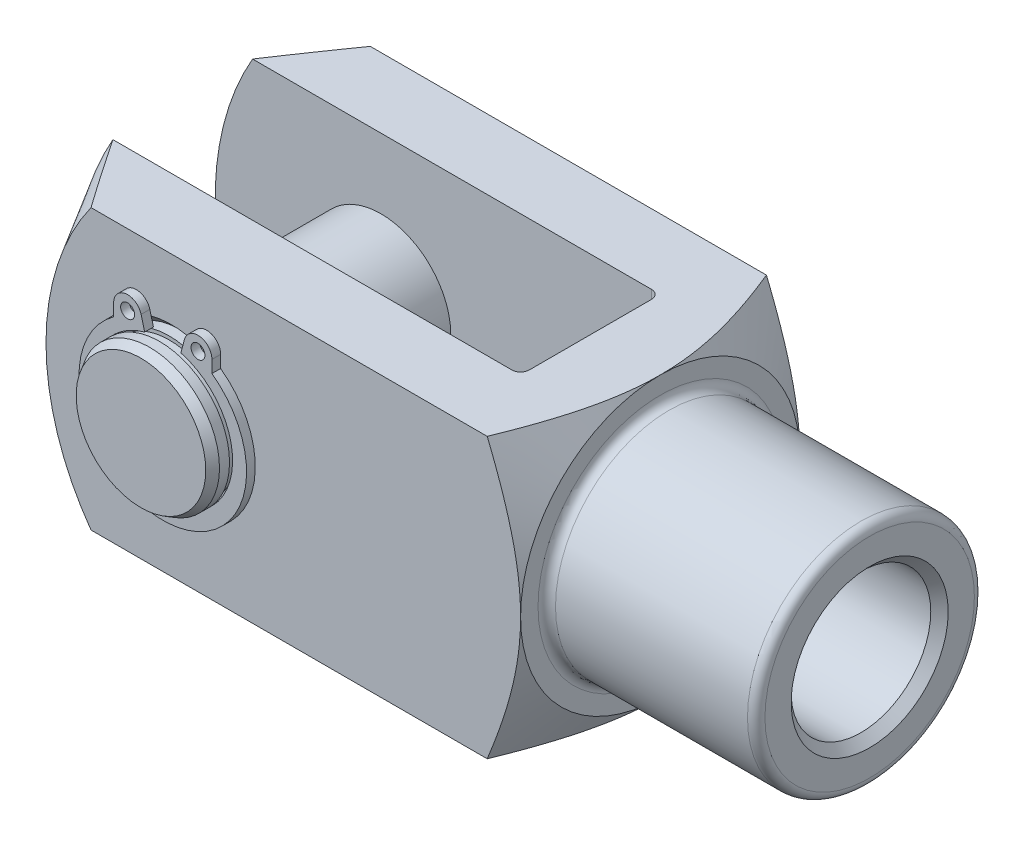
ISO-10303-21;
HEADER;
FILE_DESCRIPTION(('STEP AP214'),'2;1');
FILE_NAME('part.step','',(''),(''),'','','');
FILE_SCHEMA(('AUTOMOTIVE_DESIGN { 1 0 10303 214 1 1 1 1 }'));
ENDSEC;
DATA;
#1=APPLICATION_CONTEXT('core data for automotive mechanical design processes');
#2=APPLICATION_PROTOCOL_DEFINITION('international standard','automotive_design',2000,#1);
#3=PRODUCT_CONTEXT('',#1,'mechanical');
#4=PRODUCT('Part','Part','',(#3));
#5=PRODUCT_RELATED_PRODUCT_CATEGORY('part','',(#4));
#6=PRODUCT_DEFINITION_FORMATION('','',#4);
#7=PRODUCT_DEFINITION_CONTEXT('part definition',#1,'design');
#8=PRODUCT_DEFINITION('design','',#6,#7);
#9=PRODUCT_DEFINITION_SHAPE('','',#8);
#10=(LENGTH_UNIT() NAMED_UNIT(*) SI_UNIT(.MILLI.,.METRE.));
#11=(NAMED_UNIT(*) PLANE_ANGLE_UNIT() SI_UNIT($,.RADIAN.));
#12=(NAMED_UNIT(*) SI_UNIT($,.STERADIAN.) SOLID_ANGLE_UNIT());
#13=UNCERTAINTY_MEASURE_WITH_UNIT(LENGTH_MEASURE(1.E-05),#10,'distance_accuracy_value','');
#14=(GEOMETRIC_REPRESENTATION_CONTEXT(3) GLOBAL_UNCERTAINTY_ASSIGNED_CONTEXT((#13)) GLOBAL_UNIT_ASSIGNED_CONTEXT((#10,
#11,#12)) REPRESENTATION_CONTEXT('',''));
#15=CARTESIAN_POINT('',(0.,0.,0.));
#16=DIRECTION('',(0.,0.,1.));
#17=DIRECTION('',(1.,0.,0.));
#18=AXIS2_PLACEMENT_3D('',#15,#16,#17);
#19=CARTESIAN_POINT('',(-64.,0.,19.5));
#20=DIRECTION('',(0.,0.,-1.));
#21=DIRECTION('',(-1.,0.,0.));
#22=AXIS2_PLACEMENT_3D('',#19,#20,#21);
#23=CYLINDRICAL_SURFACE('',#22,8.);
#24=CARTESIAN_POINT('',(-64.,0.,16.25));
#25=DIRECTION('',(0.,0.,1.));
#26=DIRECTION('',(1.,0.,0.));
#27=AXIS2_PLACEMENT_3D('',#24,#25,#26);
#28=CIRCLE('',#27,8.);
#29=CARTESIAN_POINT('',(-56.,0.,16.25));
#30=VERTEX_POINT('',#29);
#31=EDGE_CURVE('P0_E55',#30,#30,#28,.T.);
#32=ORIENTED_EDGE('',*,*,#31,.F.);
#33=EDGE_LOOP('',(#32));
#34=FACE_BOUND('',#33,.T.);
#35=CARTESIAN_POINT('',(-64.,0.,-16.25));
#36=DIRECTION('',(0.,0.,1.));
#37=DIRECTION('',(1.,0.,0.));
#38=AXIS2_PLACEMENT_3D('',#35,#36,#37);
#39=CIRCLE('',#38,8.);
#40=CARTESIAN_POINT('',(-56.,0.,-16.25));
#41=VERTEX_POINT('',#40);
#42=EDGE_CURVE('P0_E40',#41,#41,#39,.T.);
#43=ORIENTED_EDGE('',*,*,#42,.T.);
#44=EDGE_LOOP('',(#43));
#45=FACE_BOUND('',#44,.T.);
#46=ADVANCED_FACE('P0_F14',(#34,#45),#23,.T.);
#47=CARTESIAN_POINT('',(-64.,0.,-17.35));
#48=DIRECTION('',(0.,0.,1.));
#49=DIRECTION('',(1.,0.,0.));
#50=AXIS2_PLACEMENT_3D('',#47,#48,#49);
#51=CIRCLE('',#50,8.);
#52=CARTESIAN_POINT('',(-56.,0.,-17.35));
#53=VERTEX_POINT('',#52);
#54=EDGE_CURVE('P0_E43',#53,#53,#51,.T.);
#55=ORIENTED_EDGE('',*,*,#54,.F.);
#56=EDGE_LOOP('',(#55));
#57=FACE_BOUND('',#56,.T.);
#58=CARTESIAN_POINT('',(-64.,0.,-18.5));
#59=DIRECTION('',(0.,0.,1.));
#60=DIRECTION('',(1.,0.,0.));
#61=AXIS2_PLACEMENT_3D('',#58,#59,#60);
#62=CIRCLE('',#61,8.);
#63=CARTESIAN_POINT('',(-56.,0.,-18.5));
#64=VERTEX_POINT('',#63);
#65=EDGE_CURVE('P0_E25',#64,#64,#62,.T.);
#66=ORIENTED_EDGE('',*,*,#65,.T.);
#67=EDGE_LOOP('',(#66));
#68=FACE_BOUND('',#67,.T.);
#69=ADVANCED_FACE('P0_F63',(#57,#68),#23,.T.);
#70=CARTESIAN_POINT('',(-64.,0.,-19.5));
#71=DIRECTION('',(0.,0.,1.));
#72=DIRECTION('',(1.,0.,0.));
#73=AXIS2_PLACEMENT_3D('',#70,#71,#72);
#74=PLANE('',#73);
#75=CARTESIAN_POINT('',(-64.,0.,-19.5));
#76=DIRECTION('',(0.,0.,1.));
#77=DIRECTION('',(1.,0.,0.));
#78=AXIS2_PLACEMENT_3D('',#75,#76,#77);
#79=CIRCLE('',#78,7.42264973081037);
#80=CARTESIAN_POINT('',(-56.5773502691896,0.,-19.5));
#81=VERTEX_POINT('',#80);
#82=EDGE_CURVE('P0_E21',#81,#81,#79,.F.);
#83=ORIENTED_EDGE('',*,*,#82,.T.);
#84=EDGE_LOOP('',(#83));
#85=FACE_BOUND('',#84,.T.);
#86=ADVANCED_FACE('P0_F89',(#85),#74,.F.);
#87=CARTESIAN_POINT('',(-64.,0.,-18.5));
#88=DIRECTION('',(0.,0.,1.));
#89=DIRECTION('',(1.,0.,0.));
#90=AXIS2_PLACEMENT_3D('',#87,#88,#89);
#91=CONICAL_SURFACE('',#90,8.,0.523598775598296);
#92=ORIENTED_EDGE('',*,*,#82,.F.);
#93=EDGE_LOOP('',(#92));
#94=FACE_BOUND('',#93,.T.);
#95=ORIENTED_EDGE('',*,*,#65,.F.);
#96=EDGE_LOOP('',(#95));
#97=FACE_BOUND('',#96,.T.);
#98=ADVANCED_FACE('P0_F83',(#94,#97),#91,.T.);
#99=CARTESIAN_POINT('',(-64.,8.,-17.35));
#100=DIRECTION('',(0.,0.,-1.));
#101=DIRECTION('',(-1.,0.,0.));
#102=AXIS2_PLACEMENT_3D('',#99,#100,#101);
#103=PLANE('',#102);
#104=CARTESIAN_POINT('',(-64.,0.,-17.35));
#105=DIRECTION('',(0.,0.,1.));
#106=DIRECTION('',(1.,0.,0.));
#107=AXIS2_PLACEMENT_3D('',#104,#105,#106);
#108=CIRCLE('',#107,7.6);
#109=CARTESIAN_POINT('',(-56.4,0.,-17.35));
#110=VERTEX_POINT('',#109);
#111=EDGE_CURVE('P0_E34',#110,#110,#108,.T.);
#112=ORIENTED_EDGE('',*,*,#111,.F.);
#113=EDGE_LOOP('',(#112));
#114=FACE_BOUND('',#113,.T.);
#115=ORIENTED_EDGE('',*,*,#54,.T.);
#116=EDGE_LOOP('',(#115));
#117=FACE_BOUND('',#116,.T.);
#118=ADVANCED_FACE('P0_F77',(#114,#117),#103,.F.);
#119=CARTESIAN_POINT('',(-64.,0.,18.5));
#120=DIRECTION('',(0.,0.,1.));
#121=DIRECTION('',(1.,0.,0.));
#122=AXIS2_PLACEMENT_3D('',#119,#120,#121);
#123=CYLINDRICAL_SURFACE('',#122,7.6);
#124=CARTESIAN_POINT('',(-64.,0.,-16.25));
#125=DIRECTION('',(0.,0.,1.));
#126=DIRECTION('',(1.,0.,0.));
#127=AXIS2_PLACEMENT_3D('',#124,#125,#126);
#128=CIRCLE('',#127,7.6);
#129=CARTESIAN_POINT('',(-56.4,0.,-16.25));
#130=VERTEX_POINT('',#129);
#131=EDGE_CURVE('P0_E37',#130,#130,#128,.T.);
#132=ORIENTED_EDGE('',*,*,#131,.F.);
#133=EDGE_LOOP('',(#132));
#134=FACE_BOUND('',#133,.T.);
#135=ORIENTED_EDGE('',*,*,#111,.T.);
#136=EDGE_LOOP('',(#135));
#137=FACE_BOUND('',#136,.T.);
#138=ADVANCED_FACE('P0_F71',(#134,#137),#123,.T.);
#139=CARTESIAN_POINT('',(-64.,8.,-16.25));
#140=DIRECTION('',(0.,0.,1.));
#141=DIRECTION('',(1.,0.,0.));
#142=AXIS2_PLACEMENT_3D('',#139,#140,#141);
#143=PLANE('',#142);
#144=ORIENTED_EDGE('',*,*,#42,.F.);
#145=EDGE_LOOP('',(#144));
#146=FACE_BOUND('',#145,.T.);
#147=ORIENTED_EDGE('',*,*,#131,.T.);
#148=EDGE_LOOP('',(#147));
#149=FACE_BOUND('',#148,.T.);
#150=ADVANCED_FACE('P0_F68',(#146,#149),#143,.F.);
#151=CARTESIAN_POINT('',(-64.,8.,16.25));
#152=DIRECTION('',(0.,0.,-1.));
#153=DIRECTION('',(-1.,0.,0.));
#154=AXIS2_PLACEMENT_3D('',#151,#152,#153);
#155=PLANE('',#154);
#156=CARTESIAN_POINT('',(-64.,0.,16.25));
#157=DIRECTION('',(0.,0.,1.));
#158=DIRECTION('',(1.,0.,0.));
#159=AXIS2_PLACEMENT_3D('',#156,#157,#158);
#160=CIRCLE('',#159,7.6);
#161=CARTESIAN_POINT('',(-56.4,0.,16.25));
#162=VERTEX_POINT('',#161);
#163=EDGE_CURVE('P0_E46',#162,#162,#160,.T.);
#164=ORIENTED_EDGE('',*,*,#163,.F.);
#165=EDGE_LOOP('',(#164));
#166=FACE_BOUND('',#165,.T.);
#167=ORIENTED_EDGE('',*,*,#31,.T.);
#168=EDGE_LOOP('',(#167));
#169=FACE_BOUND('',#168,.T.);
#170=ADVANCED_FACE('P0_F59',(#166,#169),#155,.F.);
#171=CARTESIAN_POINT('',(-64.,0.,18.5));
#172=DIRECTION('',(0.,0.,1.));
#173=DIRECTION('',(1.,0.,0.));
#174=AXIS2_PLACEMENT_3D('',#171,#172,#173);
#175=CYLINDRICAL_SURFACE('',#174,7.6);
#176=CARTESIAN_POINT('',(-64.,0.,17.35));
#177=DIRECTION('',(0.,0.,1.));
#178=DIRECTION('',(1.,0.,0.));
#179=AXIS2_PLACEMENT_3D('',#176,#177,#178);
#180=CIRCLE('',#179,7.6);
#181=CARTESIAN_POINT('',(-56.4,0.,17.35));
#182=VERTEX_POINT('',#181);
#183=EDGE_CURVE('P0_E49',#182,#182,#180,.T.);
#184=ORIENTED_EDGE('',*,*,#183,.F.);
#185=EDGE_LOOP('',(#184));
#186=FACE_BOUND('',#185,.T.);
#187=ORIENTED_EDGE('',*,*,#163,.T.);
#188=EDGE_LOOP('',(#187));
#189=FACE_BOUND('',#188,.T.);
#190=ADVANCED_FACE('P0_F108',(#186,#189),#175,.T.);
#191=CARTESIAN_POINT('',(-64.,8.,17.35));
#192=DIRECTION('',(0.,0.,1.));
#193=DIRECTION('',(1.,0.,0.));
#194=AXIS2_PLACEMENT_3D('',#191,#192,#193);
#195=PLANE('',#194);
#196=CARTESIAN_POINT('',(-64.,0.,17.35));
#197=DIRECTION('',(0.,0.,1.));
#198=DIRECTION('',(1.,0.,0.));
#199=AXIS2_PLACEMENT_3D('',#196,#197,#198);
#200=CIRCLE('',#199,8.);
#201=CARTESIAN_POINT('',(-56.,0.,17.35));
#202=VERTEX_POINT('',#201);
#203=EDGE_CURVE('P0_E52',#202,#202,#200,.T.);
#204=ORIENTED_EDGE('',*,*,#203,.F.);
#205=EDGE_LOOP('',(#204));
#206=FACE_BOUND('',#205,.T.);
#207=ORIENTED_EDGE('',*,*,#183,.T.);
#208=EDGE_LOOP('',(#207));
#209=FACE_BOUND('',#208,.T.);
#210=ADVANCED_FACE('P0_F104',(#206,#209),#195,.F.);
#211=CARTESIAN_POINT('',(-64.,0.,19.5));
#212=DIRECTION('',(0.,0.,1.));
#213=DIRECTION('',(1.,0.,0.));
#214=AXIS2_PLACEMENT_3D('',#211,#212,#213);
#215=PLANE('',#214);
#216=CARTESIAN_POINT('',(-64.,0.,19.5));
#217=DIRECTION('',(0.,0.,1.));
#218=DIRECTION('',(1.,0.,0.));
#219=AXIS2_PLACEMENT_3D('',#216,#217,#218);
#220=CIRCLE('',#219,7.42264973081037);
#221=CARTESIAN_POINT('',(-56.5773502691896,0.,19.5));
#222=VERTEX_POINT('',#221);
#223=EDGE_CURVE('P0_E10',#222,#222,#220,.T.);
#224=ORIENTED_EDGE('',*,*,#223,.T.);
#225=EDGE_LOOP('',(#224));
#226=FACE_BOUND('',#225,.T.);
#227=ADVANCED_FACE('P0_F102',(#226),#215,.T.);
#228=CARTESIAN_POINT('',(-64.,0.,19.5));
#229=DIRECTION('',(0.,0.,-1.));
#230=DIRECTION('',(-1.,0.,0.));
#231=AXIS2_PLACEMENT_3D('',#228,#229,#230);
#232=CONICAL_SURFACE('',#231,7.42264973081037,0.523598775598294);
#233=CARTESIAN_POINT('',(-64.,0.,18.5));
#234=DIRECTION('',(0.,0.,1.));
#235=DIRECTION('',(1.,0.,0.));
#236=AXIS2_PLACEMENT_3D('',#233,#234,#235);
#237=CIRCLE('',#236,8.);
#238=CARTESIAN_POINT('',(-56.,0.,18.5));
#239=VERTEX_POINT('',#238);
#240=EDGE_CURVE('P0_E29',#239,#239,#237,.F.);
#241=ORIENTED_EDGE('',*,*,#240,.F.);
#242=EDGE_LOOP('',(#241));
#243=FACE_BOUND('',#242,.T.);
#244=ORIENTED_EDGE('',*,*,#223,.F.);
#245=EDGE_LOOP('',(#244));
#246=FACE_BOUND('',#245,.T.);
#247=ADVANCED_FACE('P0_F16',(#243,#246),#232,.T.);
#248=ORIENTED_EDGE('',*,*,#203,.T.);
#249=EDGE_LOOP('',(#248));
#250=FACE_BOUND('',#249,.T.);
#251=ORIENTED_EDGE('',*,*,#240,.T.);
#252=EDGE_LOOP('',(#251));
#253=FACE_BOUND('',#252,.T.);
#254=ADVANCED_FACE('P0_F65',(#250,#253),#23,.T.);
#255=CLOSED_SHELL('',(#46,#69,#86,#98,#118,#138,#150,#170,#190,#210,#227,#247,#254));
#256=MANIFOLD_SOLID_BREP('P0_B1',#255);
#257=CARTESIAN_POINT('',(-64.,0.,16.9999999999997));
#258=DIRECTION('',(0.,0.,1.));
#259=DIRECTION('',(1.,0.,0.));
#260=AXIS2_PLACEMENT_3D('',#257,#258,#259);
#261=PLANE('',#260);
#262=CARTESIAN_POINT('',(-68.0301441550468,8.85877746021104,16.9999999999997));
#263=DIRECTION('',(0.,0.,1.));
#264=DIRECTION('',(1.,0.,0.));
#265=AXIS2_PLACEMENT_3D('',#262,#263,#264);
#266=CIRCLE('',#265,0.8);
#267=CARTESIAN_POINT('',(-67.2301441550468,8.85877746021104,16.9999999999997));
#268=VERTEX_POINT('',#267);
#269=EDGE_CURVE('P1_E117',#268,#268,#266,.T.);
#270=ORIENTED_EDGE('',*,*,#269,.F.);
#271=EDGE_LOOP('',(#270));
#272=FACE_BOUND('',#271,.T.);
#273=CARTESIAN_POINT('',(-64.,0.,16.9999999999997));
#274=DIRECTION('',(0.,0.,-1.));
#275=DIRECTION('',(1.,0.,0.));
#276=AXIS2_PLACEMENT_3D('',#273,#274,#275);
#277=CIRCLE('',#276,8.);
#278=CARTESIAN_POINT('',(-61.9294476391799,7.72740661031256,16.9999999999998));
#279=VERTEX_POINT('',#278);
#280=CARTESIAN_POINT('',(-66.0705523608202,7.72740661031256,16.9999999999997));
#281=VERTEX_POINT('',#280);
#282=EDGE_CURVE('P1_E128',#279,#281,#277,.T.);
#283=ORIENTED_EDGE('',*,*,#282,.T.);
#284=DIRECTION('',(-0.258819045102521,0.965925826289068,0.));
#285=VECTOR('',#284,1.);
#286=CARTESIAN_POINT('',(-66.0705523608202,7.72740661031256,16.9999999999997));
#287=LINE('',#286,#285);
#288=CARTESIAN_POINT('',(-66.4846628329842,9.27288793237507,16.9999999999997));
#289=VERTEX_POINT('',#288);
#290=EDGE_CURVE('P1_E76',#281,#289,#287,.T.);
#291=ORIENTED_EDGE('',*,*,#290,.T.);
#292=CARTESIAN_POINT('',(-68.0301441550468,8.85877746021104,16.9999999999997));
#293=DIRECTION('',(0.,0.,1.));
#294=DIRECTION('',(1.,0.,0.));
#295=AXIS2_PLACEMENT_3D('',#292,#293,#294);
#296=CIRCLE('',#295,1.6);
#297=CARTESIAN_POINT('',(-69.6301441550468,8.85877746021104,16.9999999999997));
#298=VERTEX_POINT('',#297);
#299=EDGE_CURVE('P1_E143',#289,#298,#296,.T.);
#300=ORIENTED_EDGE('',*,*,#299,.T.);
#301=DIRECTION('',(0.,-1.,0.));
#302=VECTOR('',#301,1.);
#303=CARTESIAN_POINT('',(-69.6301441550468,8.85877746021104,16.9999999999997));
#304=LINE('',#303,#302);
#305=CARTESIAN_POINT('',(-69.6301441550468,7.45569783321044,16.9999999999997));
#306=VERTEX_POINT('',#305);
#307=EDGE_CURVE('P1_E156',#298,#306,#304,.T.);
#308=ORIENTED_EDGE('',*,*,#307,.T.);
#309=CARTESIAN_POINT('',(-64.,-0.319999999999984,16.9999999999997));
#310=DIRECTION('',(0.,0.,1.));
#311=DIRECTION('',(1.,0.,0.));
#312=AXIS2_PLACEMENT_3D('',#309,#310,#311);
#313=CIRCLE('',#312,9.6);
#314=CARTESIAN_POINT('',(-58.3698558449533,7.45569783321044,16.9999999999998));
#315=VERTEX_POINT('',#314);
#316=EDGE_CURVE('P1_E95',#306,#315,#313,.T.);
#317=ORIENTED_EDGE('',*,*,#316,.T.);
#318=DIRECTION('',(0.,1.,0.));
#319=VECTOR('',#318,1.);
#320=CARTESIAN_POINT('',(-58.3698558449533,8.85877746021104,16.9999999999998));
#321=LINE('',#320,#319);
#322=CARTESIAN_POINT('',(-58.3698558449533,8.85877746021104,16.9999999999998));
#323=VERTEX_POINT('',#322);
#324=EDGE_CURVE('P1_E89',#315,#323,#321,.T.);
#325=ORIENTED_EDGE('',*,*,#324,.T.);
#326=CARTESIAN_POINT('',(-59.9698558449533,8.85877746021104,16.9999999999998));
#327=DIRECTION('',(0.,0.,1.));
#328=DIRECTION('',(-1.,0.,0.));
#329=AXIS2_PLACEMENT_3D('',#326,#327,#328);
#330=CIRCLE('',#329,1.6);
#331=CARTESIAN_POINT('',(-61.5153371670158,9.27288793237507,16.9999999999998));
#332=VERTEX_POINT('',#331);
#333=EDGE_CURVE('P1_E93',#323,#332,#330,.T.);
#334=ORIENTED_EDGE('',*,*,#333,.T.);
#335=DIRECTION('',(-0.258819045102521,-0.965925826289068,0.));
#336=VECTOR('',#335,1.);
#337=CARTESIAN_POINT('',(-61.9294476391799,7.72740661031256,16.9999999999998));
#338=LINE('',#337,#336);
#339=EDGE_CURVE('P1_E33',#332,#279,#338,.T.);
#340=ORIENTED_EDGE('',*,*,#339,.T.);
#341=EDGE_LOOP('',(#283,#291,#300,#308,#317,#325,#334,#340));
#342=FACE_BOUND('',#341,.T.);
#343=CARTESIAN_POINT('',(-59.9698558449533,8.85877746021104,16.9999999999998));
#344=DIRECTION('',(0.,0.,1.));
#345=DIRECTION('',(-1.,0.,0.));
#346=AXIS2_PLACEMENT_3D('',#343,#344,#345);
#347=CIRCLE('',#346,0.8);
#348=CARTESIAN_POINT('',(-60.7698558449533,8.85877746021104,16.9999999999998));
#349=VERTEX_POINT('',#348);
#350=EDGE_CURVE('P1_E165',#349,#349,#347,.T.);
#351=ORIENTED_EDGE('',*,*,#350,.F.);
#352=EDGE_LOOP('',(#351));
#353=FACE_BOUND('',#352,.T.);
#354=ADVANCED_FACE('P1_F16',(#272,#342,#353),#261,.T.);
#355=CARTESIAN_POINT('',(-64.,0.,15.9999999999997));
#356=DIRECTION('',(0.,0.,1.));
#357=DIRECTION('',(1.,0.,0.));
#358=AXIS2_PLACEMENT_3D('',#355,#356,#357);
#359=PLANE('',#358);
#360=CARTESIAN_POINT('',(-68.0301441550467,8.85877746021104,15.9999999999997));
#361=DIRECTION('',(0.,0.,1.));
#362=DIRECTION('',(1.,0.,0.));
#363=AXIS2_PLACEMENT_3D('',#360,#361,#362);
#364=CIRCLE('',#363,0.8);
#365=CARTESIAN_POINT('',(-67.2301441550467,8.85877746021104,15.9999999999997));
#366=VERTEX_POINT('',#365);
#367=EDGE_CURVE('P1_E162',#366,#366,#364,.T.);
#368=ORIENTED_EDGE('',*,*,#367,.T.);
#369=EDGE_LOOP('',(#368));
#370=FACE_BOUND('',#369,.T.);
#371=CARTESIAN_POINT('',(-64.,0.,15.9999999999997));
#372=DIRECTION('',(0.,0.,-1.));
#373=DIRECTION('',(1.,0.,0.));
#374=AXIS2_PLACEMENT_3D('',#371,#372,#373);
#375=CIRCLE('',#374,8.);
#376=CARTESIAN_POINT('',(-61.9294476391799,7.72740661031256,15.9999999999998));
#377=VERTEX_POINT('',#376);
#378=CARTESIAN_POINT('',(-66.0705523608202,7.72740661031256,15.9999999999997));
#379=VERTEX_POINT('',#378);
#380=EDGE_CURVE('P1_E113',#377,#379,#375,.T.);
#381=ORIENTED_EDGE('',*,*,#380,.F.);
#382=DIRECTION('',(-0.258819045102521,-0.965925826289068,0.));
#383=VECTOR('',#382,1.);
#384=CARTESIAN_POINT('',(-61.9294476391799,7.72740661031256,15.9999999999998));
#385=LINE('',#384,#383);
#386=CARTESIAN_POINT('',(-61.5153371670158,9.27288793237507,15.9999999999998));
#387=VERTEX_POINT('',#386);
#388=EDGE_CURVE('P1_E68',#387,#377,#385,.T.);
#389=ORIENTED_EDGE('',*,*,#388,.F.);
#390=CARTESIAN_POINT('',(-59.9698558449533,8.85877746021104,15.9999999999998));
#391=DIRECTION('',(0.,0.,1.));
#392=DIRECTION('',(-1.,0.,0.));
#393=AXIS2_PLACEMENT_3D('',#390,#391,#392);
#394=CIRCLE('',#393,1.6);
#395=CARTESIAN_POINT('',(-58.3698558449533,8.85877746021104,15.9999999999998));
#396=VERTEX_POINT('',#395);
#397=EDGE_CURVE('P1_E62',#396,#387,#394,.T.);
#398=ORIENTED_EDGE('',*,*,#397,.F.);
#399=DIRECTION('',(0.,1.,0.));
#400=VECTOR('',#399,1.);
#401=CARTESIAN_POINT('',(-58.3698558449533,8.85877746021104,15.9999999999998));
#402=LINE('',#401,#400);
#403=CARTESIAN_POINT('',(-58.3698558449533,7.45569783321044,15.9999999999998));
#404=VERTEX_POINT('',#403);
#405=EDGE_CURVE('P1_E103',#404,#396,#402,.T.);
#406=ORIENTED_EDGE('',*,*,#405,.F.);
#407=CARTESIAN_POINT('',(-64.,-0.319999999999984,15.9999999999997));
#408=DIRECTION('',(0.,0.,1.));
#409=DIRECTION('',(1.,0.,0.));
#410=AXIS2_PLACEMENT_3D('',#407,#408,#409);
#411=CIRCLE('',#410,9.6);
#412=CARTESIAN_POINT('',(-69.6301441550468,7.45569783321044,15.9999999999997));
#413=VERTEX_POINT('',#412);
#414=EDGE_CURVE('P1_E123',#413,#404,#411,.T.);
#415=ORIENTED_EDGE('',*,*,#414,.F.);
#416=DIRECTION('',(0.,-1.,0.));
#417=VECTOR('',#416,1.);
#418=CARTESIAN_POINT('',(-69.6301441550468,8.85877746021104,15.9999999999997));
#419=LINE('',#418,#417);
#420=CARTESIAN_POINT('',(-69.6301441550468,8.85877746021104,15.9999999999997));
#421=VERTEX_POINT('',#420);
#422=EDGE_CURVE('P1_E121',#421,#413,#419,.T.);
#423=ORIENTED_EDGE('',*,*,#422,.F.);
#424=CARTESIAN_POINT('',(-68.0301441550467,8.85877746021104,15.9999999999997));
#425=DIRECTION('',(0.,0.,1.));
#426=DIRECTION('',(1.,0.,0.));
#427=AXIS2_PLACEMENT_3D('',#424,#425,#426);
#428=CIRCLE('',#427,1.6);
#429=CARTESIAN_POINT('',(-66.4846628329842,9.27288793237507,15.9999999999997));
#430=VERTEX_POINT('',#429);
#431=EDGE_CURVE('P1_E119',#430,#421,#428,.T.);
#432=ORIENTED_EDGE('',*,*,#431,.F.);
#433=DIRECTION('',(-0.258819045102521,0.965925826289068,0.));
#434=VECTOR('',#433,1.);
#435=CARTESIAN_POINT('',(-66.0705523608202,7.72740661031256,15.9999999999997));
#436=LINE('',#435,#434);
#437=EDGE_CURVE('P1_E116',#379,#430,#436,.T.);
#438=ORIENTED_EDGE('',*,*,#437,.F.);
#439=EDGE_LOOP('',(#381,#389,#398,#406,#415,#423,#432,#438));
#440=FACE_BOUND('',#439,.T.);
#441=CARTESIAN_POINT('',(-59.9698558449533,8.85877746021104,15.9999999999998));
#442=DIRECTION('',(0.,0.,1.));
#443=DIRECTION('',(-1.,0.,0.));
#444=AXIS2_PLACEMENT_3D('',#441,#442,#443);
#445=CIRCLE('',#444,0.8);
#446=CARTESIAN_POINT('',(-60.7698558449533,8.85877746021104,15.9999999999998));
#447=VERTEX_POINT('',#446);
#448=EDGE_CURVE('P1_E168',#447,#447,#445,.T.);
#449=ORIENTED_EDGE('',*,*,#448,.T.);
#450=EDGE_LOOP('',(#449));
#451=FACE_BOUND('',#450,.T.);
#452=ADVANCED_FACE('P1_F147',(#370,#440,#451),#359,.F.);
#453=CARTESIAN_POINT('',(-64.,0.,16.9999999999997));
#454=DIRECTION('',(0.,0.,-1.));
#455=DIRECTION('',(-1.,0.,0.));
#456=AXIS2_PLACEMENT_3D('',#453,#454,#455);
#457=CYLINDRICAL_SURFACE('',#456,8.);
#458=ORIENTED_EDGE('',*,*,#380,.T.);
#459=DIRECTION('',(0.,0.,-1.));
#460=VECTOR('',#459,1.);
#461=CARTESIAN_POINT('',(-66.0705523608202,7.72740661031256,16.9999999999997));
#462=LINE('',#461,#460);
#463=EDGE_CURVE('P1_E11',#281,#379,#462,.T.);
#464=ORIENTED_EDGE('',*,*,#463,.F.);
#465=ORIENTED_EDGE('',*,*,#282,.F.);
#466=DIRECTION('',(0.,0.,-1.));
#467=VECTOR('',#466,1.);
#468=CARTESIAN_POINT('',(-61.9294476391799,7.72740661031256,16.9999999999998));
#469=LINE('',#468,#467);
#470=EDGE_CURVE('P1_E109',#279,#377,#469,.T.);
#471=ORIENTED_EDGE('',*,*,#470,.T.);
#472=EDGE_LOOP('',(#458,#464,#465,#471));
#473=FACE_BOUND('',#472,.T.);
#474=ADVANCED_FACE('P1_F18',(#473),#457,.F.);
#475=CARTESIAN_POINT('',(-66.0705523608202,7.72740661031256,16.9999999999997));
#476=DIRECTION('',(-0.965925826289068,-0.258819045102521,0.));
#477=DIRECTION('',(0.258819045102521,-0.965925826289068,0.));
#478=AXIS2_PLACEMENT_3D('',#475,#476,#477);
#479=PLANE('',#478);
#480=ORIENTED_EDGE('',*,*,#437,.T.);
#481=DIRECTION('',(0.,0.,-1.));
#482=VECTOR('',#481,1.);
#483=CARTESIAN_POINT('',(-66.4846628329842,9.27288793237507,16.9999999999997));
#484=LINE('',#483,#482);
#485=EDGE_CURVE('P1_E25',#289,#430,#484,.T.);
#486=ORIENTED_EDGE('',*,*,#485,.F.);
#487=ORIENTED_EDGE('',*,*,#290,.F.);
#488=ORIENTED_EDGE('',*,*,#463,.T.);
#489=EDGE_LOOP('',(#480,#486,#487,#488));
#490=FACE_BOUND('',#489,.T.);
#491=ADVANCED_FACE('P1_F202',(#490),#479,.F.);
#492=CARTESIAN_POINT('',(-68.0301441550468,8.85877746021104,16.9999999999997));
#493=DIRECTION('',(0.,0.,-1.));
#494=DIRECTION('',(-1.,0.,0.));
#495=AXIS2_PLACEMENT_3D('',#492,#493,#494);
#496=CYLINDRICAL_SURFACE('',#495,1.6);
#497=ORIENTED_EDGE('',*,*,#431,.T.);
#498=DIRECTION('',(0.,0.,-1.));
#499=VECTOR('',#498,1.);
#500=CARTESIAN_POINT('',(-69.6301441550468,8.85877746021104,16.9999999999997));
#501=LINE('',#500,#499);
#502=EDGE_CURVE('P1_E135',#298,#421,#501,.T.);
#503=ORIENTED_EDGE('',*,*,#502,.F.);
#504=ORIENTED_EDGE('',*,*,#299,.F.);
#505=ORIENTED_EDGE('',*,*,#485,.T.);
#506=EDGE_LOOP('',(#497,#503,#504,#505));
#507=FACE_BOUND('',#506,.T.);
#508=ADVANCED_FACE('P1_F141',(#507),#496,.T.);
#509=CARTESIAN_POINT('',(-69.6301441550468,8.85877746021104,16.9999999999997));
#510=DIRECTION('',(1.,0.,0.));
#511=DIRECTION('',(0.,1.,0.));
#512=AXIS2_PLACEMENT_3D('',#509,#510,#511);
#513=PLANE('',#512);
#514=ORIENTED_EDGE('',*,*,#422,.T.);
#515=DIRECTION('',(0.,0.,-1.));
#516=VECTOR('',#515,1.);
#517=CARTESIAN_POINT('',(-69.6301441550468,7.45569783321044,16.9999999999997));
#518=LINE('',#517,#516);
#519=EDGE_CURVE('P1_E132',#306,#413,#518,.T.);
#520=ORIENTED_EDGE('',*,*,#519,.F.);
#521=ORIENTED_EDGE('',*,*,#307,.F.);
#522=ORIENTED_EDGE('',*,*,#502,.T.);
#523=EDGE_LOOP('',(#514,#520,#521,#522));
#524=FACE_BOUND('',#523,.T.);
#525=ADVANCED_FACE('P1_F152',(#524),#513,.F.);
#526=CARTESIAN_POINT('',(-64.,-0.319999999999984,16.9999999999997));
#527=DIRECTION('',(0.,0.,-1.));
#528=DIRECTION('',(-1.,0.,0.));
#529=AXIS2_PLACEMENT_3D('',#526,#527,#528);
#530=CYLINDRICAL_SURFACE('',#529,9.6);
#531=ORIENTED_EDGE('',*,*,#414,.T.);
#532=DIRECTION('',(0.,0.,-1.));
#533=VECTOR('',#532,1.);
#534=CARTESIAN_POINT('',(-58.3698558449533,7.45569783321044,16.9999999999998));
#535=LINE('',#534,#533);
#536=EDGE_CURVE('P1_E104',#315,#404,#535,.T.);
#537=ORIENTED_EDGE('',*,*,#536,.F.);
#538=ORIENTED_EDGE('',*,*,#316,.F.);
#539=ORIENTED_EDGE('',*,*,#519,.T.);
#540=EDGE_LOOP('',(#531,#537,#538,#539));
#541=FACE_BOUND('',#540,.T.);
#542=ADVANCED_FACE('P1_F155',(#541),#530,.T.);
#543=CARTESIAN_POINT('',(-58.3698558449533,8.85877746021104,16.9999999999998));
#544=DIRECTION('',(-1.,0.,0.));
#545=DIRECTION('',(0.,-1.,0.));
#546=AXIS2_PLACEMENT_3D('',#543,#544,#545);
#547=PLANE('',#546);
#548=ORIENTED_EDGE('',*,*,#405,.T.);
#549=DIRECTION('',(0.,0.,-1.));
#550=VECTOR('',#549,1.);
#551=CARTESIAN_POINT('',(-58.3698558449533,8.85877746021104,16.9999999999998));
#552=LINE('',#551,#550);
#553=EDGE_CURVE('P1_E100',#323,#396,#552,.T.);
#554=ORIENTED_EDGE('',*,*,#553,.F.);
#555=ORIENTED_EDGE('',*,*,#324,.F.);
#556=ORIENTED_EDGE('',*,*,#536,.T.);
#557=EDGE_LOOP('',(#548,#554,#555,#556));
#558=FACE_BOUND('',#557,.T.);
#559=ADVANCED_FACE('P1_F101',(#558),#547,.F.);
#560=CARTESIAN_POINT('',(-59.9698558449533,8.85877746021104,16.9999999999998));
#561=DIRECTION('',(0.,0.,-1.));
#562=DIRECTION('',(-1.,0.,0.));
#563=AXIS2_PLACEMENT_3D('',#560,#561,#562);
#564=CYLINDRICAL_SURFACE('',#563,1.6);
#565=ORIENTED_EDGE('',*,*,#397,.T.);
#566=DIRECTION('',(0.,0.,-1.));
#567=VECTOR('',#566,1.);
#568=CARTESIAN_POINT('',(-61.5153371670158,9.27288793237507,16.9999999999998));
#569=LINE('',#568,#567);
#570=EDGE_CURVE('P1_E105',#332,#387,#569,.T.);
#571=ORIENTED_EDGE('',*,*,#570,.F.);
#572=ORIENTED_EDGE('',*,*,#333,.F.);
#573=ORIENTED_EDGE('',*,*,#553,.T.);
#574=EDGE_LOOP('',(#565,#571,#572,#573));
#575=FACE_BOUND('',#574,.T.);
#576=ADVANCED_FACE('P1_F107',(#575),#564,.T.);
#577=CARTESIAN_POINT('',(-61.9294476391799,7.72740661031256,16.9999999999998));
#578=DIRECTION('',(0.965925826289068,-0.258819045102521,0.));
#579=DIRECTION('',(0.258819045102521,0.965925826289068,0.));
#580=AXIS2_PLACEMENT_3D('',#577,#578,#579);
#581=PLANE('',#580);
#582=ORIENTED_EDGE('',*,*,#388,.T.);
#583=ORIENTED_EDGE('',*,*,#470,.F.);
#584=ORIENTED_EDGE('',*,*,#339,.F.);
#585=ORIENTED_EDGE('',*,*,#570,.T.);
#586=EDGE_LOOP('',(#582,#583,#584,#585));
#587=FACE_BOUND('',#586,.T.);
#588=ADVANCED_FACE('P1_F190',(#587),#581,.F.);
#589=CARTESIAN_POINT('',(-68.0301441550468,8.85877746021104,16.9999999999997));
#590=DIRECTION('',(0.,0.,-1.));
#591=DIRECTION('',(-1.,0.,0.));
#592=AXIS2_PLACEMENT_3D('',#589,#590,#591);
#593=CYLINDRICAL_SURFACE('',#592,0.8);
#594=ORIENTED_EDGE('',*,*,#269,.T.);
#595=EDGE_LOOP('',(#594));
#596=FACE_BOUND('',#595,.T.);
#597=ORIENTED_EDGE('',*,*,#367,.F.);
#598=EDGE_LOOP('',(#597));
#599=FACE_BOUND('',#598,.T.);
#600=ADVANCED_FACE('P1_F187',(#596,#599),#593,.F.);
#601=CARTESIAN_POINT('',(-59.9698558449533,8.85877746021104,16.9999999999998));
#602=DIRECTION('',(0.,0.,-1.));
#603=DIRECTION('',(-1.,0.,0.));
#604=AXIS2_PLACEMENT_3D('',#601,#602,#603);
#605=CYLINDRICAL_SURFACE('',#604,0.8);
#606=ORIENTED_EDGE('',*,*,#350,.T.);
#607=EDGE_LOOP('',(#606));
#608=FACE_BOUND('',#607,.T.);
#609=ORIENTED_EDGE('',*,*,#448,.F.);
#610=EDGE_LOOP('',(#609));
#611=FACE_BOUND('',#610,.T.);
#612=ADVANCED_FACE('P1_F174',(#608,#611),#605,.F.);
#613=CLOSED_SHELL('',(#354,#452,#474,#491,#508,#525,#542,#559,#576,#588,#600,#612));
#614=MANIFOLD_SOLID_BREP('P1_B1',#613);
#615=CARTESIAN_POINT('',(-64.,0.,-16.9999999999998));
#616=DIRECTION('',(0.,0.,-1.));
#617=DIRECTION('',(-1.,0.,0.));
#618=AXIS2_PLACEMENT_3D('',#615,#616,#617);
#619=PLANE('',#618);
#620=CARTESIAN_POINT('',(-59.9698558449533,8.85877746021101,-16.9999999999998));
#621=DIRECTION('',(0.,0.,-1.));
#622=DIRECTION('',(-1.,0.,0.));
#623=AXIS2_PLACEMENT_3D('',#620,#621,#622);
#624=CIRCLE('',#623,0.8);
#625=CARTESIAN_POINT('',(-60.7698558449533,8.85877746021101,-16.9999999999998));
#626=VERTEX_POINT('',#625);
#627=EDGE_CURVE('P2_E117',#626,#626,#624,.T.);
#628=ORIENTED_EDGE('',*,*,#627,.F.);
#629=EDGE_LOOP('',(#628));
#630=FACE_BOUND('',#629,.T.);
#631=CARTESIAN_POINT('',(-64.,0.,-16.9999999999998));
#632=DIRECTION('',(0.,0.,1.));
#633=DIRECTION('',(-1.,0.,0.));
#634=AXIS2_PLACEMENT_3D('',#631,#632,#633);
#635=CIRCLE('',#634,8.);
#636=CARTESIAN_POINT('',(-66.0705523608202,7.72740661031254,-16.9999999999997));
#637=VERTEX_POINT('',#636);
#638=CARTESIAN_POINT('',(-61.9294476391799,7.72740661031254,-16.9999999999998));
#639=VERTEX_POINT('',#638);
#640=EDGE_CURVE('P2_E128',#637,#639,#635,.T.);
#641=ORIENTED_EDGE('',*,*,#640,.T.);
#642=DIRECTION('',(0.258819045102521,0.965925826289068,0.));
#643=VECTOR('',#642,1.);
#644=CARTESIAN_POINT('',(-61.9294476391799,7.72740661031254,-16.9999999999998));
#645=LINE('',#644,#643);
#646=CARTESIAN_POINT('',(-61.5153371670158,9.27288793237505,-16.9999999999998));
#647=VERTEX_POINT('',#646);
#648=EDGE_CURVE('P2_E76',#639,#647,#645,.T.);
#649=ORIENTED_EDGE('',*,*,#648,.T.);
#650=CARTESIAN_POINT('',(-59.9698558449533,8.85877746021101,-16.9999999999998));
#651=DIRECTION('',(0.,0.,-1.));
#652=DIRECTION('',(-1.,0.,0.));
#653=AXIS2_PLACEMENT_3D('',#650,#651,#652);
#654=CIRCLE('',#653,1.6);
#655=CARTESIAN_POINT('',(-58.3698558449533,8.85877746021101,-16.9999999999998));
#656=VERTEX_POINT('',#655);
#657=EDGE_CURVE('P2_E143',#647,#656,#654,.T.);
#658=ORIENTED_EDGE('',*,*,#657,.T.);
#659=DIRECTION('',(0.,-1.,0.));
#660=VECTOR('',#659,1.);
#661=CARTESIAN_POINT('',(-58.3698558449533,8.85877746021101,-16.9999999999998));
#662=LINE('',#661,#660);
#663=CARTESIAN_POINT('',(-58.3698558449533,7.45569783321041,-16.9999999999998));
#664=VERTEX_POINT('',#663);
#665=EDGE_CURVE('P2_E156',#656,#664,#662,.T.);
#666=ORIENTED_EDGE('',*,*,#665,.T.);
#667=CARTESIAN_POINT('',(-64.,-0.32000000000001,-16.9999999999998));
#668=DIRECTION('',(0.,0.,-1.));
#669=DIRECTION('',(-1.,0.,0.));
#670=AXIS2_PLACEMENT_3D('',#667,#668,#669);
#671=CIRCLE('',#670,9.6);
#672=CARTESIAN_POINT('',(-69.6301441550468,7.45569783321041,-16.9999999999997));
#673=VERTEX_POINT('',#672);
#674=EDGE_CURVE('P2_E95',#664,#673,#671,.T.);
#675=ORIENTED_EDGE('',*,*,#674,.T.);
#676=DIRECTION('',(0.,1.,0.));
#677=VECTOR('',#676,1.);
#678=CARTESIAN_POINT('',(-69.6301441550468,8.85877746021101,-16.9999999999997));
#679=LINE('',#678,#677);
#680=CARTESIAN_POINT('',(-69.6301441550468,8.85877746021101,-16.9999999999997));
#681=VERTEX_POINT('',#680);
#682=EDGE_CURVE('P2_E89',#673,#681,#679,.T.);
#683=ORIENTED_EDGE('',*,*,#682,.T.);
#684=CARTESIAN_POINT('',(-68.0301441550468,8.85877746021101,-16.9999999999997));
#685=DIRECTION('',(0.,0.,-1.));
#686=DIRECTION('',(1.,0.,0.));
#687=AXIS2_PLACEMENT_3D('',#684,#685,#686);
#688=CIRCLE('',#687,1.6);
#689=CARTESIAN_POINT('',(-66.4846628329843,9.27288793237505,-16.9999999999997));
#690=VERTEX_POINT('',#689);
#691=EDGE_CURVE('P2_E93',#681,#690,#688,.T.);
#692=ORIENTED_EDGE('',*,*,#691,.T.);
#693=DIRECTION('',(0.258819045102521,-0.965925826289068,0.));
#694=VECTOR('',#693,1.);
#695=CARTESIAN_POINT('',(-66.0705523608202,7.72740661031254,-16.9999999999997));
#696=LINE('',#695,#694);
#697=EDGE_CURVE('P2_E33',#690,#637,#696,.T.);
#698=ORIENTED_EDGE('',*,*,#697,.T.);
#699=EDGE_LOOP('',(#641,#649,#658,#666,#675,#683,#692,#698));
#700=FACE_BOUND('',#699,.T.);
#701=CARTESIAN_POINT('',(-68.0301441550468,8.85877746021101,-16.9999999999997));
#702=DIRECTION('',(0.,0.,-1.));
#703=DIRECTION('',(1.,0.,0.));
#704=AXIS2_PLACEMENT_3D('',#701,#702,#703);
#705=CIRCLE('',#704,0.8);
#706=CARTESIAN_POINT('',(-67.2301441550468,8.85877746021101,-16.9999999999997));
#707=VERTEX_POINT('',#706);
#708=EDGE_CURVE('P2_E165',#707,#707,#705,.T.);
#709=ORIENTED_EDGE('',*,*,#708,.F.);
#710=EDGE_LOOP('',(#709));
#711=FACE_BOUND('',#710,.T.);
#712=ADVANCED_FACE('P2_F16',(#630,#700,#711),#619,.T.);
#713=CARTESIAN_POINT('',(-64.,0.,-15.9999999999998));
#714=DIRECTION('',(0.,0.,-1.));
#715=DIRECTION('',(-1.,0.,0.));
#716=AXIS2_PLACEMENT_3D('',#713,#714,#715);
#717=PLANE('',#716);
#718=CARTESIAN_POINT('',(-59.9698558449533,8.85877746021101,-15.9999999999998));
#719=DIRECTION('',(0.,0.,-1.));
#720=DIRECTION('',(-1.,0.,0.));
#721=AXIS2_PLACEMENT_3D('',#718,#719,#720);
#722=CIRCLE('',#721,0.8);
#723=CARTESIAN_POINT('',(-60.7698558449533,8.85877746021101,-15.9999999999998));
#724=VERTEX_POINT('',#723);
#725=EDGE_CURVE('P2_E162',#724,#724,#722,.T.);
#726=ORIENTED_EDGE('',*,*,#725,.T.);
#727=EDGE_LOOP('',(#726));
#728=FACE_BOUND('',#727,.T.);
#729=CARTESIAN_POINT('',(-64.,0.,-15.9999999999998));
#730=DIRECTION('',(0.,0.,1.));
#731=DIRECTION('',(-1.,0.,0.));
#732=AXIS2_PLACEMENT_3D('',#729,#730,#731);
#733=CIRCLE('',#732,8.);
#734=CARTESIAN_POINT('',(-66.0705523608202,7.72740661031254,-15.9999999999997));
#735=VERTEX_POINT('',#734);
#736=CARTESIAN_POINT('',(-61.9294476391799,7.72740661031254,-15.9999999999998));
#737=VERTEX_POINT('',#736);
#738=EDGE_CURVE('P2_E113',#735,#737,#733,.T.);
#739=ORIENTED_EDGE('',*,*,#738,.F.);
#740=DIRECTION('',(0.258819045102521,-0.965925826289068,0.));
#741=VECTOR('',#740,1.);
#742=CARTESIAN_POINT('',(-66.0705523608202,7.72740661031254,-15.9999999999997));
#743=LINE('',#742,#741);
#744=CARTESIAN_POINT('',(-66.4846628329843,9.27288793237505,-15.9999999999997));
#745=VERTEX_POINT('',#744);
#746=EDGE_CURVE('P2_E68',#745,#735,#743,.T.);
#747=ORIENTED_EDGE('',*,*,#746,.F.);
#748=CARTESIAN_POINT('',(-68.0301441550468,8.85877746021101,-15.9999999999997));
#749=DIRECTION('',(0.,0.,-1.));
#750=DIRECTION('',(1.,0.,0.));
#751=AXIS2_PLACEMENT_3D('',#748,#749,#750);
#752=CIRCLE('',#751,1.6);
#753=CARTESIAN_POINT('',(-69.6301441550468,8.85877746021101,-15.9999999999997));
#754=VERTEX_POINT('',#753);
#755=EDGE_CURVE('P2_E62',#754,#745,#752,.T.);
#756=ORIENTED_EDGE('',*,*,#755,.F.);
#757=DIRECTION('',(0.,1.,0.));
#758=VECTOR('',#757,1.);
#759=CARTESIAN_POINT('',(-69.6301441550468,8.85877746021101,-15.9999999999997));
#760=LINE('',#759,#758);
#761=CARTESIAN_POINT('',(-69.6301441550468,7.45569783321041,-15.9999999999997));
#762=VERTEX_POINT('',#761);
#763=EDGE_CURVE('P2_E103',#762,#754,#760,.T.);
#764=ORIENTED_EDGE('',*,*,#763,.F.);
#765=CARTESIAN_POINT('',(-64.,-0.32000000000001,-15.9999999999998));
#766=DIRECTION('',(0.,0.,-1.));
#767=DIRECTION('',(-1.,0.,0.));
#768=AXIS2_PLACEMENT_3D('',#765,#766,#767);
#769=CIRCLE('',#768,9.6);
#770=CARTESIAN_POINT('',(-58.3698558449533,7.45569783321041,-15.9999999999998));
#771=VERTEX_POINT('',#770);
#772=EDGE_CURVE('P2_E123',#771,#762,#769,.T.);
#773=ORIENTED_EDGE('',*,*,#772,.F.);
#774=DIRECTION('',(0.,-1.,0.));
#775=VECTOR('',#774,1.);
#776=CARTESIAN_POINT('',(-58.3698558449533,8.85877746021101,-15.9999999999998));
#777=LINE('',#776,#775);
#778=CARTESIAN_POINT('',(-58.3698558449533,8.85877746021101,-15.9999999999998));
#779=VERTEX_POINT('',#778);
#780=EDGE_CURVE('P2_E121',#779,#771,#777,.T.);
#781=ORIENTED_EDGE('',*,*,#780,.F.);
#782=CARTESIAN_POINT('',(-59.9698558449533,8.85877746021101,-15.9999999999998));
#783=DIRECTION('',(0.,0.,-1.));
#784=DIRECTION('',(-1.,0.,0.));
#785=AXIS2_PLACEMENT_3D('',#782,#783,#784);
#786=CIRCLE('',#785,1.6);
#787=CARTESIAN_POINT('',(-61.5153371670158,9.27288793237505,-15.9999999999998));
#788=VERTEX_POINT('',#787);
#789=EDGE_CURVE('P2_E119',#788,#779,#786,.T.);
#790=ORIENTED_EDGE('',*,*,#789,.F.);
#791=DIRECTION('',(0.258819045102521,0.965925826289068,0.));
#792=VECTOR('',#791,1.);
#793=CARTESIAN_POINT('',(-61.9294476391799,7.72740661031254,-15.9999999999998));
#794=LINE('',#793,#792);
#795=EDGE_CURVE('P2_E116',#737,#788,#794,.T.);
#796=ORIENTED_EDGE('',*,*,#795,.F.);
#797=EDGE_LOOP('',(#739,#747,#756,#764,#773,#781,#790,#796));
#798=FACE_BOUND('',#797,.T.);
#799=CARTESIAN_POINT('',(-68.0301441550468,8.85877746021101,-15.9999999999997));
#800=DIRECTION('',(0.,0.,-1.));
#801=DIRECTION('',(1.,0.,0.));
#802=AXIS2_PLACEMENT_3D('',#799,#800,#801);
#803=CIRCLE('',#802,0.8);
#804=CARTESIAN_POINT('',(-67.2301441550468,8.85877746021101,-15.9999999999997));
#805=VERTEX_POINT('',#804);
#806=EDGE_CURVE('P2_E168',#805,#805,#803,.T.);
#807=ORIENTED_EDGE('',*,*,#806,.T.);
#808=EDGE_LOOP('',(#807));
#809=FACE_BOUND('',#808,.T.);
#810=ADVANCED_FACE('P2_F147',(#728,#798,#809),#717,.F.);
#811=CARTESIAN_POINT('',(-64.,0.,-16.9999999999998));
#812=DIRECTION('',(0.,0.,1.));
#813=DIRECTION('',(1.,0.,0.));
#814=AXIS2_PLACEMENT_3D('',#811,#812,#813);
#815=CYLINDRICAL_SURFACE('',#814,8.);
#816=ORIENTED_EDGE('',*,*,#738,.T.);
#817=DIRECTION('',(0.,0.,1.));
#818=VECTOR('',#817,1.);
#819=CARTESIAN_POINT('',(-61.9294476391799,7.72740661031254,-16.9999999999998));
#820=LINE('',#819,#818);
#821=EDGE_CURVE('P2_E11',#639,#737,#820,.T.);
#822=ORIENTED_EDGE('',*,*,#821,.F.);
#823=ORIENTED_EDGE('',*,*,#640,.F.);
#824=DIRECTION('',(0.,0.,1.));
#825=VECTOR('',#824,1.);
#826=CARTESIAN_POINT('',(-66.0705523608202,7.72740661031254,-16.9999999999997));
#827=LINE('',#826,#825);
#828=EDGE_CURVE('P2_E109',#637,#735,#827,.T.);
#829=ORIENTED_EDGE('',*,*,#828,.T.);
#830=EDGE_LOOP('',(#816,#822,#823,#829));
#831=FACE_BOUND('',#830,.T.);
#832=ADVANCED_FACE('P2_F18',(#831),#815,.F.);
#833=CARTESIAN_POINT('',(-61.9294476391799,7.72740661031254,-16.9999999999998));
#834=DIRECTION('',(0.965925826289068,-0.258819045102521,0.));
#835=DIRECTION('',(-0.258819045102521,-0.965925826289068,0.));
#836=AXIS2_PLACEMENT_3D('',#833,#834,#835);
#837=PLANE('',#836);
#838=ORIENTED_EDGE('',*,*,#795,.T.);
#839=DIRECTION('',(0.,0.,1.));
#840=VECTOR('',#839,1.);
#841=CARTESIAN_POINT('',(-61.5153371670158,9.27288793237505,-16.9999999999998));
#842=LINE('',#841,#840);
#843=EDGE_CURVE('P2_E25',#647,#788,#842,.T.);
#844=ORIENTED_EDGE('',*,*,#843,.F.);
#845=ORIENTED_EDGE('',*,*,#648,.F.);
#846=ORIENTED_EDGE('',*,*,#821,.T.);
#847=EDGE_LOOP('',(#838,#844,#845,#846));
#848=FACE_BOUND('',#847,.T.);
#849=ADVANCED_FACE('P2_F202',(#848),#837,.F.);
#850=CARTESIAN_POINT('',(-59.9698558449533,8.85877746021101,-16.9999999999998));
#851=DIRECTION('',(0.,0.,1.));
#852=DIRECTION('',(1.,0.,0.));
#853=AXIS2_PLACEMENT_3D('',#850,#851,#852);
#854=CYLINDRICAL_SURFACE('',#853,1.6);
#855=ORIENTED_EDGE('',*,*,#789,.T.);
#856=DIRECTION('',(0.,0.,1.));
#857=VECTOR('',#856,1.);
#858=CARTESIAN_POINT('',(-58.3698558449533,8.85877746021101,-16.9999999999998));
#859=LINE('',#858,#857);
#860=EDGE_CURVE('P2_E135',#656,#779,#859,.T.);
#861=ORIENTED_EDGE('',*,*,#860,.F.);
#862=ORIENTED_EDGE('',*,*,#657,.F.);
#863=ORIENTED_EDGE('',*,*,#843,.T.);
#864=EDGE_LOOP('',(#855,#861,#862,#863));
#865=FACE_BOUND('',#864,.T.);
#866=ADVANCED_FACE('P2_F141',(#865),#854,.T.);
#867=CARTESIAN_POINT('',(-58.3698558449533,8.85877746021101,-16.9999999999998));
#868=DIRECTION('',(-1.,0.,0.));
#869=DIRECTION('',(0.,1.,0.));
#870=AXIS2_PLACEMENT_3D('',#867,#868,#869);
#871=PLANE('',#870);
#872=ORIENTED_EDGE('',*,*,#780,.T.);
#873=DIRECTION('',(0.,0.,1.));
#874=VECTOR('',#873,1.);
#875=CARTESIAN_POINT('',(-58.3698558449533,7.45569783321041,-16.9999999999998));
#876=LINE('',#875,#874);
#877=EDGE_CURVE('P2_E132',#664,#771,#876,.T.);
#878=ORIENTED_EDGE('',*,*,#877,.F.);
#879=ORIENTED_EDGE('',*,*,#665,.F.);
#880=ORIENTED_EDGE('',*,*,#860,.T.);
#881=EDGE_LOOP('',(#872,#878,#879,#880));
#882=FACE_BOUND('',#881,.T.);
#883=ADVANCED_FACE('P2_F152',(#882),#871,.F.);
#884=CARTESIAN_POINT('',(-64.,-0.32000000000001,-16.9999999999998));
#885=DIRECTION('',(0.,0.,1.));
#886=DIRECTION('',(1.,0.,0.));
#887=AXIS2_PLACEMENT_3D('',#884,#885,#886);
#888=CYLINDRICAL_SURFACE('',#887,9.6);
#889=ORIENTED_EDGE('',*,*,#772,.T.);
#890=DIRECTION('',(0.,0.,1.));
#891=VECTOR('',#890,1.);
#892=CARTESIAN_POINT('',(-69.6301441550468,7.45569783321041,-16.9999999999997));
#893=LINE('',#892,#891);
#894=EDGE_CURVE('P2_E104',#673,#762,#893,.T.);
#895=ORIENTED_EDGE('',*,*,#894,.F.);
#896=ORIENTED_EDGE('',*,*,#674,.F.);
#897=ORIENTED_EDGE('',*,*,#877,.T.);
#898=EDGE_LOOP('',(#889,#895,#896,#897));
#899=FACE_BOUND('',#898,.T.);
#900=ADVANCED_FACE('P2_F155',(#899),#888,.T.);
#901=CARTESIAN_POINT('',(-69.6301441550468,8.85877746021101,-16.9999999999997));
#902=DIRECTION('',(1.,0.,0.));
#903=DIRECTION('',(0.,-1.,0.));
#904=AXIS2_PLACEMENT_3D('',#901,#902,#903);
#905=PLANE('',#904);
#906=ORIENTED_EDGE('',*,*,#763,.T.);
#907=DIRECTION('',(0.,0.,1.));
#908=VECTOR('',#907,1.);
#909=CARTESIAN_POINT('',(-69.6301441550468,8.85877746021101,-16.9999999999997));
#910=LINE('',#909,#908);
#911=EDGE_CURVE('P2_E100',#681,#754,#910,.T.);
#912=ORIENTED_EDGE('',*,*,#911,.F.);
#913=ORIENTED_EDGE('',*,*,#682,.F.);
#914=ORIENTED_EDGE('',*,*,#894,.T.);
#915=EDGE_LOOP('',(#906,#912,#913,#914));
#916=FACE_BOUND('',#915,.T.);
#917=ADVANCED_FACE('P2_F101',(#916),#905,.F.);
#918=CARTESIAN_POINT('',(-68.0301441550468,8.85877746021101,-16.9999999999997));
#919=DIRECTION('',(0.,0.,1.));
#920=DIRECTION('',(1.,0.,0.));
#921=AXIS2_PLACEMENT_3D('',#918,#919,#920);
#922=CYLINDRICAL_SURFACE('',#921,1.6);
#923=ORIENTED_EDGE('',*,*,#755,.T.);
#924=DIRECTION('',(0.,0.,1.));
#925=VECTOR('',#924,1.);
#926=CARTESIAN_POINT('',(-66.4846628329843,9.27288793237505,-16.9999999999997));
#927=LINE('',#926,#925);
#928=EDGE_CURVE('P2_E105',#690,#745,#927,.T.);
#929=ORIENTED_EDGE('',*,*,#928,.F.);
#930=ORIENTED_EDGE('',*,*,#691,.F.);
#931=ORIENTED_EDGE('',*,*,#911,.T.);
#932=EDGE_LOOP('',(#923,#929,#930,#931));
#933=FACE_BOUND('',#932,.T.);
#934=ADVANCED_FACE('P2_F107',(#933),#922,.T.);
#935=CARTESIAN_POINT('',(-66.0705523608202,7.72740661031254,-16.9999999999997));
#936=DIRECTION('',(-0.965925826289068,-0.258819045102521,0.));
#937=DIRECTION('',(-0.258819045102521,0.965925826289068,0.));
#938=AXIS2_PLACEMENT_3D('',#935,#936,#937);
#939=PLANE('',#938);
#940=ORIENTED_EDGE('',*,*,#746,.T.);
#941=ORIENTED_EDGE('',*,*,#828,.F.);
#942=ORIENTED_EDGE('',*,*,#697,.F.);
#943=ORIENTED_EDGE('',*,*,#928,.T.);
#944=EDGE_LOOP('',(#940,#941,#942,#943));
#945=FACE_BOUND('',#944,.T.);
#946=ADVANCED_FACE('P2_F190',(#945),#939,.F.);
#947=CARTESIAN_POINT('',(-59.9698558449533,8.85877746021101,-16.9999999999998));
#948=DIRECTION('',(0.,0.,1.));
#949=DIRECTION('',(1.,0.,0.));
#950=AXIS2_PLACEMENT_3D('',#947,#948,#949);
#951=CYLINDRICAL_SURFACE('',#950,0.8);
#952=ORIENTED_EDGE('',*,*,#627,.T.);
#953=EDGE_LOOP('',(#952));
#954=FACE_BOUND('',#953,.T.);
#955=ORIENTED_EDGE('',*,*,#725,.F.);
#956=EDGE_LOOP('',(#955));
#957=FACE_BOUND('',#956,.T.);
#958=ADVANCED_FACE('P2_F187',(#954,#957),#951,.F.);
#959=CARTESIAN_POINT('',(-68.0301441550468,8.85877746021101,-16.9999999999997));
#960=DIRECTION('',(0.,0.,1.));
#961=DIRECTION('',(1.,0.,0.));
#962=AXIS2_PLACEMENT_3D('',#959,#960,#961);
#963=CYLINDRICAL_SURFACE('',#962,0.8);
#964=ORIENTED_EDGE('',*,*,#708,.T.);
#965=EDGE_LOOP('',(#964));
#966=FACE_BOUND('',#965,.T.);
#967=ORIENTED_EDGE('',*,*,#806,.F.);
#968=EDGE_LOOP('',(#967));
#969=FACE_BOUND('',#968,.T.);
#970=ADVANCED_FACE('P2_F174',(#966,#969),#963,.F.);
#971=CLOSED_SHELL('',(#712,#810,#832,#849,#866,#883,#900,#917,#934,#946,#958,#970));
#972=MANIFOLD_SOLID_BREP('P2_B1',#971);
#973=CARTESIAN_POINT('',(-33.,-16.,-6.99999999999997));
#974=DIRECTION('',(0.,-1.,0.));
#975=DIRECTION('',(0.,0.,-1.));
#976=AXIS2_PLACEMENT_3D('',#973,#974,#975);
#977=CYLINDRICAL_SURFACE('',#976,1.);
#978=DIRECTION('',(0.,1.,0.));
#979=VECTOR('',#978,1.);
#980=CARTESIAN_POINT('',(-32.,-16.,-6.99999999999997));
#981=LINE('',#980,#979);
#982=CARTESIAN_POINT('',(-32.,-3.87298334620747,-6.99999999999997));
#983=VERTEX_POINT('',#982);
#984=CARTESIAN_POINT('',(-32.,-16.,-6.99999999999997));
#985=VERTEX_POINT('',#984);
#986=EDGE_CURVE('P3_E304',#983,#985,#981,.F.);
#987=ORIENTED_EDGE('',*,*,#986,.F.);
#988=CARTESIAN_POINT('',(-32.,-3.87298334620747,-6.99999999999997));
#989=CARTESIAN_POINT('',(-32.0000090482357,-3.81506111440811,-7.03204875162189));
#990=CARTESIAN_POINT('',(-32.0015394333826,-3.75675902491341,-7.06336585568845));
#991=CARTESIAN_POINT('',(-32.00730166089,-3.63952511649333,-7.12448038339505));
#992=CARTESIAN_POINT('',(-32.0115323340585,-3.58059358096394,-7.15427845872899));
#993=CARTESIAN_POINT('',(-32.0277410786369,-3.40324230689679,-7.24121872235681));
#994=CARTESIAN_POINT('',(-32.0432390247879,-3.28400247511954,-7.29605254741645));
#995=CARTESIAN_POINT('',(-32.081478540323,-3.04456972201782,-7.39915667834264));
#996=CARTESIAN_POINT('',(-32.1041870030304,-2.92438355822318,-7.44745557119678));
#997=CARTESIAN_POINT('',(-32.1553570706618,-2.68282861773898,-7.53784294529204));
#998=CARTESIAN_POINT('',(-32.1838229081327,-2.56145903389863,-7.57992681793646));
#999=CARTESIAN_POINT('',(-32.2648278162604,-2.24038507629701,-7.68273685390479));
#1000=CARTESIAN_POINT('',(-32.3211617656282,-2.03996193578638,-7.73829278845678));
#1001=CARTESIAN_POINT('',(-32.441850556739,-1.63779800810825,-7.83328651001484));
#1002=CARTESIAN_POINT('',(-32.5062087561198,-1.43605670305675,-7.87271752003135));
#1003=CARTESIAN_POINT('',(-32.7067987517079,-0.829293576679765,-7.96742194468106));
#1004=CARTESIAN_POINT('',(-32.8505643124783,-0.422667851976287,-7.99912712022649));
#1005=CARTESIAN_POINT('',(-32.9960248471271,-0.0112434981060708,-7.99999406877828));
#1006=CARTESIAN_POINT('',(-32.9980124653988,-0.00562166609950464,-7.99999999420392));
#1007=CARTESIAN_POINT('',(-33.,0.,-7.99999999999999));
#1008=B_SPLINE_CURVE_WITH_KNOTS('',3,(#988,#989,#990,#991,#992,#993,#994,#995,#996,#997,#998,
#999,#1000,#1001,#1002,#1003,#1004,#1005,#1006,#1007),.UNSPECIFIED.,.F.,.F.,(4,2,2,2,2,2,2,2,2,
4),(0.,0.198535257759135,0.396984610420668,0.792983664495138,1.18719018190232,1.58168756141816,
2.22713013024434,2.87284368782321,4.16406208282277,4.18195063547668),.UNSPECIFIED.);
#1009=CARTESIAN_POINT('',(-33.,0.,-7.99999999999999));
#1010=VERTEX_POINT('',#1009);
#1011=EDGE_CURVE('P3_E327',#983,#1010,#1008,.T.);
#1012=ORIENTED_EDGE('',*,*,#1011,.T.);
#1013=DIRECTION('',(0.,1.,0.));
#1014=VECTOR('',#1013,1.);
#1015=CARTESIAN_POINT('',(-33.,16.,-7.99999999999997));
#1016=LINE('',#1015,#1014);
#1017=CARTESIAN_POINT('',(-33.,-16.,-7.99999999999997));
#1018=VERTEX_POINT('',#1017);
#1019=EDGE_CURVE('P3_E153',#1018,#1010,#1016,.T.);
#1020=ORIENTED_EDGE('',*,*,#1019,.F.);
#1021=CARTESIAN_POINT('',(-33.,-16.,-6.99999999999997));
#1022=DIRECTION('',(0.,-1.,0.));
#1023=DIRECTION('',(0.,0.,-1.));
#1024=AXIS2_PLACEMENT_3D('',#1021,#1022,#1023);
#1025=CIRCLE('',#1024,1.);
#1026=EDGE_CURVE('P3_E164',#985,#1018,#1025,.F.);
#1027=ORIENTED_EDGE('',*,*,#1026,.F.);
#1028=EDGE_LOOP('',(#987,#1012,#1020,#1027));
#1029=FACE_BOUND('',#1028,.T.);
#1030=ADVANCED_FACE('P3_F15',(#1029),#977,.F.);
#1031=CARTESIAN_POINT('',(-32.,-16.,-7.99999999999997));
#1032=DIRECTION('',(1.,0.,0.));
#1033=DIRECTION('',(0.,0.,-1.));
#1034=AXIS2_PLACEMENT_3D('',#1031,#1032,#1033);
#1035=PLANE('',#1034);
#1036=CARTESIAN_POINT('',(-32.,16.,-6.99999999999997));
#1037=VERTEX_POINT('',#1036);
#1038=CARTESIAN_POINT('',(-32.,3.87298334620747,-6.99999999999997));
#1039=VERTEX_POINT('',#1038);
#1040=EDGE_CURVE('P3_E315',#1037,#1039,#981,.F.);
#1041=ORIENTED_EDGE('',*,*,#1040,.T.);
#1042=CARTESIAN_POINT('',(-32.,0.,0.));
#1043=DIRECTION('',(1.,0.,0.));
#1044=DIRECTION('',(0.,0.,-1.));
#1045=AXIS2_PLACEMENT_3D('',#1042,#1043,#1044);
#1046=CIRCLE('',#1045,8.);
#1047=CARTESIAN_POINT('',(-32.,3.87298334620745,6.99999999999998));
#1048=VERTEX_POINT('',#1047);
#1049=EDGE_CURVE('P3_E380',#1039,#1048,#1046,.T.);
#1050=ORIENTED_EDGE('',*,*,#1049,.T.);
#1051=DIRECTION('',(0.,1.,0.));
#1052=VECTOR('',#1051,1.);
#1053=CARTESIAN_POINT('',(-32.,16.,6.99999999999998));
#1054=LINE('',#1053,#1052);
#1055=CARTESIAN_POINT('',(-32.,16.,6.99999999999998));
#1056=VERTEX_POINT('',#1055);
#1057=EDGE_CURVE('P3_E136',#1048,#1056,#1054,.T.);
#1058=ORIENTED_EDGE('',*,*,#1057,.T.);
#1059=DIRECTION('',(0.,0.,-1.));
#1060=VECTOR('',#1059,1.);
#1061=CARTESIAN_POINT('',(-32.,16.,-7.99999999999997));
#1062=LINE('',#1061,#1060);
#1063=EDGE_CURVE('P3_E290',#1056,#1037,#1062,.T.);
#1064=ORIENTED_EDGE('',*,*,#1063,.T.);
#1065=EDGE_LOOP('',(#1041,#1050,#1058,#1064));
#1066=FACE_BOUND('',#1065,.T.);
#1067=ADVANCED_FACE('P3_F375',(#1066),#1035,.F.);
#1068=CARTESIAN_POINT('',(-33.,-16.,6.99999999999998));
#1069=DIRECTION('',(0.,-1.,0.));
#1070=DIRECTION('',(0.,0.,-1.));
#1071=AXIS2_PLACEMENT_3D('',#1068,#1069,#1070);
#1072=CYLINDRICAL_SURFACE('',#1071,1.);
#1073=ORIENTED_EDGE('',*,*,#1057,.F.);
#1074=CARTESIAN_POINT('',(-32.,3.87298334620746,6.99999999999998));
#1075=CARTESIAN_POINT('',(-32.0000090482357,3.81506111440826,7.0320487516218));
#1076=CARTESIAN_POINT('',(-32.0015394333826,3.75675902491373,7.06336585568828));
#1077=CARTESIAN_POINT('',(-32.00730166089,3.63952511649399,7.12448038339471));
#1078=CARTESIAN_POINT('',(-32.0115323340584,3.58059358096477,7.15427845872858));
#1079=CARTESIAN_POINT('',(-32.0277410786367,3.40324230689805,7.24121872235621));
#1080=CARTESIAN_POINT('',(-32.0432390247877,3.28400247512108,7.29605254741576));
#1081=CARTESIAN_POINT('',(-32.0814785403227,3.0445697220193,7.39915667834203));
#1082=CARTESIAN_POINT('',(-32.1041870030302,2.92438355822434,7.44745557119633));
#1083=CARTESIAN_POINT('',(-32.1553570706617,2.68282861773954,7.53784294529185));
#1084=CARTESIAN_POINT('',(-32.1838229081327,2.56145903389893,7.57992681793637));
#1085=CARTESIAN_POINT('',(-32.2648278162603,2.24038507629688,7.68273685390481));
#1086=CARTESIAN_POINT('',(-32.3211617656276,2.03996193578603,7.73829278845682));
#1087=CARTESIAN_POINT('',(-32.4418505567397,1.63779800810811,7.83328651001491));
#1088=CARTESIAN_POINT('',(-32.5062087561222,1.43605670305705,7.87271752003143));
#1089=CARTESIAN_POINT('',(-32.7067987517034,0.829293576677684,7.96742194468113));
#1090=CARTESIAN_POINT('',(-32.8505643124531,0.422667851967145,7.99912712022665));
#1091=CARTESIAN_POINT('',(-32.9960248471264,0.0112434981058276,7.99999406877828));
#1092=CARTESIAN_POINT('',(-32.9980124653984,0.00562166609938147,7.99999999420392));
#1093=CARTESIAN_POINT('',(-33.,0.,7.99999999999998));
#1094=B_SPLINE_CURVE_WITH_KNOTS('',3,(#1074,#1075,#1076,#1077,#1078,#1079,#1080,#1081,#1082,
#1083,#1084,#1085,#1086,#1087,#1088,#1089,#1090,#1091,#1092,#1093),.UNSPECIFIED.,.F.,.F.,(4,2,2,
2,2,2,2,2,2,4),(0.,0.198535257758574,0.396984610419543,0.792983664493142,1.18719018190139,
1.58168756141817,2.22713013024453,2.87284368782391,4.16406208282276,4.18195063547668),.UNSPECIFIED.);
#1095=CARTESIAN_POINT('',(-33.,0.,7.99999999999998));
#1096=VERTEX_POINT('',#1095);
#1097=EDGE_CURVE('P3_E122',#1048,#1096,#1094,.T.);
#1098=ORIENTED_EDGE('',*,*,#1097,.T.);
#1099=DIRECTION('',(0.,1.,0.));
#1100=VECTOR('',#1099,1.);
#1101=CARTESIAN_POINT('',(-33.,-16.,7.99999999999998));
#1102=LINE('',#1101,#1100);
#1103=CARTESIAN_POINT('',(-33.,16.,7.99999999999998));
#1104=VERTEX_POINT('',#1103);
#1105=EDGE_CURVE('P3_E135',#1104,#1096,#1102,.F.);
#1106=ORIENTED_EDGE('',*,*,#1105,.F.);
#1107=CARTESIAN_POINT('',(-33.,16.,6.99999999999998));
#1108=DIRECTION('',(0.,1.,0.));
#1109=DIRECTION('',(0.,0.,1.));
#1110=AXIS2_PLACEMENT_3D('',#1107,#1108,#1109);
#1111=CIRCLE('',#1110,1.);
#1112=EDGE_CURVE('P3_E159',#1056,#1104,#1111,.F.);
#1113=ORIENTED_EDGE('',*,*,#1112,.F.);
#1114=EDGE_LOOP('',(#1073,#1098,#1106,#1113));
#1115=FACE_BOUND('',#1114,.T.);
#1116=ADVANCED_FACE('P3_F132',(#1115),#1072,.F.);
#1117=CARTESIAN_POINT('',(-83.,-16.,-7.99999999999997));
#1118=DIRECTION('',(0.,0.,-1.));
#1119=DIRECTION('',(-1.,0.,0.));
#1120=AXIS2_PLACEMENT_3D('',#1117,#1118,#1119);
#1121=PLANE('',#1120);
#1122=CARTESIAN_POINT('',(-64.,0.,-7.99999999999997));
#1123=DIRECTION('',(0.,0.,-1.));
#1124=DIRECTION('',(-1.,0.,0.));
#1125=AXIS2_PLACEMENT_3D('',#1122,#1123,#1124);
#1126=CIRCLE('',#1125,8.);
#1127=CARTESIAN_POINT('',(-72.,0.,-7.99999999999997));
#1128=VERTEX_POINT('',#1127);
#1129=EDGE_CURVE('P3_E311',#1128,#1128,#1126,.F.);
#1130=ORIENTED_EDGE('',*,*,#1129,.F.);
#1131=EDGE_LOOP('',(#1130));
#1132=FACE_BOUND('',#1131,.T.);
#1133=CARTESIAN_POINT('',(-51.,0.,-7.99999999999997));
#1134=DIRECTION('',(0.,0.,1.));
#1135=DIRECTION('',(1.,0.,0.));
#1136=AXIS2_PLACEMENT_3D('',#1133,#1134,#1135);
#1137=CIRCLE('',#1136,32.);
#1138=CARTESIAN_POINT('',(-78.712812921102,16.,-7.99999999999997));
#1139=VERTEX_POINT('',#1138);
#1140=CARTESIAN_POINT('',(-78.712812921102,-16.,-7.99999999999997));
#1141=VERTEX_POINT('',#1140);
#1142=EDGE_CURVE('P3_E231',#1139,#1141,#1137,.T.);
#1143=ORIENTED_EDGE('',*,*,#1142,.T.);
#1144=DIRECTION('',(-1.,0.,0.));
#1145=VECTOR('',#1144,1.);
#1146=CARTESIAN_POINT('',(-83.,-16.,-7.99999999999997));
#1147=LINE('',#1146,#1145);
#1148=EDGE_CURVE('P3_E286',#1018,#1141,#1147,.T.);
#1149=ORIENTED_EDGE('',*,*,#1148,.F.);
#1150=ORIENTED_EDGE('',*,*,#1019,.T.);
#1151=CARTESIAN_POINT('',(-33.,16.,-7.99999999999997));
#1152=VERTEX_POINT('',#1151);
#1153=EDGE_CURVE('P3_E152',#1010,#1152,#1016,.T.);
#1154=ORIENTED_EDGE('',*,*,#1153,.T.);
#1155=DIRECTION('',(-1.,0.,0.));
#1156=VECTOR('',#1155,1.);
#1157=CARTESIAN_POINT('',(-83.,16.,-7.99999999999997));
#1158=LINE('',#1157,#1156);
#1159=EDGE_CURVE('P3_E296',#1152,#1139,#1158,.T.);
#1160=ORIENTED_EDGE('',*,*,#1159,.T.);
#1161=EDGE_LOOP('',(#1143,#1149,#1150,#1154,#1160));
#1162=FACE_BOUND('',#1161,.T.);
#1163=ADVANCED_FACE('P3_F330',(#1132,#1162),#1121,.F.);
#1164=CARTESIAN_POINT('',(-83.,-16.,7.99999999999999));
#1165=DIRECTION('',(0.,0.,1.));
#1166=DIRECTION('',(1.,0.,0.));
#1167=AXIS2_PLACEMENT_3D('',#1164,#1165,#1166);
#1168=PLANE('',#1167);
#1169=CARTESIAN_POINT('',(-64.,0.,7.99999999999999));
#1170=DIRECTION('',(0.,0.,1.));
#1171=DIRECTION('',(1.,0.,0.));
#1172=AXIS2_PLACEMENT_3D('',#1169,#1170,#1171);
#1173=CIRCLE('',#1172,8.);
#1174=CARTESIAN_POINT('',(-56.,0.,7.99999999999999));
#1175=VERTEX_POINT('',#1174);
#1176=EDGE_CURVE('P3_E295',#1175,#1175,#1173,.F.);
#1177=ORIENTED_EDGE('',*,*,#1176,.F.);
#1178=EDGE_LOOP('',(#1177));
#1179=FACE_BOUND('',#1178,.T.);
#1180=DIRECTION('',(1.,0.,0.));
#1181=VECTOR('',#1180,1.);
#1182=CARTESIAN_POINT('',(-83.,-16.,7.99999999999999));
#1183=LINE('',#1182,#1181);
#1184=CARTESIAN_POINT('',(-78.712812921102,-16.,7.99999999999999));
#1185=VERTEX_POINT('',#1184);
#1186=CARTESIAN_POINT('',(-33.,-16.,7.99999999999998));
#1187=VERTEX_POINT('',#1186);
#1188=EDGE_CURVE('P3_E289',#1185,#1187,#1183,.T.);
#1189=ORIENTED_EDGE('',*,*,#1188,.F.);
#1190=CARTESIAN_POINT('',(-51.,0.,7.99999999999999));
#1191=DIRECTION('',(0.,0.,1.));
#1192=DIRECTION('',(1.,0.,0.));
#1193=AXIS2_PLACEMENT_3D('',#1190,#1191,#1192);
#1194=CIRCLE('',#1193,32.);
#1195=CARTESIAN_POINT('',(-78.712812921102,16.,7.99999999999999));
#1196=VERTEX_POINT('',#1195);
#1197=EDGE_CURVE('P3_E370',#1196,#1185,#1194,.T.);
#1198=ORIENTED_EDGE('',*,*,#1197,.F.);
#1199=DIRECTION('',(1.,0.,0.));
#1200=VECTOR('',#1199,1.);
#1201=CARTESIAN_POINT('',(-83.,16.,7.99999999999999));
#1202=LINE('',#1201,#1200);
#1203=EDGE_CURVE('P3_E150',#1196,#1104,#1202,.T.);
#1204=ORIENTED_EDGE('',*,*,#1203,.T.);
#1205=ORIENTED_EDGE('',*,*,#1105,.T.);
#1206=EDGE_CURVE('P3_E139',#1096,#1187,#1102,.F.);
#1207=ORIENTED_EDGE('',*,*,#1206,.T.);
#1208=EDGE_LOOP('',(#1189,#1198,#1204,#1205,#1207));
#1209=FACE_BOUND('',#1208,.T.);
#1210=ADVANCED_FACE('P3_F147',(#1179,#1209),#1168,.F.);
#1211=CARTESIAN_POINT('',(-83.,-16.,16.));
#1212=DIRECTION('',(0.,0.,1.));
#1213=DIRECTION('',(1.,0.,0.));
#1214=AXIS2_PLACEMENT_3D('',#1211,#1212,#1213);
#1215=PLANE('',#1214);
#1216=CARTESIAN_POINT('',(-64.,0.,16.));
#1217=DIRECTION('',(0.,0.,1.));
#1218=DIRECTION('',(1.,0.,0.));
#1219=AXIS2_PLACEMENT_3D('',#1216,#1217,#1218);
#1220=CIRCLE('',#1219,8.99999999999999);
#1221=CARTESIAN_POINT('',(-55.,0.,16.));
#1222=VERTEX_POINT('',#1221);
#1223=EDGE_CURVE('P3_E187',#1222,#1222,#1220,.F.);
#1224=ORIENTED_EDGE('',*,*,#1223,.T.);
#1225=EDGE_LOOP('',(#1224));
#1226=FACE_BOUND('',#1225,.T.);
#1227=DIRECTION('',(1.,0.,0.));
#1228=VECTOR('',#1227,1.);
#1229=CARTESIAN_POINT('',(-83.,16.,16.));
#1230=LINE('',#1229,#1228);
#1231=CARTESIAN_POINT('',(-73.2200359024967,16.,16.));
#1232=VERTEX_POINT('',#1231);
#1233=CARTESIAN_POINT('',(-27.8263409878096,16.,16.));
#1234=VERTEX_POINT('',#1233);
#1235=EDGE_CURVE('P3_E309',#1232,#1234,#1230,.T.);
#1236=ORIENTED_EDGE('',*,*,#1235,.F.);
#1237=CARTESIAN_POINT('',(-51.,0.,16.));
#1238=DIRECTION('',(0.,0.,1.));
#1239=DIRECTION('',(1.,0.,0.));
#1240=AXIS2_PLACEMENT_3D('',#1237,#1238,#1239);
#1241=CIRCLE('',#1240,27.381197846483);
#1242=CARTESIAN_POINT('',(-73.2200359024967,-16.,16.));
#1243=VERTEX_POINT('',#1242);
#1244=EDGE_CURVE('P3_E38',#1232,#1243,#1241,.T.);
#1245=ORIENTED_EDGE('',*,*,#1244,.T.);
#1246=DIRECTION('',(1.,0.,0.));
#1247=VECTOR('',#1246,1.);
#1248=CARTESIAN_POINT('',(-83.,-16.,16.));
#1249=LINE('',#1248,#1247);
#1250=CARTESIAN_POINT('',(-27.8263409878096,-16.,16.));
#1251=VERTEX_POINT('',#1250);
#1252=EDGE_CURVE('P3_E307',#1243,#1251,#1249,.T.);
#1253=ORIENTED_EDGE('',*,*,#1252,.T.);
#1254=CARTESIAN_POINT('',(-35.7693975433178,-32.6784696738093,16.));
#1255=CARTESIAN_POINT('',(-35.5649534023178,-32.2841914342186,16.));
#1256=CARTESIAN_POINT('',(-35.3610695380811,-31.8896227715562,16.));
#1257=CARTESIAN_POINT('',(-34.9545422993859,-31.0998453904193,16.));
#1258=CARTESIAN_POINT('',(-34.7518989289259,-30.7046366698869,16.));
#1259=CARTESIAN_POINT('',(-34.1459910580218,-29.5179255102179,16.));
#1260=CARTESIAN_POINT('',(-33.7447694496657,-28.725377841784,16.));
#1261=CARTESIAN_POINT('',(-32.948304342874,-27.1355535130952,16.));
#1262=CARTESIAN_POINT('',(-32.5530724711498,-26.3382710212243,16.));
#1263=CARTESIAN_POINT('',(-31.7709229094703,-24.7396478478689,16.));
#1264=CARTESIAN_POINT('',(-31.3840050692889,-23.9383072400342,16.));
#1265=CARTESIAN_POINT('',(-30.5971278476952,-22.2812030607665,16.));
#1266=CARTESIAN_POINT('',(-30.1978306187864,-21.4251243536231,16.));
#1267=CARTESIAN_POINT('',(-29.4144189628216,-19.7059517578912,16.));
#1268=CARTESIAN_POINT('',(-29.030305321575,-18.8428575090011,16.));
#1269=CARTESIAN_POINT('',(-28.469277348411,-17.5419055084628,16.));
#1270=CARTESIAN_POINT('',(-28.2848287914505,-17.1072946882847,16.));
#1271=CARTESIAN_POINT('',(-27.9217435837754,-16.2356552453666,16.));
#1272=CARTESIAN_POINT('',(-27.7431068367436,-15.7986266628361,16.));
#1273=CARTESIAN_POINT('',(-27.3925648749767,-14.9219132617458,16.));
#1274=CARTESIAN_POINT('',(-27.2206591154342,-14.4822286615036,16.));
#1275=CARTESIAN_POINT('',(-26.8846508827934,-13.5998952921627,16.));
#1276=CARTESIAN_POINT('',(-26.7205482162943,-13.15724659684,16.));
#1277=CARTESIAN_POINT('',(-26.3667959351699,-12.1723292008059,16.));
#1278=CARTESIAN_POINT('',(-26.1793236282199,-11.6292738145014,16.));
#1279=CARTESIAN_POINT('',(-25.8205117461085,-10.5378822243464,16.));
#1280=CARTESIAN_POINT('',(-25.6491707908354,-9.98954647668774,16.));
#1281=CARTESIAN_POINT('',(-25.3258019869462,-8.88718113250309,16.));
#1282=CARTESIAN_POINT('',(-25.1737737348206,-8.33315165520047,16.));
#1283=CARTESIAN_POINT('',(-24.892661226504,-7.21925530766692,16.));
#1284=CARTESIAN_POINT('',(-24.763576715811,-6.65938850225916,16.));
#1285=CARTESIAN_POINT('',(-24.5349588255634,-5.54729135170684,16.));
#1286=CARTESIAN_POINT('',(-24.4348028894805,-4.99519025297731,16.));
#1287=CARTESIAN_POINT('',(-24.2636126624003,-3.88645323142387,16.));
#1288=CARTESIAN_POINT('',(-24.1925774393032,-3.32981745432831,16.));
#1289=CARTESIAN_POINT('',(-24.0825979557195,-2.2137104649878,16.));
#1290=CARTESIAN_POINT('',(-24.0436327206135,-1.65424134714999,16.));
#1291=CARTESIAN_POINT('',(-23.9995121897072,-0.533966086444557,16.));
#1292=CARTESIAN_POINT('',(-23.9943557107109,0.0268400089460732,16.));
#1293=CARTESIAN_POINT('',(-24.0172205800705,1.106864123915,16.));
#1294=CARTESIAN_POINT('',(-24.0428517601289,1.62613491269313,16.));
#1295=CARTESIAN_POINT('',(-24.1223285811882,2.66248971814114,16.));
#1296=CARTESIAN_POINT('',(-24.1761741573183,3.17957373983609,16.));
#1297=CARTESIAN_POINT('',(-24.3101058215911,4.21056490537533,16.));
#1298=CARTESIAN_POINT('',(-24.3902054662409,4.72447026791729,16.));
#1299=CARTESIAN_POINT('',(-24.5740043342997,5.74801582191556,16.));
#1300=CARTESIAN_POINT('',(-24.6777042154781,6.25765589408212,16.));
#1301=CARTESIAN_POINT('',(-24.909120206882,7.2869259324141,16.));
#1302=CARTESIAN_POINT('',(-25.0374445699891,7.80641809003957,16.));
#1303=CARTESIAN_POINT('',(-25.3129308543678,8.84034891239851,16.));
#1304=CARTESIAN_POINT('',(-25.4600929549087,9.35478752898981,16.));
#1305=CARTESIAN_POINT('',(-25.7704071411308,10.3787720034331,16.));
#1306=CARTESIAN_POINT('',(-25.9335585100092,10.8883180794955,16.));
#1307=CARTESIAN_POINT('',(-26.1884088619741,11.6492037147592,16.));
#1308=CARTESIAN_POINT('',(-26.2750447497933,11.9022560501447,16.));
#1309=CARTESIAN_POINT('',(-26.4514227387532,12.4072754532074,16.));
#1310=CARTESIAN_POINT('',(-26.5411648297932,12.6592425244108,16.));
#1311=CARTESIAN_POINT('',(-26.8295171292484,13.454575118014,16.));
#1312=CARTESIAN_POINT('',(-27.0333628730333,13.9960468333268,16.));
#1313=CARTESIAN_POINT('',(-27.4521222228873,15.0747063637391,16.));
#1314=CARTESIAN_POINT('',(-27.6670364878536,15.6118939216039,16.));
#1315=CARTESIAN_POINT('',(-28.1061456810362,16.6825956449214,16.));
#1316=CARTESIAN_POINT('',(-28.3303426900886,17.2161089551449,16.));
#1317=CARTESIAN_POINT('',(-28.786473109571,18.2797983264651,16.));
#1318=CARTESIAN_POINT('',(-29.0184063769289,18.8099744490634,16.));
#1319=CARTESIAN_POINT('',(-29.4890009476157,19.8678755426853,16.));
#1320=CARTESIAN_POINT('',(-29.727667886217,20.3955980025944,16.));
#1321=CARTESIAN_POINT('',(-30.2105443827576,21.448499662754,16.));
#1322=CARTESIAN_POINT('',(-30.4547539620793,21.9736788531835,16.));
#1323=CARTESIAN_POINT('',(-30.9478700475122,23.0217502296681,16.));
#1324=CARTESIAN_POINT('',(-31.1967760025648,23.5446426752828,16.));
#1325=CARTESIAN_POINT('',(-31.6986473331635,24.5884772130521,16.));
#1326=CARTESIAN_POINT('',(-31.9516127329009,25.1094192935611,16.));
#1327=CARTESIAN_POINT('',(-32.7172875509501,26.6728451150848,16.));
#1328=CARTESIAN_POINT('',(-33.2352702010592,27.7127471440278,16.));
#1329=CARTESIAN_POINT('',(-34.2818275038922,29.7872182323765,16.));
#1330=CARTESIAN_POINT('',(-34.8104023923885,30.8217871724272,16.));
#1331=CARTESIAN_POINT('',(-35.8754784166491,32.8861860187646,16.));
#1332=CARTESIAN_POINT('',(-36.4119755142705,33.916018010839,16.));
#1333=CARTESIAN_POINT('',(-37.4913991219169,35.9722925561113,16.));
#1334=CARTESIAN_POINT('',(-38.0343255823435,36.9987351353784,16.));
#1335=CARTESIAN_POINT('',(-39.0443143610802,38.8966473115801,16.));
#1336=CARTESIAN_POINT('',(-39.5106690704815,39.768493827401,16.));
#1337=CARTESIAN_POINT('',(-40.446506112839,41.5105071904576,16.));
#1338=CARTESIAN_POINT('',(-40.9159884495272,42.3806740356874,16.));
#1339=CARTESIAN_POINT('',(-42.3285002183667,44.9892873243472,16.));
#1340=CARTESIAN_POINT('',(-43.2754644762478,46.7256030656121,16.));
#1341=CARTESIAN_POINT('',(-45.1715733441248,50.1841146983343,16.));
#1342=CARTESIAN_POINT('',(-46.120674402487,51.9063345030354,16.));
#1343=CARTESIAN_POINT('',(-47.5485244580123,54.4871624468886,16.));
#1344=CARTESIAN_POINT('',(-48.0251365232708,55.346953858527,16.));
#1345=CARTESIAN_POINT('',(-48.979616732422,57.0658379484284,16.));
#1346=CARTESIAN_POINT('',(-49.4574848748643,57.9249306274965,16.));
#1347=CARTESIAN_POINT('',(-49.9358976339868,58.7837198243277,16.));
#1348=B_SPLINE_CURVE_WITH_KNOTS('',3,(#1254,#1255,#1256,#1257,#1258,#1259,#1260,#1261,#1262,
#1263,#1264,#1265,#1266,#1267,#1268,#1269,#1270,#1271,#1272,#1273,#1274,#1275,#1276,#1277,#1278,
#1279,#1280,#1281,#1282,#1283,#1284,#1285,#1286,#1287,#1288,#1289,#1290,#1291,#1292,#1293,#1294,
#1295,#1296,#1297,#1298,#1299,#1300,#1301,#1302,#1303,#1304,#1305,#1306,#1307,#1308,#1309,#1310,
#1311,#1312,#1313,#1314,#1315,#1316,#1317,#1318,#1319,#1320,#1321,#1322,#1323,#1324,#1325,#1326,
#1327,#1328,#1329,#1330,#1331,#1332,#1333,#1334,#1335,#1336,#1337,#1338,#1339,#1340,#1341,#1342,
#1343,#1344,#1345,#1346,#1347),.UNSPECIFIED.,.F.,.F.,(4,2,2,2,2,2,2,2,2,2,2,2,2,2,2,2,2,2,2,2,2,
2,2,2,2,2,2,2,2,2,2,2,2,2,2,2,2,2,2,2,2,2,2,2,2,2,4),(0.,1.33239347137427,2.66479123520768,
5.32972119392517,7.99929176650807,10.6688140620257,13.5025727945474,16.3364779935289,
17.7528378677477,19.1691742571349,20.5853957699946,22.0015821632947,23.7248813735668,
25.4480330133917,27.1711486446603,28.8942451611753,30.5768935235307,32.2594880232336,
33.9409811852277,35.6224155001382,37.1813298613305,38.7402406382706,40.2999576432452,
41.8597181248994,43.4646245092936,45.0695461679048,46.6743959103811,47.4767954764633,
48.2791924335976,50.0147426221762,51.7503962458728,53.4864410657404,55.2224537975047,
56.95996517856,58.6974832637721,60.4347987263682,62.1721245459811,65.6573336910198,
69.1426204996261,72.626188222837,76.1097290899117,79.0759362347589,82.0421469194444,
87.9753961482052,93.8746630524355,96.8238320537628,99.772997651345),.UNSPECIFIED.);
#1349=CARTESIAN_POINT('',(-24.,0.,16.));
#1350=VERTEX_POINT('',#1349);
#1351=EDGE_CURVE('P3_E259',#1350,#1251,#1348,.F.);
#1352=ORIENTED_EDGE('',*,*,#1351,.F.);
#1353=EDGE_CURVE('P3_E257',#1234,#1350,#1348,.F.);
#1354=ORIENTED_EDGE('',*,*,#1353,.F.);
#1355=EDGE_LOOP('',(#1236,#1245,#1253,#1352,#1354));
#1356=FACE_BOUND('',#1355,.T.);
#1357=ADVANCED_FACE('P3_F242',(#1226,#1356),#1215,.T.);
#1358=CARTESIAN_POINT('',(-83.,-16.,16.));
#1359=DIRECTION('',(0.,-1.,0.));
#1360=DIRECTION('',(0.,0.,-1.));
#1361=AXIS2_PLACEMENT_3D('',#1358,#1359,#1360);
#1362=PLANE('',#1361);
#1363=ORIENTED_EDGE('',*,*,#1148,.T.);
#1364=CARTESIAN_POINT('',(-91.3714292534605,-16.,11.7911070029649));
#1365=CARTESIAN_POINT('',(-90.5929450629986,-16.,10.5376757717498));
#1366=CARTESIAN_POINT('',(-89.8123280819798,-16.,9.28556385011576));
#1367=CARTESIAN_POINT('',(-88.2458326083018,-16.,6.78460141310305));
#1368=CARTESIAN_POINT('',(-87.4599540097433,-16.,5.53575096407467));
#1369=CARTESIAN_POINT('',(-85.881028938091,-16.,3.04049656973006));
#1370=CARTESIAN_POINT('',(-85.0879750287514,-16.,1.7940973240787));
#1371=CARTESIAN_POINT('',(-83.8927062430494,-16.,-0.0718476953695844));
#1372=CARTESIAN_POINT('',(-83.4933374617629,-16.,-0.693217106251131));
#1373=CARTESIAN_POINT('',(-82.6924903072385,-16.,-1.93460096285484));
#1374=CARTESIAN_POINT('',(-82.2910119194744,-16.,-2.55461539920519));
#1375=CARTESIAN_POINT('',(-81.0495570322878,-16.,-4.46394316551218));
#1376=CARTESIAN_POINT('',(-80.2056856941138,-16.,-5.7507287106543));
#1377=CARTESIAN_POINT('',(-78.5052163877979,-16.,-8.31586424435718));
#1378=CARTESIAN_POINT('',(-77.6486185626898,-16.,-9.59421432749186));
#1379=CARTESIAN_POINT('',(-76.3516969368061,-16.,-11.5028868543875));
#1380=CARTESIAN_POINT('',(-75.9175465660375,-16.,-12.1374051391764));
#1381=CARTESIAN_POINT('',(-75.0445181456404,-16.,-13.4031790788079));
#1382=CARTESIAN_POINT('',(-74.605640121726,-16.,-14.0344347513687));
#1383=CARTESIAN_POINT('',(-73.7224503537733,-16.,-15.2930972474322));
#1384=CARTESIAN_POINT('',(-73.2781388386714,-16.,-15.9205042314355));
#1385=CARTESIAN_POINT('',(-72.3831787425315,-16.,-17.1707775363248));
#1386=CARTESIAN_POINT('',(-71.9325302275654,-16.,-17.7936439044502));
#1387=CARTESIAN_POINT('',(-71.028029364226,-16.,-19.0281553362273));
#1388=CARTESIAN_POINT('',(-70.5742460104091,-16.,-19.6398508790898));
#1389=CARTESIAN_POINT('',(-69.6580392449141,-16.,-20.8567662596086));
#1390=CARTESIAN_POINT('',(-69.1956156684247,-16.,-21.4619859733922));
#1391=CARTESIAN_POINT('',(-68.2598142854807,-16.,-22.6652514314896));
#1392=CARTESIAN_POINT('',(-67.7864223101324,-16.,-23.2632861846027));
#1393=CARTESIAN_POINT('',(-66.8271654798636,-16.,-24.4492371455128));
#1394=CARTESIAN_POINT('',(-66.3413013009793,-16.,-25.0371538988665));
#1395=CARTESIAN_POINT('',(-65.3593848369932,-16.,-26.1940459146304));
#1396=CARTESIAN_POINT('',(-64.863490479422,-16.,-26.7631543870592));
#1397=CARTESIAN_POINT('',(-64.1056619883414,-16.,-27.6043633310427));
#1398=CARTESIAN_POINT('',(-63.8506801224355,-16.,-27.8827334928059));
#1399=CARTESIAN_POINT('',(-63.3355101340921,-16.,-28.4346076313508));
#1400=CARTESIAN_POINT('',(-63.075322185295,-16.,-28.708111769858));
#1401=CARTESIAN_POINT('',(-62.5496746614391,-16.,-29.248862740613));
#1402=CARTESIAN_POINT('',(-62.2842277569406,-16.,-29.5161218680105));
#1403=CARTESIAN_POINT('',(-61.7468052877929,-16.,-30.0439769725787));
#1404=CARTESIAN_POINT('',(-61.4748301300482,-16.,-30.3045733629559));
#1405=CARTESIAN_POINT('',(-60.9236476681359,-16.,-30.8177372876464));
#1406=CARTESIAN_POINT('',(-60.6444440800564,-16.,-31.070308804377));
#1407=CARTESIAN_POINT('',(-60.0777664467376,-16.,-31.5659640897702));
#1408=CARTESIAN_POINT('',(-59.7902936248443,-16.,-31.8090492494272));
#1409=CARTESIAN_POINT('',(-59.3468920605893,-16.,-32.169292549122));
#1410=CARTESIAN_POINT('',(-59.1943717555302,-16.,-32.2906537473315));
#1411=CARTESIAN_POINT('',(-58.886676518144,-16.,-32.5299575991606));
#1412=CARTESIAN_POINT('',(-58.7315016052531,-16.,-32.6479002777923));
#1413=CARTESIAN_POINT('',(-58.2616904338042,-16.,-32.9961048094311));
#1414=CARTESIAN_POINT('',(-57.9428096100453,-16.,-33.2207088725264));
#1415=CARTESIAN_POINT('',(-57.2928256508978,-16.,-33.6509952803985));
#1416=CARTESIAN_POINT('',(-56.9617323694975,-16.,-33.8566924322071));
#1417=CARTESIAN_POINT('',(-56.2860892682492,-16.,-34.2447467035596));
#1418=CARTESIAN_POINT('',(-55.9415429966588,-16.,-34.4271099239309));
#1419=CARTESIAN_POINT('',(-55.3187542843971,-16.,-34.7245627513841));
#1420=CARTESIAN_POINT('',(-55.0433165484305,-16.,-34.8455088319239));
#1421=CARTESIAN_POINT('',(-54.4844448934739,-16.,-35.0671656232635));
#1422=CARTESIAN_POINT('',(-54.2010136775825,-16.,-35.1678830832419));
#1423=CARTESIAN_POINT('',(-53.6272287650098,-16.,-35.3459456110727));
#1424=CARTESIAN_POINT('',(-53.3368843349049,-16.,-35.4233202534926));
#1425=CARTESIAN_POINT('',(-52.7504269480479,-16.,-35.5520122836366));
#1426=CARTESIAN_POINT('',(-52.4543142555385,-16.,-35.6033308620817));
#1427=CARTESIAN_POINT('',(-51.8555360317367,-16.,-35.6780890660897));
#1428=CARTESIAN_POINT('',(-51.5528345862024,-16.,-35.7012449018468));
#1429=CARTESIAN_POINT('',(-50.94662565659,-16.,-35.7176301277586));
#1430=CARTESIAN_POINT('',(-50.6431182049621,-16.,-35.7108607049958));
#1431=CARTESIAN_POINT('',(-50.0381777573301,-16.,-35.66772256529));
#1432=CARTESIAN_POINT('',(-49.7367451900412,-16.,-35.6313479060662));
#1433=CARTESIAN_POINT('',(-49.138599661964,-16.,-35.5306731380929));
#1434=CARTESIAN_POINT('',(-48.8418874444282,-16.,-35.4663686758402));
#1435=CARTESIAN_POINT('',(-48.2008177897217,-16.,-35.2982030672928));
#1436=CARTESIAN_POINT('',(-47.857810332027,-16.,-35.1892223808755));
#1437=CARTESIAN_POINT('',(-47.1829198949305,-16.,-34.9408312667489));
#1438=CARTESIAN_POINT('',(-46.8510432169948,-16.,-34.8014039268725));
#1439=CARTESIAN_POINT('',(-46.3616955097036,-16.,-34.5731174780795));
#1440=CARTESIAN_POINT('',(-46.1997313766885,-16.,-34.4936845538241));
#1441=CARTESIAN_POINT('',(-45.8788299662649,-16.,-34.3290841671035));
#1442=CARTESIAN_POINT('',(-45.7198913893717,-16.,-34.2439192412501));
#1443=CARTESIAN_POINT('',(-45.2474402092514,-16.,-33.980610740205));
#1444=CARTESIAN_POINT('',(-44.9382745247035,-16.,-33.7946450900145));
#1445=CARTESIAN_POINT('',(-44.2312746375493,-16.,-33.3419896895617));
#1446=CARTESIAN_POINT('',(-43.8376126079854,-16.,-33.0688272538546));
#1447=CARTESIAN_POINT('',(-43.0671777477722,-16.,-32.4995062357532));
#1448=CARTESIAN_POINT('',(-42.6904130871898,-16.,-32.2033367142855));
#1449=CARTESIAN_POINT('',(-41.9509392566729,-16.,-31.5926380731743));
#1450=CARTESIAN_POINT('',(-41.5882585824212,-16.,-31.2780746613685));
#1451=CARTESIAN_POINT('',(-40.8756929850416,-16.,-30.6349635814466));
#1452=CARTESIAN_POINT('',(-40.5258059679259,-16.,-30.3064182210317));
#1453=CARTESIAN_POINT('',(-39.8346538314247,-16.,-29.6358722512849));
#1454=CARTESIAN_POINT('',(-39.4934620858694,-16.,-29.2937963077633));
#1455=CARTESIAN_POINT('',(-38.8205894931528,-16.,-28.6004219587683));
#1456=CARTESIAN_POINT('',(-38.4889089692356,-16.,-28.2491232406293));
#1457=CARTESIAN_POINT('',(-37.83411152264,-16.,-27.5393264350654));
#1458=CARTESIAN_POINT('',(-37.510986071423,-16.,-27.1808361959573));
#1459=CARTESIAN_POINT('',(-36.8718712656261,-16.,-26.457577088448));
#1460=CARTESIAN_POINT('',(-36.5558817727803,-16.,-26.0928083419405));
#1461=CARTESIAN_POINT('',(-35.8004695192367,-16.,-25.205745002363));
#1462=CARTESIAN_POINT('',(-35.3641536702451,-16.,-24.6808057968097));
#1463=CARTESIAN_POINT('',(-34.5017899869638,-16.,-23.6224177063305));
#1464=CARTESIAN_POINT('',(-34.0757441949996,-16.,-23.0889671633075));
#1465=CARTESIAN_POINT('',(-33.2388292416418,-16.,-22.0234541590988));
#1466=CARTESIAN_POINT('',(-32.8278275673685,-16.,-21.4914956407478));
#1467=CARTESIAN_POINT('',(-32.2167920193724,-16.,-20.6895302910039));
#1468=CARTESIAN_POINT('',(-32.0140541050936,-16.,-20.4215769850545));
#1469=CARTESIAN_POINT('',(-31.6102515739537,-16.,-19.8844163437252));
#1470=CARTESIAN_POINT('',(-31.4091869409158,-16.,-19.6152090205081));
#1471=CARTESIAN_POINT('',(-31.2088929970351,-16.,-19.3454290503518));
#1472=B_SPLINE_CURVE_WITH_KNOTS('',3,(#1364,#1365,#1366,#1367,#1368,#1369,#1370,#1371,#1372,
#1373,#1374,#1375,#1376,#1377,#1378,#1379,#1380,#1381,#1382,#1383,#1384,#1385,#1386,#1387,#1388,
#1389,#1390,#1391,#1392,#1393,#1394,#1395,#1396,#1397,#1398,#1399,#1400,#1401,#1402,#1403,#1404,
#1405,#1406,#1407,#1408,#1409,#1410,#1411,#1412,#1413,#1414,#1415,#1416,#1417,#1418,#1419,#1420,
#1421,#1422,#1423,#1424,#1425,#1426,#1427,#1428,#1429,#1430,#1431,#1432,#1433,#1434,#1435,#1436,
#1437,#1438,#1439,#1440,#1441,#1442,#1443,#1444,#1445,#1446,#1447,#1448,#1449,#1450,#1451,#1452,
#1453,#1454,#1455,#1456,#1457,#1458,#1459,#1460,#1461,#1462,#1463,#1464,#1465,#1466,#1467,#1468,
#1469,#1470,#1471),.UNSPECIFIED.,.F.,.F.,(4,2,2,2,2,2,2,2,2,2,2,2,2,2,2,2,2,2,2,2,2,2,2,2,2,2,2,
2,2,2,2,2,2,2,2,2,2,2,2,2,2,2,2,2,2,2,2,2,2,2,2,2,2,4),(0.,4.42653200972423,8.85315338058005,
13.2850586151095,15.5009877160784,17.7169320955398,22.3333045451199,26.9496251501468,
29.2560988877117,31.5625600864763,33.868924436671,36.1752647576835,38.4601118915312,
40.7450026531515,43.0330306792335,45.320934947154,47.5851104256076,48.7175544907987,
49.8499608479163,50.9799088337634,52.1097865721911,53.2390945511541,54.3682363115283,
54.9529313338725,55.5376220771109,56.707165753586,57.8757855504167,59.0440991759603,
59.9458947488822,60.8473889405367,61.7477361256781,62.6480421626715,63.5573471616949,
64.4666160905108,65.376067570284,66.2856608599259,67.3636659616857,68.4422713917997,
68.983357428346,69.5242055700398,70.605843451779,72.0422032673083,73.4792502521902,
74.9190675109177,76.3586480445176,77.807863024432,79.2571271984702,80.7048876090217,
82.1526199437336,84.2002258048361,86.2482355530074,88.2648689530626,89.2728889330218,
90.2808991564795),.UNSPECIFIED.);
#1473=CARTESIAN_POINT('',(-73.2200359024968,-16.,-16.));
#1474=VERTEX_POINT('',#1473);
#1475=EDGE_CURVE('P3_E230',#1141,#1474,#1472,.T.);
#1476=ORIENTED_EDGE('',*,*,#1475,.T.);
#1477=DIRECTION('',(1.,0.,0.));
#1478=VECTOR('',#1477,1.);
#1479=CARTESIAN_POINT('',(-83.,-16.,-16.));
#1480=LINE('',#1479,#1478);
#1481=CARTESIAN_POINT('',(-27.8263409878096,-16.,-16.));
#1482=VERTEX_POINT('',#1481);
#1483=EDGE_CURVE('P3_E305',#1474,#1482,#1480,.T.);
#1484=ORIENTED_EDGE('',*,*,#1483,.T.);
#1485=CARTESIAN_POINT('',(-35.7693975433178,-16.,-32.6784696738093));
#1486=CARTESIAN_POINT('',(-35.5649534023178,-16.,-32.2841914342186));
#1487=CARTESIAN_POINT('',(-35.3610695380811,-16.,-31.8896227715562));
#1488=CARTESIAN_POINT('',(-34.9545422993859,-16.,-31.0998453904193));
#1489=CARTESIAN_POINT('',(-34.7518989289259,-16.,-30.7046366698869));
#1490=CARTESIAN_POINT('',(-34.1459910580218,-16.,-29.5179255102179));
#1491=CARTESIAN_POINT('',(-33.7447694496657,-16.,-28.725377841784));
#1492=CARTESIAN_POINT('',(-32.948304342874,-16.,-27.1355535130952));
#1493=CARTESIAN_POINT('',(-32.5530724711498,-16.,-26.3382710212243));
#1494=CARTESIAN_POINT('',(-31.7709229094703,-16.,-24.7396478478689));
#1495=CARTESIAN_POINT('',(-31.3840050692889,-16.,-23.9383072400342));
#1496=CARTESIAN_POINT('',(-30.5971278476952,-16.,-22.2812030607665));
#1497=CARTESIAN_POINT('',(-30.1978306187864,-16.,-21.4251243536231));
#1498=CARTESIAN_POINT('',(-29.4144189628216,-16.,-19.7059517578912));
#1499=CARTESIAN_POINT('',(-29.030305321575,-16.,-18.8428575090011));
#1500=CARTESIAN_POINT('',(-28.469277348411,-16.,-17.5419055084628));
#1501=CARTESIAN_POINT('',(-28.2848287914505,-16.,-17.1072946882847));
#1502=CARTESIAN_POINT('',(-27.9217435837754,-16.,-16.2356552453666));
#1503=CARTESIAN_POINT('',(-27.7431068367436,-16.,-15.7986266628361));
#1504=CARTESIAN_POINT('',(-27.3925648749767,-16.,-14.9219132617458));
#1505=CARTESIAN_POINT('',(-27.2206591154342,-16.,-14.4822286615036));
#1506=CARTESIAN_POINT('',(-26.8846508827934,-16.,-13.5998952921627));
#1507=CARTESIAN_POINT('',(-26.7205482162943,-16.,-13.15724659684));
#1508=CARTESIAN_POINT('',(-26.3667959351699,-16.,-12.1723292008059));
#1509=CARTESIAN_POINT('',(-26.1793236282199,-16.,-11.6292738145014));
#1510=CARTESIAN_POINT('',(-25.8205117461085,-16.,-10.5378822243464));
#1511=CARTESIAN_POINT('',(-25.6491707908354,-16.,-9.98954647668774));
#1512=CARTESIAN_POINT('',(-25.3258019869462,-16.,-8.88718113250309));
#1513=CARTESIAN_POINT('',(-25.1737737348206,-16.,-8.33315165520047));
#1514=CARTESIAN_POINT('',(-24.892661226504,-16.,-7.21925530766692));
#1515=CARTESIAN_POINT('',(-24.763576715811,-16.,-6.65938850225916));
#1516=CARTESIAN_POINT('',(-24.5349588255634,-16.,-5.54729135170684));
#1517=CARTESIAN_POINT('',(-24.4348028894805,-16.,-4.99519025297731));
#1518=CARTESIAN_POINT('',(-24.2636126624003,-16.,-3.88645323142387));
#1519=CARTESIAN_POINT('',(-24.1925774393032,-16.,-3.32981745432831));
#1520=CARTESIAN_POINT('',(-24.0825979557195,-16.,-2.2137104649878));
#1521=CARTESIAN_POINT('',(-24.0436327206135,-16.,-1.65424134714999));
#1522=CARTESIAN_POINT('',(-23.9995121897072,-16.,-0.533966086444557));
#1523=CARTESIAN_POINT('',(-23.9943557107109,-16.,0.0268400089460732));
#1524=CARTESIAN_POINT('',(-24.0172205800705,-16.,1.106864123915));
#1525=CARTESIAN_POINT('',(-24.0428517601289,-16.,1.62613491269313));
#1526=CARTESIAN_POINT('',(-24.1223285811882,-16.,2.66248971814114));
#1527=CARTESIAN_POINT('',(-24.1761741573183,-16.,3.17957373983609));
#1528=CARTESIAN_POINT('',(-24.3101058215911,-16.,4.21056490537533));
#1529=CARTESIAN_POINT('',(-24.3902054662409,-16.,4.72447026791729));
#1530=CARTESIAN_POINT('',(-24.5740043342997,-16.,5.74801582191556));
#1531=CARTESIAN_POINT('',(-24.6777042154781,-16.,6.25765589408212));
#1532=CARTESIAN_POINT('',(-24.909120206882,-16.,7.2869259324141));
#1533=CARTESIAN_POINT('',(-25.0374445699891,-16.,7.80641809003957));
#1534=CARTESIAN_POINT('',(-25.3129308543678,-16.,8.84034891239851));
#1535=CARTESIAN_POINT('',(-25.4600929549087,-16.,9.35478752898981));
#1536=CARTESIAN_POINT('',(-25.7704071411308,-16.,10.3787720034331));
#1537=CARTESIAN_POINT('',(-25.9335585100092,-16.,10.8883180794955));
#1538=CARTESIAN_POINT('',(-26.1884088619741,-16.,11.6492037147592));
#1539=CARTESIAN_POINT('',(-26.2750447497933,-16.,11.9022560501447));
#1540=CARTESIAN_POINT('',(-26.4514227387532,-16.,12.4072754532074));
#1541=CARTESIAN_POINT('',(-26.5411648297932,-16.,12.6592425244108));
#1542=CARTESIAN_POINT('',(-26.8295171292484,-16.,13.454575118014));
#1543=CARTESIAN_POINT('',(-27.0333628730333,-16.,13.9960468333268));
#1544=CARTESIAN_POINT('',(-27.4521222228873,-16.,15.0747063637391));
#1545=CARTESIAN_POINT('',(-27.6670364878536,-16.,15.6118939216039));
#1546=CARTESIAN_POINT('',(-28.1061456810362,-16.,16.6825956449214));
#1547=CARTESIAN_POINT('',(-28.3303426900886,-16.,17.2161089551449));
#1548=CARTESIAN_POINT('',(-28.786473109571,-16.,18.2797983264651));
#1549=CARTESIAN_POINT('',(-29.0184063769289,-16.,18.8099744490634));
#1550=CARTESIAN_POINT('',(-29.4890009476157,-16.,19.8678755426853));
#1551=CARTESIAN_POINT('',(-29.727667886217,-16.,20.3955980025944));
#1552=CARTESIAN_POINT('',(-30.2105443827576,-16.,21.448499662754));
#1553=CARTESIAN_POINT('',(-30.4547539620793,-16.,21.9736788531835));
#1554=CARTESIAN_POINT('',(-30.9478700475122,-16.,23.0217502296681));
#1555=CARTESIAN_POINT('',(-31.1967760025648,-16.,23.5446426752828));
#1556=CARTESIAN_POINT('',(-31.6986473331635,-16.,24.5884772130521));
#1557=CARTESIAN_POINT('',(-31.9516127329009,-16.,25.1094192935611));
#1558=CARTESIAN_POINT('',(-32.7172875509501,-16.,26.6728451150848));
#1559=CARTESIAN_POINT('',(-33.2352702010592,-16.,27.7127471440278));
#1560=CARTESIAN_POINT('',(-34.2818275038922,-16.,29.7872182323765));
#1561=CARTESIAN_POINT('',(-34.8104023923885,-16.,30.8217871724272));
#1562=CARTESIAN_POINT('',(-35.8754784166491,-16.,32.8861860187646));
#1563=CARTESIAN_POINT('',(-36.4119755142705,-16.,33.916018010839));
#1564=CARTESIAN_POINT('',(-37.4913991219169,-16.,35.9722925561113));
#1565=CARTESIAN_POINT('',(-38.0343255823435,-16.,36.9987351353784));
#1566=CARTESIAN_POINT('',(-39.0443143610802,-16.,38.8966473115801));
#1567=CARTESIAN_POINT('',(-39.5106690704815,-16.,39.768493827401));
#1568=CARTESIAN_POINT('',(-40.446506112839,-16.,41.5105071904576));
#1569=CARTESIAN_POINT('',(-40.9159884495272,-16.,42.3806740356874));
#1570=CARTESIAN_POINT('',(-42.3285002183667,-16.,44.9892873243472));
#1571=CARTESIAN_POINT('',(-43.2754644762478,-16.,46.7256030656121));
#1572=CARTESIAN_POINT('',(-45.1715733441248,-16.,50.1841146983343));
#1573=CARTESIAN_POINT('',(-46.120674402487,-16.,51.9063345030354));
#1574=CARTESIAN_POINT('',(-47.5485244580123,-16.,54.4871624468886));
#1575=CARTESIAN_POINT('',(-48.0251365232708,-16.,55.346953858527));
#1576=CARTESIAN_POINT('',(-48.979616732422,-16.,57.0658379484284));
#1577=CARTESIAN_POINT('',(-49.4574848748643,-16.,57.9249306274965));
#1578=CARTESIAN_POINT('',(-49.9358976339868,-16.,58.7837198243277));
#1579=B_SPLINE_CURVE_WITH_KNOTS('',3,(#1485,#1486,#1487,#1488,#1489,#1490,#1491,#1492,#1493,
#1494,#1495,#1496,#1497,#1498,#1499,#1500,#1501,#1502,#1503,#1504,#1505,#1506,#1507,#1508,#1509,
#1510,#1511,#1512,#1513,#1514,#1515,#1516,#1517,#1518,#1519,#1520,#1521,#1522,#1523,#1524,#1525,
#1526,#1527,#1528,#1529,#1530,#1531,#1532,#1533,#1534,#1535,#1536,#1537,#1538,#1539,#1540,#1541,
#1542,#1543,#1544,#1545,#1546,#1547,#1548,#1549,#1550,#1551,#1552,#1553,#1554,#1555,#1556,#1557,
#1558,#1559,#1560,#1561,#1562,#1563,#1564,#1565,#1566,#1567,#1568,#1569,#1570,#1571,#1572,#1573,
#1574,#1575,#1576,#1577,#1578),.UNSPECIFIED.,.F.,.F.,(4,2,2,2,2,2,2,2,2,2,2,2,2,2,2,2,2,2,2,2,2,
2,2,2,2,2,2,2,2,2,2,2,2,2,2,2,2,2,2,2,2,2,2,2,2,2,4),(0.,1.33239347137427,2.66479123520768,
5.32972119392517,7.99929176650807,10.6688140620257,13.5025727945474,16.3364779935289,
17.7528378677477,19.1691742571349,20.5853957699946,22.0015821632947,23.7248813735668,
25.4480330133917,27.1711486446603,28.8942451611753,30.5768935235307,32.2594880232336,
33.9409811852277,35.6224155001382,37.1813298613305,38.7402406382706,40.2999576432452,
41.8597181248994,43.4646245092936,45.0695461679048,46.6743959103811,47.4767954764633,
48.2791924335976,50.0147426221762,51.7503962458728,53.4864410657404,55.2224537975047,
56.95996517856,58.6974832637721,60.4347987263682,62.1721245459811,65.6573336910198,
69.1426204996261,72.626188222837,76.1097290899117,79.0759362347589,82.0421469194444,
87.9753961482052,93.8746630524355,96.8238320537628,99.772997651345),.UNSPECIFIED.);
#1580=CARTESIAN_POINT('',(-24.,-16.,0.));
#1581=VERTEX_POINT('',#1580);
#1582=EDGE_CURVE('P3_E258',#1581,#1482,#1579,.F.);
#1583=ORIENTED_EDGE('',*,*,#1582,.F.);
#1584=EDGE_CURVE('P3_E250',#1251,#1581,#1579,.F.);
#1585=ORIENTED_EDGE('',*,*,#1584,.F.);
#1586=ORIENTED_EDGE('',*,*,#1252,.F.);
#1587=CARTESIAN_POINT('',(-31.2088929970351,-16.,19.3454290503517));
#1588=CARTESIAN_POINT('',(-31.5343280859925,-16.,19.783727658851));
#1589=CARTESIAN_POINT('',(-31.861774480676,-16.,20.2205443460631));
#1590=CARTESIAN_POINT('',(-32.5213241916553,-16.,21.0906945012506));
#1591=CARTESIAN_POINT('',(-32.8534278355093,-16.,21.5240277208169));
#1592=CARTESIAN_POINT('',(-33.5234742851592,-16.,22.3873945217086));
#1593=CARTESIAN_POINT('',(-33.8614264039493,-16.,22.8174208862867));
#1594=CARTESIAN_POINT('',(-34.5433503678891,-16.,23.6726643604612));
#1595=CARTESIAN_POINT('',(-34.8873220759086,-16.,24.097881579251));
#1596=CARTESIAN_POINT('',(-35.5856230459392,-16.,24.9467794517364));
#1597=CARTESIAN_POINT('',(-35.9400209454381,-16.,25.3704037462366));
#1598=CARTESIAN_POINT('',(-36.6570169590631,-16.,26.2106510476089));
#1599=CARTESIAN_POINT('',(-37.0196148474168,-16.,26.6272742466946));
#1600=CARTESIAN_POINT('',(-37.7541639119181,-16.,27.4517205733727));
#1601=CARTESIAN_POINT('',(-38.1261087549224,-16.,27.859549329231));
#1602=CARTESIAN_POINT('',(-38.881243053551,-16.,28.6646279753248));
#1603=CARTESIAN_POINT('',(-39.2644313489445,-16.,29.061878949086));
#1604=CARTESIAN_POINT('',(-39.9826357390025,-16.,29.7814301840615));
#1605=CARTESIAN_POINT('',(-40.3157096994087,-16.,30.1056644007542));
#1606=CARTESIAN_POINT('',(-40.9928788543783,-16.,30.742530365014));
#1607=CARTESIAN_POINT('',(-41.3369750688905,-16.,31.0551610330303));
#1608=CARTESIAN_POINT('',(-42.0381059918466,-16.,31.6660445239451));
#1609=CARTESIAN_POINT('',(-42.3951479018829,-16.,31.9642891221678));
#1610=CARTESIAN_POINT('',(-43.1239564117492,-16.,32.5422774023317));
#1611=CARTESIAN_POINT('',(-43.4957212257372,-16.,32.8220233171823));
#1612=CARTESIAN_POINT('',(-44.2025841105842,-16.,33.320018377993));
#1613=CARTESIAN_POINT('',(-44.5354771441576,-16.,33.5413810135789));
#1614=CARTESIAN_POINT('',(-45.215045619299,-16.,33.9621741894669));
#1615=CARTESIAN_POINT('',(-45.561723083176,-16.,34.1616014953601));
#1616=CARTESIAN_POINT('',(-46.2685014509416,-16.,34.5323377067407));
#1617=CARTESIAN_POINT('',(-46.6285550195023,-16.,34.7037359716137));
#1618=CARTESIAN_POINT('',(-47.362971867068,-16.,35.0125270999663));
#1619=CARTESIAN_POINT('',(-47.7373261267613,-16.,35.1499410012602));
#1620=CARTESIAN_POINT('',(-48.3786481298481,-16.,35.3468644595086));
#1621=CARTESIAN_POINT('',(-48.6422795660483,-16.,35.4172777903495));
#1622=CARTESIAN_POINT('',(-49.1743634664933,-16.,35.5367340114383));
#1623=CARTESIAN_POINT('',(-49.4428152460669,-16.,35.5857799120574));
#1624=CARTESIAN_POINT('',(-49.9827817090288,-16.,35.6607718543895));
#1625=CARTESIAN_POINT('',(-50.254294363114,-16.,35.6867323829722));
#1626=CARTESIAN_POINT('',(-50.7985682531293,-16.,35.7146211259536));
#1627=CARTESIAN_POINT('',(-51.071329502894,-16.,35.7165490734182));
#1628=CARTESIAN_POINT('',(-51.6160729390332,-16.,35.6962902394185));
#1629=CARTESIAN_POINT('',(-51.8880547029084,-16.,35.6740922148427));
#1630=CARTESIAN_POINT('',(-52.4290774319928,-16.,35.6064180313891));
#1631=CARTESIAN_POINT('',(-52.6981183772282,-16.,35.5609417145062));
#1632=CARTESIAN_POINT('',(-53.2317162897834,-16.,35.4482935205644));
#1633=CARTESIAN_POINT('',(-53.4962710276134,-16.,35.3811111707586));
#1634=CARTESIAN_POINT('',(-54.0195871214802,-16.,35.2271491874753));
#1635=CARTESIAN_POINT('',(-54.2783476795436,-16.,35.1403668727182));
#1636=CARTESIAN_POINT('',(-54.933876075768,-16.,34.8954920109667));
#1637=CARTESIAN_POINT('',(-55.3259608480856,-16.,34.7248216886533));
#1638=CARTESIAN_POINT('',(-56.0934806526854,-16.,34.3494654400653));
#1639=CARTESIAN_POINT('',(-56.4689041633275,-16.,34.1447564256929));
#1640=CARTESIAN_POINT('',(-57.2052800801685,-16.,33.7076840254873));
#1641=CARTESIAN_POINT('',(-57.5661659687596,-16.,33.4752094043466));
#1642=CARTESIAN_POINT('',(-58.0963599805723,-16.,33.1106749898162));
#1643=CARTESIAN_POINT('',(-58.2712111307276,-16.,32.9865454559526));
#1644=CARTESIAN_POINT('',(-58.6174575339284,-16.,32.7335573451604));
#1645=CARTESIAN_POINT('',(-58.7888528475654,-16.,32.6046988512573));
#1646=CARTESIAN_POINT('',(-59.302174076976,-16.,32.2087380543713));
#1647=CARTESIAN_POINT('',(-59.6390918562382,-16.,31.9351296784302));
#1648=CARTESIAN_POINT('',(-60.3013469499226,-16.,31.3741828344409));
#1649=CARTESIAN_POINT('',(-60.6266813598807,-16.,31.0868409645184));
#1650=CARTESIAN_POINT('',(-61.2675032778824,-16.,30.5008240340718));
#1651=CARTESIAN_POINT('',(-61.5829813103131,-16.,30.2021386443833));
#1652=CARTESIAN_POINT('',(-62.2050534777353,-16.,29.5957359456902));
#1653=CARTESIAN_POINT('',(-62.5116483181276,-16.,29.2880193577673));
#1654=CARTESIAN_POINT('',(-63.118181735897,-16.,28.6639826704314));
#1655=CARTESIAN_POINT('',(-63.4180927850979,-16.,28.3476358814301));
#1656=CARTESIAN_POINT('',(-64.0110985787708,-16.,27.7086207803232));
#1657=CARTESIAN_POINT('',(-64.3041932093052,-16.,27.3859523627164));
#1658=CARTESIAN_POINT('',(-64.8842425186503,-16.,26.7354353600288));
#1659=CARTESIAN_POINT('',(-65.1712001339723,-16.,26.4075893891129));
#1660=CARTESIAN_POINT('',(-65.7398217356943,-16.,25.7473333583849));
#1661=CARTESIAN_POINT('',(-66.0214855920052,-16.,25.4149231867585));
#1662=CARTESIAN_POINT('',(-66.8663667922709,-16.,24.4035532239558));
#1663=CARTESIAN_POINT('',(-67.4223317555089,-16.,23.7185297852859));
#1664=CARTESIAN_POINT('',(-68.5190448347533,-16.,22.3363659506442));
#1665=CARTESIAN_POINT('',(-69.0597914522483,-16.,21.6392243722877));
#1666=CARTESIAN_POINT('',(-70.127761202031,-16.,20.2370767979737));
#1667=CARTESIAN_POINT('',(-70.6550112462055,-16.,19.532091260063));
#1668=CARTESIAN_POINT('',(-71.6994194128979,-16.,18.1146749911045));
#1669=CARTESIAN_POINT('',(-72.2165773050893,-16.,17.4022440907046));
#1670=CARTESIAN_POINT('',(-73.1512877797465,-16.,16.0985587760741));
#1671=CARTESIAN_POINT('',(-73.5702025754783,-16.,15.5082792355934));
#1672=CARTESIAN_POINT('',(-74.4030978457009,-16.,14.3242471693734));
#1673=CARTESIAN_POINT('',(-74.8170782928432,-16.,13.7304946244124));
#1674=CARTESIAN_POINT('',(-76.0526094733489,-16.,11.9447582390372));
#1675=CARTESIAN_POINT('',(-76.8677297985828,-16.,10.7483240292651));
#1676=CARTESIAN_POINT('',(-78.4854139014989,-16.,8.34545074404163));
#1677=CARTESIAN_POINT('',(-79.2879656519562,-16.,7.1390035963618));
#1678=CARTESIAN_POINT('',(-80.8825106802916,-16.,4.71914851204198));
#1679=CARTESIAN_POINT('',(-81.6745038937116,-16.,3.50574053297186));
#1680=CARTESIAN_POINT('',(-83.2175704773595,-16.,1.1234248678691));
#1681=CARTESIAN_POINT('',(-83.9689872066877,-16.,-0.0452607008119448));
#1682=CARTESIAN_POINT('',(-85.4653474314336,-16.,-2.38677525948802));
#1683=CARTESIAN_POINT('',(-86.2102908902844,-16.,-3.55960427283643));
#1684=CARTESIAN_POINT('',(-87.6938775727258,-16.,-5.90725849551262));
#1685=CARTESIAN_POINT('',(-88.4325273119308,-16.,-7.08207959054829));
#1686=CARTESIAN_POINT('',(-89.9052258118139,-16.,-9.43457885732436));
#1687=CARTESIAN_POINT('',(-90.6392746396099,-16.,-10.6122569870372));
#1688=CARTESIAN_POINT('',(-91.3714292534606,-16.,-11.7911070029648));
#1689=B_SPLINE_CURVE_WITH_KNOTS('',3,(#1587,#1588,#1589,#1590,#1591,#1592,#1593,#1594,#1595,
#1596,#1597,#1598,#1599,#1600,#1601,#1602,#1603,#1604,#1605,#1606,#1607,#1608,#1609,#1610,#1611,
#1612,#1613,#1614,#1615,#1616,#1617,#1618,#1619,#1620,#1621,#1622,#1623,#1624,#1625,#1626,#1627,
#1628,#1629,#1630,#1631,#1632,#1633,#1634,#1635,#1636,#1637,#1638,#1639,#1640,#1641,#1642,#1643,
#1644,#1645,#1646,#1647,#1648,#1649,#1650,#1651,#1652,#1653,#1654,#1655,#1656,#1657,#1658,#1659,
#1660,#1661,#1662,#1663,#1664,#1665,#1666,#1667,#1668,#1669,#1670,#1671,#1672,#1673,#1674,#1675,
#1676,#1677,#1678,#1679,#1680,#1681,#1682,#1683,#1684,#1685,#1686,#1687,#1688),.UNSPECIFIED.,
.F.,.F.,(4,2,2,2,2,2,2,2,2,2,2,2,2,2,2,2,2,2,2,2,2,2,2,2,2,2,2,2,2,2,2,2,2,2,2,2,2,2,2,2,2,2,2,
2,2,2,2,2,2,2,4),(0.,1.63772680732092,3.27556938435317,4.91631731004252,6.55702790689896,
8.21389427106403,9.87071507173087,11.5264420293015,13.1819987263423,14.5762631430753,
15.9706569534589,17.3658387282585,18.7608517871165,19.9594960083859,21.1583167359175,
22.3532376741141,23.547417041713,24.3652648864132,25.1829974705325,26.0002165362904,
26.8174446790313,27.6350538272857,28.4526685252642,29.2706782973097,30.0888000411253,
31.3694483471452,32.6509688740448,33.9378074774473,34.5810415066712,35.2242642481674,
36.5258278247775,37.8277154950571,39.1308184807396,40.4338177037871,41.7414476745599,
43.0490994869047,44.3561109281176,45.6631544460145,48.3095711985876,50.9562476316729,
53.597154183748,56.2381209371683,58.4095619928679,60.5810150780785,64.924025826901,
69.2709657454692,73.6179321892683,77.7861298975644,81.954351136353,86.1175445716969,
90.2806771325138),.UNSPECIFIED.);
#1690=EDGE_CURVE('P3_E222',#1243,#1185,#1689,.T.);
#1691=ORIENTED_EDGE('',*,*,#1690,.T.);
#1692=ORIENTED_EDGE('',*,*,#1188,.T.);
#1693=CARTESIAN_POINT('',(-33.,-16.,6.99999999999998));
#1694=DIRECTION('',(0.,-1.,0.));
#1695=DIRECTION('',(0.,0.,-1.));
#1696=AXIS2_PLACEMENT_3D('',#1693,#1694,#1695);
#1697=CIRCLE('',#1696,1.);
#1698=CARTESIAN_POINT('',(-32.,-16.,6.99999999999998));
#1699=VERTEX_POINT('',#1698);
#1700=EDGE_CURVE('P3_E141',#1187,#1699,#1697,.F.);
#1701=ORIENTED_EDGE('',*,*,#1700,.T.);
#1702=DIRECTION('',(0.,0.,-1.));
#1703=VECTOR('',#1702,1.);
#1704=CARTESIAN_POINT('',(-32.,-16.,-7.99999999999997));
#1705=LINE('',#1704,#1703);
#1706=EDGE_CURVE('P3_E292',#1699,#985,#1705,.T.);
#1707=ORIENTED_EDGE('',*,*,#1706,.T.);
#1708=ORIENTED_EDGE('',*,*,#1026,.T.);
#1709=EDGE_LOOP('',(#1363,#1476,#1484,#1583,#1585,#1586,#1691,#1692,#1701,#1707,#1708));
#1710=FACE_BOUND('',#1709,.T.);
#1711=ADVANCED_FACE('P3_F237',(#1710),#1362,.T.);
#1712=CARTESIAN_POINT('',(-83.,-16.,-16.));
#1713=DIRECTION('',(0.,0.,-1.));
#1714=DIRECTION('',(-1.,0.,0.));
#1715=AXIS2_PLACEMENT_3D('',#1712,#1713,#1714);
#1716=PLANE('',#1715);
#1717=CARTESIAN_POINT('',(-64.,0.,-16.));
#1718=DIRECTION('',(0.,0.,-1.));
#1719=DIRECTION('',(-1.,0.,0.));
#1720=AXIS2_PLACEMENT_3D('',#1717,#1718,#1719);
#1721=CIRCLE('',#1720,8.99999999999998);
#1722=CARTESIAN_POINT('',(-73.,0.,-16.));
#1723=VERTEX_POINT('',#1722);
#1724=EDGE_CURVE('P3_E178',#1723,#1723,#1721,.F.);
#1725=ORIENTED_EDGE('',*,*,#1724,.T.);
#1726=EDGE_LOOP('',(#1725));
#1727=FACE_BOUND('',#1726,.T.);
#1728=ORIENTED_EDGE('',*,*,#1483,.F.);
#1729=CARTESIAN_POINT('',(-51.,0.,-16.));
#1730=DIRECTION('',(0.,0.,1.));
#1731=DIRECTION('',(1.,0.,0.));
#1732=AXIS2_PLACEMENT_3D('',#1729,#1730,#1731);
#1733=CIRCLE('',#1732,27.381197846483);
#1734=CARTESIAN_POINT('',(-73.2200359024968,16.,-16.));
#1735=VERTEX_POINT('',#1734);
#1736=EDGE_CURVE('P3_E342',#1735,#1474,#1733,.T.);
#1737=ORIENTED_EDGE('',*,*,#1736,.F.);
#1738=DIRECTION('',(1.,0.,0.));
#1739=VECTOR('',#1738,1.);
#1740=CARTESIAN_POINT('',(-83.,16.,-16.));
#1741=LINE('',#1740,#1739);
#1742=CARTESIAN_POINT('',(-27.8263409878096,16.,-16.));
#1743=VERTEX_POINT('',#1742);
#1744=EDGE_CURVE('P3_E302',#1735,#1743,#1741,.T.);
#1745=ORIENTED_EDGE('',*,*,#1744,.T.);
#1746=CARTESIAN_POINT('',(-35.7693975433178,-32.6784696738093,-16.));
#1747=CARTESIAN_POINT('',(-35.5649534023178,-32.2841914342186,-16.));
#1748=CARTESIAN_POINT('',(-35.3610695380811,-31.8896227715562,-16.));
#1749=CARTESIAN_POINT('',(-34.9545422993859,-31.0998453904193,-16.));
#1750=CARTESIAN_POINT('',(-34.7518989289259,-30.7046366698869,-16.));
#1751=CARTESIAN_POINT('',(-34.1459910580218,-29.5179255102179,-16.));
#1752=CARTESIAN_POINT('',(-33.7447694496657,-28.725377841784,-16.));
#1753=CARTESIAN_POINT('',(-32.948304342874,-27.1355535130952,-16.));
#1754=CARTESIAN_POINT('',(-32.5530724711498,-26.3382710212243,-16.));
#1755=CARTESIAN_POINT('',(-31.7709229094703,-24.7396478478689,-16.));
#1756=CARTESIAN_POINT('',(-31.3840050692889,-23.9383072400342,-16.));
#1757=CARTESIAN_POINT('',(-30.5971278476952,-22.2812030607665,-16.));
#1758=CARTESIAN_POINT('',(-30.1978306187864,-21.4251243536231,-16.));
#1759=CARTESIAN_POINT('',(-29.4144189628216,-19.7059517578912,-16.));
#1760=CARTESIAN_POINT('',(-29.030305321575,-18.8428575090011,-16.));
#1761=CARTESIAN_POINT('',(-28.469277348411,-17.5419055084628,-16.));
#1762=CARTESIAN_POINT('',(-28.2848287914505,-17.1072946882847,-16.));
#1763=CARTESIAN_POINT('',(-27.9217435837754,-16.2356552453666,-16.));
#1764=CARTESIAN_POINT('',(-27.7431068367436,-15.7986266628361,-16.));
#1765=CARTESIAN_POINT('',(-27.3925648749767,-14.9219132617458,-16.));
#1766=CARTESIAN_POINT('',(-27.2206591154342,-14.4822286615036,-16.));
#1767=CARTESIAN_POINT('',(-26.8846508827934,-13.5998952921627,-16.));
#1768=CARTESIAN_POINT('',(-26.7205482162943,-13.15724659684,-16.));
#1769=CARTESIAN_POINT('',(-26.3667959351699,-12.1723292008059,-16.));
#1770=CARTESIAN_POINT('',(-26.1793236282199,-11.6292738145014,-16.));
#1771=CARTESIAN_POINT('',(-25.8205117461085,-10.5378822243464,-16.));
#1772=CARTESIAN_POINT('',(-25.6491707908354,-9.98954647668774,-16.));
#1773=CARTESIAN_POINT('',(-25.3258019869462,-8.88718113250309,-16.));
#1774=CARTESIAN_POINT('',(-25.1737737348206,-8.33315165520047,-16.));
#1775=CARTESIAN_POINT('',(-24.892661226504,-7.21925530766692,-16.));
#1776=CARTESIAN_POINT('',(-24.763576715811,-6.65938850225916,-16.));
#1777=CARTESIAN_POINT('',(-24.5349588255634,-5.54729135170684,-16.));
#1778=CARTESIAN_POINT('',(-24.4348028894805,-4.99519025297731,-16.));
#1779=CARTESIAN_POINT('',(-24.2636126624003,-3.88645323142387,-16.));
#1780=CARTESIAN_POINT('',(-24.1925774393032,-3.32981745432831,-16.));
#1781=CARTESIAN_POINT('',(-24.0825979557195,-2.2137104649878,-16.));
#1782=CARTESIAN_POINT('',(-24.0436327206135,-1.65424134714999,-16.));
#1783=CARTESIAN_POINT('',(-23.9995121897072,-0.533966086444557,-16.));
#1784=CARTESIAN_POINT('',(-23.9943557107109,0.0268400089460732,-16.));
#1785=CARTESIAN_POINT('',(-24.0172205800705,1.106864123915,-16.));
#1786=CARTESIAN_POINT('',(-24.0428517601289,1.62613491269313,-16.));
#1787=CARTESIAN_POINT('',(-24.1223285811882,2.66248971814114,-16.));
#1788=CARTESIAN_POINT('',(-24.1761741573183,3.17957373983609,-16.));
#1789=CARTESIAN_POINT('',(-24.3101058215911,4.21056490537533,-16.));
#1790=CARTESIAN_POINT('',(-24.3902054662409,4.72447026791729,-16.));
#1791=CARTESIAN_POINT('',(-24.5740043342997,5.74801582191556,-16.));
#1792=CARTESIAN_POINT('',(-24.6777042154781,6.25765589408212,-16.));
#1793=CARTESIAN_POINT('',(-24.909120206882,7.2869259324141,-16.));
#1794=CARTESIAN_POINT('',(-25.0374445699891,7.80641809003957,-16.));
#1795=CARTESIAN_POINT('',(-25.3129308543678,8.84034891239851,-16.));
#1796=CARTESIAN_POINT('',(-25.4600929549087,9.35478752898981,-16.));
#1797=CARTESIAN_POINT('',(-25.7704071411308,10.3787720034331,-16.));
#1798=CARTESIAN_POINT('',(-25.9335585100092,10.8883180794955,-16.));
#1799=CARTESIAN_POINT('',(-26.1884088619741,11.6492037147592,-16.));
#1800=CARTESIAN_POINT('',(-26.2750447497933,11.9022560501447,-16.));
#1801=CARTESIAN_POINT('',(-26.4514227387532,12.4072754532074,-16.));
#1802=CARTESIAN_POINT('',(-26.5411648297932,12.6592425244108,-16.));
#1803=CARTESIAN_POINT('',(-26.8295171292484,13.454575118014,-16.));
#1804=CARTESIAN_POINT('',(-27.0333628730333,13.9960468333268,-16.));
#1805=CARTESIAN_POINT('',(-27.4521222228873,15.0747063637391,-16.));
#1806=CARTESIAN_POINT('',(-27.6670364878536,15.6118939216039,-16.));
#1807=CARTESIAN_POINT('',(-28.1061456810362,16.6825956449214,-16.));
#1808=CARTESIAN_POINT('',(-28.3303426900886,17.2161089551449,-16.));
#1809=CARTESIAN_POINT('',(-28.786473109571,18.2797983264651,-16.));
#1810=CARTESIAN_POINT('',(-29.0184063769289,18.8099744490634,-16.));
#1811=CARTESIAN_POINT('',(-29.4890009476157,19.8678755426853,-16.));
#1812=CARTESIAN_POINT('',(-29.727667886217,20.3955980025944,-16.));
#1813=CARTESIAN_POINT('',(-30.2105443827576,21.448499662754,-16.));
#1814=CARTESIAN_POINT('',(-30.4547539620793,21.9736788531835,-16.));
#1815=CARTESIAN_POINT('',(-30.9478700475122,23.0217502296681,-16.));
#1816=CARTESIAN_POINT('',(-31.1967760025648,23.5446426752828,-16.));
#1817=CARTESIAN_POINT('',(-31.6986473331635,24.5884772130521,-16.));
#1818=CARTESIAN_POINT('',(-31.9516127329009,25.1094192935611,-16.));
#1819=CARTESIAN_POINT('',(-32.7172875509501,26.6728451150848,-16.));
#1820=CARTESIAN_POINT('',(-33.2352702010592,27.7127471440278,-16.));
#1821=CARTESIAN_POINT('',(-34.2818275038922,29.7872182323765,-16.));
#1822=CARTESIAN_POINT('',(-34.8104023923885,30.8217871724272,-16.));
#1823=CARTESIAN_POINT('',(-35.8754784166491,32.8861860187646,-16.));
#1824=CARTESIAN_POINT('',(-36.4119755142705,33.916018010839,-16.));
#1825=CARTESIAN_POINT('',(-37.4913991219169,35.9722925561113,-16.));
#1826=CARTESIAN_POINT('',(-38.0343255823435,36.9987351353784,-16.));
#1827=CARTESIAN_POINT('',(-39.0443143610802,38.8966473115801,-16.));
#1828=CARTESIAN_POINT('',(-39.5106690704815,39.768493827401,-16.));
#1829=CARTESIAN_POINT('',(-40.446506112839,41.5105071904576,-16.));
#1830=CARTESIAN_POINT('',(-40.9159884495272,42.3806740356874,-16.));
#1831=CARTESIAN_POINT('',(-42.3285002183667,44.9892873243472,-16.));
#1832=CARTESIAN_POINT('',(-43.2754644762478,46.7256030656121,-16.));
#1833=CARTESIAN_POINT('',(-45.1715733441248,50.1841146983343,-16.));
#1834=CARTESIAN_POINT('',(-46.120674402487,51.9063345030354,-16.));
#1835=CARTESIAN_POINT('',(-47.5485244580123,54.4871624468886,-16.));
#1836=CARTESIAN_POINT('',(-48.0251365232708,55.346953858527,-16.));
#1837=CARTESIAN_POINT('',(-48.979616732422,57.0658379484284,-16.));
#1838=CARTESIAN_POINT('',(-49.4574848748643,57.9249306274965,-16.));
#1839=CARTESIAN_POINT('',(-49.9358976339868,58.7837198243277,-16.));
#1840=B_SPLINE_CURVE_WITH_KNOTS('',3,(#1746,#1747,#1748,#1749,#1750,#1751,#1752,#1753,#1754,
#1755,#1756,#1757,#1758,#1759,#1760,#1761,#1762,#1763,#1764,#1765,#1766,#1767,#1768,#1769,#1770,
#1771,#1772,#1773,#1774,#1775,#1776,#1777,#1778,#1779,#1780,#1781,#1782,#1783,#1784,#1785,#1786,
#1787,#1788,#1789,#1790,#1791,#1792,#1793,#1794,#1795,#1796,#1797,#1798,#1799,#1800,#1801,#1802,
#1803,#1804,#1805,#1806,#1807,#1808,#1809,#1810,#1811,#1812,#1813,#1814,#1815,#1816,#1817,#1818,
#1819,#1820,#1821,#1822,#1823,#1824,#1825,#1826,#1827,#1828,#1829,#1830,#1831,#1832,#1833,#1834,
#1835,#1836,#1837,#1838,#1839),.UNSPECIFIED.,.F.,.F.,(4,2,2,2,2,2,2,2,2,2,2,2,2,2,2,2,2,2,2,2,2,
2,2,2,2,2,2,2,2,2,2,2,2,2,2,2,2,2,2,2,2,2,2,2,2,2,4),(0.,1.33239347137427,2.66479123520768,
5.32972119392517,7.99929176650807,10.6688140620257,13.5025727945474,16.3364779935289,
17.7528378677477,19.1691742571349,20.5853957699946,22.0015821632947,23.7248813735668,
25.4480330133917,27.1711486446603,28.8942451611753,30.5768935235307,32.2594880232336,
33.9409811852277,35.6224155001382,37.1813298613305,38.7402406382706,40.2999576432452,
41.8597181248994,43.4646245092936,45.0695461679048,46.6743959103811,47.4767954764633,
48.2791924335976,50.0147426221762,51.7503962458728,53.4864410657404,55.2224537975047,
56.95996517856,58.6974832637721,60.4347987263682,62.1721245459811,65.6573336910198,
69.1426204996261,72.626188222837,76.1097290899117,79.0759362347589,82.0421469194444,
87.9753961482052,93.8746630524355,96.8238320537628,99.772997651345),.UNSPECIFIED.);
#1841=CARTESIAN_POINT('',(-24.,0.,-16.));
#1842=VERTEX_POINT('',#1841);
#1843=EDGE_CURVE('P3_E279',#1842,#1743,#1840,.T.);
#1844=ORIENTED_EDGE('',*,*,#1843,.F.);
#1845=EDGE_CURVE('P3_E285',#1482,#1842,#1840,.T.);
#1846=ORIENTED_EDGE('',*,*,#1845,.F.);
#1847=EDGE_LOOP('',(#1728,#1737,#1745,#1844,#1846));
#1848=FACE_BOUND('',#1847,.T.);
#1849=ADVANCED_FACE('P3_F241',(#1727,#1848),#1716,.T.);
#1850=CARTESIAN_POINT('',(-83.,16.,16.));
#1851=DIRECTION('',(0.,1.,0.));
#1852=DIRECTION('',(0.,0.,1.));
#1853=AXIS2_PLACEMENT_3D('',#1850,#1851,#1852);
#1854=PLANE('',#1853);
#1855=ORIENTED_EDGE('',*,*,#1744,.F.);
#1856=CARTESIAN_POINT('',(-31.2088929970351,16.,-19.3454290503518));
#1857=CARTESIAN_POINT('',(-31.5343280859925,16.,-19.7837276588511));
#1858=CARTESIAN_POINT('',(-31.861774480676,16.,-20.2205443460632));
#1859=CARTESIAN_POINT('',(-32.5213241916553,16.,-21.0906945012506));
#1860=CARTESIAN_POINT('',(-32.8534278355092,16.,-21.524027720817));
#1861=CARTESIAN_POINT('',(-33.5234742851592,16.,-22.3873945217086));
#1862=CARTESIAN_POINT('',(-33.8614264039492,16.,-22.8174208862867));
#1863=CARTESIAN_POINT('',(-34.5433503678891,16.,-23.6726643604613));
#1864=CARTESIAN_POINT('',(-34.8873220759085,16.,-24.097881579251));
#1865=CARTESIAN_POINT('',(-35.5856230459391,16.,-24.9467794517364));
#1866=CARTESIAN_POINT('',(-35.9400209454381,16.,-25.3704037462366));
#1867=CARTESIAN_POINT('',(-36.657016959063,16.,-26.2106510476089));
#1868=CARTESIAN_POINT('',(-37.0196148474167,16.,-26.6272742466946));
#1869=CARTESIAN_POINT('',(-37.754163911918,16.,-27.4517205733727));
#1870=CARTESIAN_POINT('',(-38.1261087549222,16.,-27.859549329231));
#1871=CARTESIAN_POINT('',(-38.8812430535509,16.,-28.6646279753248));
#1872=CARTESIAN_POINT('',(-39.2644313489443,16.,-29.0618789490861));
#1873=CARTESIAN_POINT('',(-39.9826357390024,16.,-29.7814301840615));
#1874=CARTESIAN_POINT('',(-40.3157096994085,16.,-30.1056644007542));
#1875=CARTESIAN_POINT('',(-40.9928788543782,16.,-30.7425303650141));
#1876=CARTESIAN_POINT('',(-41.3369750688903,16.,-31.0551610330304));
#1877=CARTESIAN_POINT('',(-42.0381059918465,16.,-31.6660445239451));
#1878=CARTESIAN_POINT('',(-42.3951479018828,16.,-31.9642891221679));
#1879=CARTESIAN_POINT('',(-43.1239564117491,16.,-32.5422774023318));
#1880=CARTESIAN_POINT('',(-43.4957212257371,16.,-32.8220233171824));
#1881=CARTESIAN_POINT('',(-44.2025841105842,16.,-33.3200183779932));
#1882=CARTESIAN_POINT('',(-44.5354771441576,16.,-33.541381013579));
#1883=CARTESIAN_POINT('',(-45.2150456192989,16.,-33.9621741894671));
#1884=CARTESIAN_POINT('',(-45.5617230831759,16.,-34.1616014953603));
#1885=CARTESIAN_POINT('',(-46.2685014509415,16.,-34.5323377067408));
#1886=CARTESIAN_POINT('',(-46.6285550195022,16.,-34.7037359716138));
#1887=CARTESIAN_POINT('',(-47.3629718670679,16.,-35.0125270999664));
#1888=CARTESIAN_POINT('',(-47.7373261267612,16.,-35.1499410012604));
#1889=CARTESIAN_POINT('',(-48.378648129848,16.,-35.3468644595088));
#1890=CARTESIAN_POINT('',(-48.6422795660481,16.,-35.4172777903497));
#1891=CARTESIAN_POINT('',(-49.1743634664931,16.,-35.5367340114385));
#1892=CARTESIAN_POINT('',(-49.4428152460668,16.,-35.5857799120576));
#1893=CARTESIAN_POINT('',(-49.9827817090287,16.,-35.6607718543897));
#1894=CARTESIAN_POINT('',(-50.2542943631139,16.,-35.6867323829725));
#1895=CARTESIAN_POINT('',(-50.7985682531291,16.,-35.7146211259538));
#1896=CARTESIAN_POINT('',(-51.0713295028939,16.,-35.7165490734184));
#1897=CARTESIAN_POINT('',(-51.6160729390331,16.,-35.6962902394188));
#1898=CARTESIAN_POINT('',(-51.8880547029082,16.,-35.6740922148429));
#1899=CARTESIAN_POINT('',(-52.4290774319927,16.,-35.6064180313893));
#1900=CARTESIAN_POINT('',(-52.698118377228,16.,-35.5609417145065));
#1901=CARTESIAN_POINT('',(-53.2317162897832,16.,-35.4482935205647));
#1902=CARTESIAN_POINT('',(-53.4962710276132,16.,-35.3811111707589));
#1903=CARTESIAN_POINT('',(-54.0195871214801,16.,-35.2271491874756));
#1904=CARTESIAN_POINT('',(-54.2783476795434,16.,-35.1403668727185));
#1905=CARTESIAN_POINT('',(-54.9338760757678,16.,-34.895492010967));
#1906=CARTESIAN_POINT('',(-55.3259608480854,16.,-34.7248216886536));
#1907=CARTESIAN_POINT('',(-56.0934806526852,16.,-34.3494654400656));
#1908=CARTESIAN_POINT('',(-56.4689041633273,16.,-34.1447564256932));
#1909=CARTESIAN_POINT('',(-57.2052800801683,16.,-33.7076840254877));
#1910=CARTESIAN_POINT('',(-57.5661659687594,16.,-33.4752094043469));
#1911=CARTESIAN_POINT('',(-58.096359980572,16.,-33.1106749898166));
#1912=CARTESIAN_POINT('',(-58.2712111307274,16.,-32.986545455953));
#1913=CARTESIAN_POINT('',(-58.6174575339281,16.,-32.7335573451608));
#1914=CARTESIAN_POINT('',(-58.7888528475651,16.,-32.6046988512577));
#1915=CARTESIAN_POINT('',(-59.3021740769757,16.,-32.2087380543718));
#1916=CARTESIAN_POINT('',(-59.6390918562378,16.,-31.9351296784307));
#1917=CARTESIAN_POINT('',(-60.3013469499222,16.,-31.3741828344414));
#1918=CARTESIAN_POINT('',(-60.6266813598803,16.,-31.086840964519));
#1919=CARTESIAN_POINT('',(-61.2675032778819,16.,-30.5008240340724));
#1920=CARTESIAN_POINT('',(-61.5829813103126,16.,-30.2021386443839));
#1921=CARTESIAN_POINT('',(-62.2050534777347,16.,-29.5957359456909));
#1922=CARTESIAN_POINT('',(-62.511648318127,16.,-29.288019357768));
#1923=CARTESIAN_POINT('',(-63.1181817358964,16.,-28.6639826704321));
#1924=CARTESIAN_POINT('',(-63.4180927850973,16.,-28.3476358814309));
#1925=CARTESIAN_POINT('',(-64.0110985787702,16.,-27.7086207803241));
#1926=CARTESIAN_POINT('',(-64.3041932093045,16.,-27.3859523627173));
#1927=CARTESIAN_POINT('',(-64.8842425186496,16.,-26.7354353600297));
#1928=CARTESIAN_POINT('',(-65.1712001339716,16.,-26.4075893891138));
#1929=CARTESIAN_POINT('',(-65.7398217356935,16.,-25.747333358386));
#1930=CARTESIAN_POINT('',(-66.0214855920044,16.,-25.4149231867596));
#1931=CARTESIAN_POINT('',(-66.86636679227,16.,-24.403553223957));
#1932=CARTESIAN_POINT('',(-67.4223317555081,16.,-23.7185297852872));
#1933=CARTESIAN_POINT('',(-68.5190448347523,16.,-22.3363659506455));
#1934=CARTESIAN_POINT('',(-69.0597914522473,16.,-21.6392243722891));
#1935=CARTESIAN_POINT('',(-70.12776120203,16.,-20.2370767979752));
#1936=CARTESIAN_POINT('',(-70.6550112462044,16.,-19.5320912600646));
#1937=CARTESIAN_POINT('',(-71.6994194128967,16.,-18.1146749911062));
#1938=CARTESIAN_POINT('',(-72.2165773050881,16.,-17.4022440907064));
#1939=CARTESIAN_POINT('',(-73.1512877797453,16.,-16.0985587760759));
#1940=CARTESIAN_POINT('',(-73.5702025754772,16.,-15.5082792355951));
#1941=CARTESIAN_POINT('',(-74.4030978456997,16.,-14.3242471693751));
#1942=CARTESIAN_POINT('',(-74.8170782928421,16.,-13.730494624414));
#1943=CARTESIAN_POINT('',(-76.0526094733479,16.,-11.9447582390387));
#1944=CARTESIAN_POINT('',(-76.8677297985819,16.,-10.7483240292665));
#1945=CARTESIAN_POINT('',(-78.485413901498,16.,-8.34545074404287));
#1946=CARTESIAN_POINT('',(-79.2879656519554,16.,-7.13900359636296));
#1947=CARTESIAN_POINT('',(-80.8825106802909,16.,-4.71914851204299));
#1948=CARTESIAN_POINT('',(-81.6745038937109,16.,-3.50574053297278));
#1949=CARTESIAN_POINT('',(-83.217570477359,16.,-1.12342486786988));
#1950=CARTESIAN_POINT('',(-83.9689872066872,16.,0.0452607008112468));
#1951=CARTESIAN_POINT('',(-85.4653474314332,16.,2.38677525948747));
#1952=CARTESIAN_POINT('',(-86.210290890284,16.,3.55960427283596));
#1953=CARTESIAN_POINT('',(-87.6938775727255,16.,5.90725849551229));
#1954=CARTESIAN_POINT('',(-88.4325273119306,16.,7.08207959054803));
#1955=CARTESIAN_POINT('',(-89.9052258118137,16.,9.43457885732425));
#1956=CARTESIAN_POINT('',(-90.6392746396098,16.,10.6122569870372));
#1957=CARTESIAN_POINT('',(-91.3714292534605,16.,11.7911070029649));
#1958=B_SPLINE_CURVE_WITH_KNOTS('',3,(#1856,#1857,#1858,#1859,#1860,#1861,#1862,#1863,#1864,
#1865,#1866,#1867,#1868,#1869,#1870,#1871,#1872,#1873,#1874,#1875,#1876,#1877,#1878,#1879,#1880,
#1881,#1882,#1883,#1884,#1885,#1886,#1887,#1888,#1889,#1890,#1891,#1892,#1893,#1894,#1895,#1896,
#1897,#1898,#1899,#1900,#1901,#1902,#1903,#1904,#1905,#1906,#1907,#1908,#1909,#1910,#1911,#1912,
#1913,#1914,#1915,#1916,#1917,#1918,#1919,#1920,#1921,#1922,#1923,#1924,#1925,#1926,#1927,#1928,
#1929,#1930,#1931,#1932,#1933,#1934,#1935,#1936,#1937,#1938,#1939,#1940,#1941,#1942,#1943,#1944,
#1945,#1946,#1947,#1948,#1949,#1950,#1951,#1952,#1953,#1954,#1955,#1956,#1957),.UNSPECIFIED.,
.F.,.F.,(4,2,2,2,2,2,2,2,2,2,2,2,2,2,2,2,2,2,2,2,2,2,2,2,2,2,2,2,2,2,2,2,2,2,2,2,2,2,2,2,2,2,2,
2,2,2,2,2,2,2,4),(0.,1.63772680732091,3.27556938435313,4.91631731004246,6.55702790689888,
8.21389427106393,9.87071507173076,11.5264420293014,13.1819987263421,14.5762631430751,
15.9706569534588,17.3658387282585,18.7608517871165,19.9594960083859,21.1583167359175,
22.353237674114,23.547417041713,24.3652648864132,25.1829974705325,26.0002165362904,
26.8174446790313,27.6350538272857,28.4526685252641,29.2706782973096,30.0888000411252,
31.3694483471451,32.6509688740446,33.9378074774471,34.5810415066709,35.2242642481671,
36.5258278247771,37.8277154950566,39.130818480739,40.4338177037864,41.7414476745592,
43.0490994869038,44.3561109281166,45.6631544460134,48.3095711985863,50.9562476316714,
53.5971541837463,56.2381209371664,58.4095619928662,60.5810150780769,64.9240258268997,
69.2709657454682,73.6179321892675,77.7861298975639,81.9543511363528,86.1175445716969,
90.280677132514),.UNSPECIFIED.);
#1959=EDGE_CURVE('P3_E202',#1735,#1139,#1958,.T.);
#1960=ORIENTED_EDGE('',*,*,#1959,.T.);
#1961=ORIENTED_EDGE('',*,*,#1159,.F.);
#1962=CARTESIAN_POINT('',(-33.,16.,-6.99999999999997));
#1963=DIRECTION('',(0.,1.,0.));
#1964=DIRECTION('',(0.,0.,1.));
#1965=AXIS2_PLACEMENT_3D('',#1962,#1963,#1964);
#1966=CIRCLE('',#1965,1.);
#1967=EDGE_CURVE('P3_E162',#1152,#1037,#1966,.F.);
#1968=ORIENTED_EDGE('',*,*,#1967,.T.);
#1969=ORIENTED_EDGE('',*,*,#1063,.F.);
#1970=ORIENTED_EDGE('',*,*,#1112,.T.);
#1971=ORIENTED_EDGE('',*,*,#1203,.F.);
#1972=CARTESIAN_POINT('',(-91.3714292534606,16.,-11.7911070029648));
#1973=CARTESIAN_POINT('',(-90.5929450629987,16.,-10.5376757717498));
#1974=CARTESIAN_POINT('',(-89.8123280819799,16.,-9.28556385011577));
#1975=CARTESIAN_POINT('',(-88.2458326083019,16.,-6.78460141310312));
#1976=CARTESIAN_POINT('',(-87.4599540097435,16.,-5.53575096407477));
#1977=CARTESIAN_POINT('',(-85.8810289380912,16.,-3.04049656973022));
#1978=CARTESIAN_POINT('',(-85.0879750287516,16.,-1.7940973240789));
#1979=CARTESIAN_POINT('',(-83.8927062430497,16.,0.0718476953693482));
#1980=CARTESIAN_POINT('',(-83.4933374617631,16.,0.693217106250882));
#1981=CARTESIAN_POINT('',(-82.6924903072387,16.,1.93460096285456));
#1982=CARTESIAN_POINT('',(-82.2910119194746,16.,2.5546153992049));
#1983=CARTESIAN_POINT('',(-81.049557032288,16.,4.46394316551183));
#1984=CARTESIAN_POINT('',(-80.2056856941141,16.,5.7507287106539));
#1985=CARTESIAN_POINT('',(-78.5052163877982,16.,8.31586424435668));
#1986=CARTESIAN_POINT('',(-77.6486185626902,16.,9.59421432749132));
#1987=CARTESIAN_POINT('',(-76.3516969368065,16.,11.5028868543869));
#1988=CARTESIAN_POINT('',(-75.9175465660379,16.,12.1374051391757));
#1989=CARTESIAN_POINT('',(-75.0445181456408,16.,13.4031790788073));
#1990=CARTESIAN_POINT('',(-74.6056401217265,16.,14.034434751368));
#1991=CARTESIAN_POINT('',(-73.7224503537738,16.,15.2930972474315));
#1992=CARTESIAN_POINT('',(-73.2781388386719,16.,15.9205042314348));
#1993=CARTESIAN_POINT('',(-72.3831787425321,16.,17.170777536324));
#1994=CARTESIAN_POINT('',(-71.932530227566,16.,17.7936439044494));
#1995=CARTESIAN_POINT('',(-71.0280293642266,16.,19.0281553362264));
#1996=CARTESIAN_POINT('',(-70.5742460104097,16.,19.6398508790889));
#1997=CARTESIAN_POINT('',(-69.6580392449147,16.,20.8567662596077));
#1998=CARTESIAN_POINT('',(-69.1956156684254,16.,21.4619859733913));
#1999=CARTESIAN_POINT('',(-68.2598142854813,16.,22.6652514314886));
#2000=CARTESIAN_POINT('',(-67.7864223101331,16.,23.2632861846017));
#2001=CARTESIAN_POINT('',(-66.8271654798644,16.,24.4492371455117));
#2002=CARTESIAN_POINT('',(-66.34130130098,16.,25.0371538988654));
#2003=CARTESIAN_POINT('',(-65.359384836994,16.,26.1940459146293));
#2004=CARTESIAN_POINT('',(-64.8634904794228,16.,26.7631543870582));
#2005=CARTESIAN_POINT('',(-64.1056619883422,16.,27.6043633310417));
#2006=CARTESIAN_POINT('',(-63.8506801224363,16.,27.8827334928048));
#2007=CARTESIAN_POINT('',(-63.3355101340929,16.,28.4346076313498));
#2008=CARTESIAN_POINT('',(-63.0753221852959,16.,28.7081117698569));
#2009=CARTESIAN_POINT('',(-62.54967466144,16.,29.2488627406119));
#2010=CARTESIAN_POINT('',(-62.2842277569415,16.,29.5161218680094));
#2011=CARTESIAN_POINT('',(-61.7468052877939,16.,30.0439769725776));
#2012=CARTESIAN_POINT('',(-61.4748301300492,16.,30.3045733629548));
#2013=CARTESIAN_POINT('',(-60.9236476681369,16.,30.8177372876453));
#2014=CARTESIAN_POINT('',(-60.6444440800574,16.,31.0703088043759));
#2015=CARTESIAN_POINT('',(-60.0777664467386,16.,31.5659640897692));
#2016=CARTESIAN_POINT('',(-59.7902936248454,16.,31.8090492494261));
#2017=CARTESIAN_POINT('',(-59.3468920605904,16.,32.1692925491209));
#2018=CARTESIAN_POINT('',(-59.1943717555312,16.,32.2906537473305));
#2019=CARTESIAN_POINT('',(-58.886676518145,16.,32.5299575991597));
#2020=CARTESIAN_POINT('',(-58.7315016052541,16.,32.6479002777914));
#2021=CARTESIAN_POINT('',(-58.2616904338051,16.,32.9961048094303));
#2022=CARTESIAN_POINT('',(-57.9428096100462,16.,33.2207088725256));
#2023=CARTESIAN_POINT('',(-57.2928256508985,16.,33.6509952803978));
#2024=CARTESIAN_POINT('',(-56.9617323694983,16.,33.8566924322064));
#2025=CARTESIAN_POINT('',(-56.2860892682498,16.,34.244746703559));
#2026=CARTESIAN_POINT('',(-55.9415429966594,16.,34.4271099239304));
#2027=CARTESIAN_POINT('',(-55.3187542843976,16.,34.7245627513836));
#2028=CARTESIAN_POINT('',(-55.043316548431,16.,34.8455088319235));
#2029=CARTESIAN_POINT('',(-54.4844448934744,16.,35.0671656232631));
#2030=CARTESIAN_POINT('',(-54.201013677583,16.,35.1678830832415));
#2031=CARTESIAN_POINT('',(-53.6272287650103,16.,35.3459456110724));
#2032=CARTESIAN_POINT('',(-53.3368843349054,16.,35.4233202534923));
#2033=CARTESIAN_POINT('',(-52.7504269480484,16.,35.5520122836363));
#2034=CARTESIAN_POINT('',(-52.454314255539,16.,35.6033308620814));
#2035=CARTESIAN_POINT('',(-51.8555360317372,16.,35.6780890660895));
#2036=CARTESIAN_POINT('',(-51.5528345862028,16.,35.7012449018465));
#2037=CARTESIAN_POINT('',(-50.9466256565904,16.,35.7176301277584));
#2038=CARTESIAN_POINT('',(-50.6431182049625,16.,35.7108607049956));
#2039=CARTESIAN_POINT('',(-50.0381777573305,16.,35.6677225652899));
#2040=CARTESIAN_POINT('',(-49.7367451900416,16.,35.631347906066));
#2041=CARTESIAN_POINT('',(-49.1385996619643,16.,35.5306731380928));
#2042=CARTESIAN_POINT('',(-48.8418874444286,16.,35.4663686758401));
#2043=CARTESIAN_POINT('',(-48.2008177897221,16.,35.2982030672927));
#2044=CARTESIAN_POINT('',(-47.8578103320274,16.,35.1892223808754));
#2045=CARTESIAN_POINT('',(-47.1829198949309,16.,34.9408312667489));
#2046=CARTESIAN_POINT('',(-46.8510432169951,16.,34.8014039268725));
#2047=CARTESIAN_POINT('',(-46.361695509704,16.,34.5731174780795));
#2048=CARTESIAN_POINT('',(-46.1997313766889,16.,34.4936845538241));
#2049=CARTESIAN_POINT('',(-45.8788299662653,16.,34.3290841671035));
#2050=CARTESIAN_POINT('',(-45.7198913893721,16.,34.2439192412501));
#2051=CARTESIAN_POINT('',(-45.2474402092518,16.,33.980610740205));
#2052=CARTESIAN_POINT('',(-44.9382745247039,16.,33.7946450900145));
#2053=CARTESIAN_POINT('',(-44.2312746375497,16.,33.3419896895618));
#2054=CARTESIAN_POINT('',(-43.8376126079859,16.,33.0688272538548));
#2055=CARTESIAN_POINT('',(-43.0671777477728,16.,32.4995062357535));
#2056=CARTESIAN_POINT('',(-42.6904130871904,16.,32.2033367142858));
#2057=CARTESIAN_POINT('',(-41.9509392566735,16.,31.5926380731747));
#2058=CARTESIAN_POINT('',(-41.5882585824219,16.,31.2780746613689));
#2059=CARTESIAN_POINT('',(-40.8756929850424,16.,30.6349635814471));
#2060=CARTESIAN_POINT('',(-40.5258059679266,16.,30.3064182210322));
#2061=CARTESIAN_POINT('',(-39.8346538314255,16.,29.6358722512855));
#2062=CARTESIAN_POINT('',(-39.4934620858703,16.,29.293796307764));
#2063=CARTESIAN_POINT('',(-38.8205894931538,16.,28.6004219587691));
#2064=CARTESIAN_POINT('',(-38.4889089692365,16.,28.2491232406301));
#2065=CARTESIAN_POINT('',(-37.8341115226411,16.,27.5393264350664));
#2066=CARTESIAN_POINT('',(-37.5109860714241,16.,27.1808361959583));
#2067=CARTESIAN_POINT('',(-36.8718712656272,16.,26.4575770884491));
#2068=CARTESIAN_POINT('',(-36.5558817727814,16.,26.0928083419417));
#2069=CARTESIAN_POINT('',(-35.8004695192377,16.,25.2057450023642));
#2070=CARTESIAN_POINT('',(-35.3641536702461,16.,24.6808057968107));
#2071=CARTESIAN_POINT('',(-34.5017899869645,16.,23.6224177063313));
#2072=CARTESIAN_POINT('',(-34.0757441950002,16.,23.0889671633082));
#2073=CARTESIAN_POINT('',(-33.2388292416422,16.,22.0234541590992));
#2074=CARTESIAN_POINT('',(-32.8278275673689,16.,21.4914956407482));
#2075=CARTESIAN_POINT('',(-32.2167920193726,16.,20.6895302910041));
#2076=CARTESIAN_POINT('',(-32.0140541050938,16.,20.4215769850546));
#2077=CARTESIAN_POINT('',(-31.6102515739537,16.,19.8844163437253));
#2078=CARTESIAN_POINT('',(-31.4091869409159,16.,19.6152090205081));
#2079=CARTESIAN_POINT('',(-31.2088929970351,16.,19.3454290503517));
#2080=B_SPLINE_CURVE_WITH_KNOTS('',3,(#1972,#1973,#1974,#1975,#1976,#1977,#1978,#1979,#1980,
#1981,#1982,#1983,#1984,#1985,#1986,#1987,#1988,#1989,#1990,#1991,#1992,#1993,#1994,#1995,#1996,
#1997,#1998,#1999,#2000,#2001,#2002,#2003,#2004,#2005,#2006,#2007,#2008,#2009,#2010,#2011,#2012,
#2013,#2014,#2015,#2016,#2017,#2018,#2019,#2020,#2021,#2022,#2023,#2024,#2025,#2026,#2027,#2028,
#2029,#2030,#2031,#2032,#2033,#2034,#2035,#2036,#2037,#2038,#2039,#2040,#2041,#2042,#2043,#2044,
#2045,#2046,#2047,#2048,#2049,#2050,#2051,#2052,#2053,#2054,#2055,#2056,#2057,#2058,#2059,#2060,
#2061,#2062,#2063,#2064,#2065,#2066,#2067,#2068,#2069,#2070,#2071,#2072,#2073,#2074,#2075,#2076,
#2077,#2078,#2079),.UNSPECIFIED.,.F.,.F.,(4,2,2,2,2,2,2,2,2,2,2,2,2,2,2,2,2,2,2,2,2,2,2,2,2,2,2,
2,2,2,2,2,2,2,2,2,2,2,2,2,2,2,2,2,2,2,2,2,2,2,2,2,2,4),(0.,4.42653200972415,8.85315338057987,
13.2850586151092,15.5009877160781,17.7169320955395,22.3333045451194,26.9496251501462,
29.2560988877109,31.5625600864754,33.8689244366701,36.1752647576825,38.4601118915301,
40.7450026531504,43.0330306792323,45.3209349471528,47.5851104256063,48.7175544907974,
49.8499608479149,50.979908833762,52.1097865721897,53.2390945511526,54.3682363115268,
54.9529313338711,55.5376220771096,56.7071657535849,57.8757855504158,59.0440991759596,
59.9458947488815,60.847388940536,61.7477361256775,62.6480421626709,63.5573471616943,
64.4666160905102,65.3760675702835,66.2856608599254,67.3636659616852,68.4422713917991,
68.9833574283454,69.5242055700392,70.6058434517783,72.0422032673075,73.4792502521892,
74.9190675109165,76.3586480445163,77.8078630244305,79.2571271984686,80.7048876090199,
82.1526199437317,84.2002258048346,86.2482355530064,88.264868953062,89.2728889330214,
90.2808991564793),.UNSPECIFIED.);
#2081=EDGE_CURVE('P3_E195',#1196,#1232,#2080,.T.);
#2082=ORIENTED_EDGE('',*,*,#2081,.T.);
#2083=ORIENTED_EDGE('',*,*,#1235,.T.);
#2084=CARTESIAN_POINT('',(-35.7693975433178,16.,-32.6784696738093));
#2085=CARTESIAN_POINT('',(-35.5649534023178,16.,-32.2841914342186));
#2086=CARTESIAN_POINT('',(-35.3610695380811,16.,-31.8896227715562));
#2087=CARTESIAN_POINT('',(-34.9545422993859,16.,-31.0998453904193));
#2088=CARTESIAN_POINT('',(-34.7518989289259,16.,-30.7046366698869));
#2089=CARTESIAN_POINT('',(-34.1459910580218,16.,-29.5179255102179));
#2090=CARTESIAN_POINT('',(-33.7447694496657,16.,-28.725377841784));
#2091=CARTESIAN_POINT('',(-32.948304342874,16.,-27.1355535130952));
#2092=CARTESIAN_POINT('',(-32.5530724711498,16.,-26.3382710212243));
#2093=CARTESIAN_POINT('',(-31.7709229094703,16.,-24.7396478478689));
#2094=CARTESIAN_POINT('',(-31.3840050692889,16.,-23.9383072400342));
#2095=CARTESIAN_POINT('',(-30.5971278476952,16.,-22.2812030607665));
#2096=CARTESIAN_POINT('',(-30.1978306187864,16.,-21.4251243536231));
#2097=CARTESIAN_POINT('',(-29.4144189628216,16.,-19.7059517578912));
#2098=CARTESIAN_POINT('',(-29.030305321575,16.,-18.8428575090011));
#2099=CARTESIAN_POINT('',(-28.469277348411,16.,-17.5419055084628));
#2100=CARTESIAN_POINT('',(-28.2848287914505,16.,-17.1072946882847));
#2101=CARTESIAN_POINT('',(-27.9217435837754,16.,-16.2356552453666));
#2102=CARTESIAN_POINT('',(-27.7431068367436,16.,-15.7986266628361));
#2103=CARTESIAN_POINT('',(-27.3925648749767,16.,-14.9219132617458));
#2104=CARTESIAN_POINT('',(-27.2206591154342,16.,-14.4822286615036));
#2105=CARTESIAN_POINT('',(-26.8846508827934,16.,-13.5998952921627));
#2106=CARTESIAN_POINT('',(-26.7205482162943,16.,-13.15724659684));
#2107=CARTESIAN_POINT('',(-26.3667959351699,16.,-12.1723292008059));
#2108=CARTESIAN_POINT('',(-26.1793236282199,16.,-11.6292738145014));
#2109=CARTESIAN_POINT('',(-25.8205117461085,16.,-10.5378822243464));
#2110=CARTESIAN_POINT('',(-25.6491707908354,16.,-9.98954647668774));
#2111=CARTESIAN_POINT('',(-25.3258019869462,16.,-8.88718113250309));
#2112=CARTESIAN_POINT('',(-25.1737737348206,16.,-8.33315165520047));
#2113=CARTESIAN_POINT('',(-24.892661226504,16.,-7.21925530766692));
#2114=CARTESIAN_POINT('',(-24.763576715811,16.,-6.65938850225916));
#2115=CARTESIAN_POINT('',(-24.5349588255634,16.,-5.54729135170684));
#2116=CARTESIAN_POINT('',(-24.4348028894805,16.,-4.99519025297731));
#2117=CARTESIAN_POINT('',(-24.2636126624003,16.,-3.88645323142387));
#2118=CARTESIAN_POINT('',(-24.1925774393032,16.,-3.32981745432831));
#2119=CARTESIAN_POINT('',(-24.0825979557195,16.,-2.2137104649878));
#2120=CARTESIAN_POINT('',(-24.0436327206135,16.,-1.65424134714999));
#2121=CARTESIAN_POINT('',(-23.9995121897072,16.,-0.533966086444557));
#2122=CARTESIAN_POINT('',(-23.9943557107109,16.,0.0268400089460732));
#2123=CARTESIAN_POINT('',(-24.0172205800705,16.,1.106864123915));
#2124=CARTESIAN_POINT('',(-24.0428517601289,16.,1.62613491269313));
#2125=CARTESIAN_POINT('',(-24.1223285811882,16.,2.66248971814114));
#2126=CARTESIAN_POINT('',(-24.1761741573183,16.,3.17957373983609));
#2127=CARTESIAN_POINT('',(-24.3101058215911,16.,4.21056490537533));
#2128=CARTESIAN_POINT('',(-24.3902054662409,16.,4.72447026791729));
#2129=CARTESIAN_POINT('',(-24.5740043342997,16.,5.74801582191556));
#2130=CARTESIAN_POINT('',(-24.6777042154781,16.,6.25765589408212));
#2131=CARTESIAN_POINT('',(-24.909120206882,16.,7.2869259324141));
#2132=CARTESIAN_POINT('',(-25.0374445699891,16.,7.80641809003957));
#2133=CARTESIAN_POINT('',(-25.3129308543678,16.,8.84034891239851));
#2134=CARTESIAN_POINT('',(-25.4600929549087,16.,9.35478752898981));
#2135=CARTESIAN_POINT('',(-25.7704071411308,16.,10.3787720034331));
#2136=CARTESIAN_POINT('',(-25.9335585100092,16.,10.8883180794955));
#2137=CARTESIAN_POINT('',(-26.1884088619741,16.,11.6492037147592));
#2138=CARTESIAN_POINT('',(-26.2750447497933,16.,11.9022560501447));
#2139=CARTESIAN_POINT('',(-26.4514227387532,16.,12.4072754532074));
#2140=CARTESIAN_POINT('',(-26.5411648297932,16.,12.6592425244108));
#2141=CARTESIAN_POINT('',(-26.8295171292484,16.,13.454575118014));
#2142=CARTESIAN_POINT('',(-27.0333628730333,16.,13.9960468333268));
#2143=CARTESIAN_POINT('',(-27.4521222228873,16.,15.0747063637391));
#2144=CARTESIAN_POINT('',(-27.6670364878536,16.,15.6118939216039));
#2145=CARTESIAN_POINT('',(-28.1061456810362,16.,16.6825956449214));
#2146=CARTESIAN_POINT('',(-28.3303426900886,16.,17.2161089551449));
#2147=CARTESIAN_POINT('',(-28.786473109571,16.,18.2797983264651));
#2148=CARTESIAN_POINT('',(-29.0184063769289,16.,18.8099744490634));
#2149=CARTESIAN_POINT('',(-29.4890009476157,16.,19.8678755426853));
#2150=CARTESIAN_POINT('',(-29.727667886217,16.,20.3955980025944));
#2151=CARTESIAN_POINT('',(-30.2105443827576,16.,21.448499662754));
#2152=CARTESIAN_POINT('',(-30.4547539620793,16.,21.9736788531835));
#2153=CARTESIAN_POINT('',(-30.9478700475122,16.,23.0217502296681));
#2154=CARTESIAN_POINT('',(-31.1967760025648,16.,23.5446426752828));
#2155=CARTESIAN_POINT('',(-31.6986473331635,16.,24.5884772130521));
#2156=CARTESIAN_POINT('',(-31.9516127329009,16.,25.1094192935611));
#2157=CARTESIAN_POINT('',(-32.7172875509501,16.,26.6728451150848));
#2158=CARTESIAN_POINT('',(-33.2352702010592,16.,27.7127471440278));
#2159=CARTESIAN_POINT('',(-34.2818275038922,16.,29.7872182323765));
#2160=CARTESIAN_POINT('',(-34.8104023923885,16.,30.8217871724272));
#2161=CARTESIAN_POINT('',(-35.8754784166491,16.,32.8861860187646));
#2162=CARTESIAN_POINT('',(-36.4119755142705,16.,33.916018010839));
#2163=CARTESIAN_POINT('',(-37.4913991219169,16.,35.9722925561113));
#2164=CARTESIAN_POINT('',(-38.0343255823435,16.,36.9987351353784));
#2165=CARTESIAN_POINT('',(-39.0443143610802,16.,38.8966473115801));
#2166=CARTESIAN_POINT('',(-39.5106690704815,16.,39.768493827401));
#2167=CARTESIAN_POINT('',(-40.446506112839,16.,41.5105071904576));
#2168=CARTESIAN_POINT('',(-40.9159884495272,16.,42.3806740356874));
#2169=CARTESIAN_POINT('',(-42.3285002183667,16.,44.9892873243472));
#2170=CARTESIAN_POINT('',(-43.2754644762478,16.,46.7256030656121));
#2171=CARTESIAN_POINT('',(-45.1715733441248,16.,50.1841146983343));
#2172=CARTESIAN_POINT('',(-46.120674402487,16.,51.9063345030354));
#2173=CARTESIAN_POINT('',(-47.5485244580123,16.,54.4871624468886));
#2174=CARTESIAN_POINT('',(-48.0251365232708,16.,55.346953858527));
#2175=CARTESIAN_POINT('',(-48.979616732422,16.,57.0658379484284));
#2176=CARTESIAN_POINT('',(-49.4574848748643,16.,57.9249306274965));
#2177=CARTESIAN_POINT('',(-49.9358976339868,16.,58.7837198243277));
#2178=B_SPLINE_CURVE_WITH_KNOTS('',3,(#2084,#2085,#2086,#2087,#2088,#2089,#2090,#2091,#2092,
#2093,#2094,#2095,#2096,#2097,#2098,#2099,#2100,#2101,#2102,#2103,#2104,#2105,#2106,#2107,#2108,
#2109,#2110,#2111,#2112,#2113,#2114,#2115,#2116,#2117,#2118,#2119,#2120,#2121,#2122,#2123,#2124,
#2125,#2126,#2127,#2128,#2129,#2130,#2131,#2132,#2133,#2134,#2135,#2136,#2137,#2138,#2139,#2140,
#2141,#2142,#2143,#2144,#2145,#2146,#2147,#2148,#2149,#2150,#2151,#2152,#2153,#2154,#2155,#2156,
#2157,#2158,#2159,#2160,#2161,#2162,#2163,#2164,#2165,#2166,#2167,#2168,#2169,#2170,#2171,#2172,
#2173,#2174,#2175,#2176,#2177),.UNSPECIFIED.,.F.,.F.,(4,2,2,2,2,2,2,2,2,2,2,2,2,2,2,2,2,2,2,2,2,
2,2,2,2,2,2,2,2,2,2,2,2,2,2,2,2,2,2,2,2,2,2,2,2,2,4),(0.,1.33239347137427,2.66479123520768,
5.32972119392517,7.99929176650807,10.6688140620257,13.5025727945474,16.3364779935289,
17.7528378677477,19.1691742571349,20.5853957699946,22.0015821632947,23.7248813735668,
25.4480330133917,27.1711486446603,28.8942451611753,30.5768935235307,32.2594880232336,
33.9409811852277,35.6224155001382,37.1813298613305,38.7402406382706,40.2999576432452,
41.8597181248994,43.4646245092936,45.0695461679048,46.6743959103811,47.4767954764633,
48.2791924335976,50.0147426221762,51.7503962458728,53.4864410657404,55.2224537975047,
56.95996517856,58.6974832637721,60.4347987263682,62.1721245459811,65.6573336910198,
69.1426204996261,72.626188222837,76.1097290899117,79.0759362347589,82.0421469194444,
87.9753961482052,93.8746630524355,96.8238320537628,99.772997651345),.UNSPECIFIED.);
#2179=CARTESIAN_POINT('',(-24.,16.,0.));
#2180=VERTEX_POINT('',#2179);
#2181=EDGE_CURVE('P3_E256',#2180,#1234,#2178,.T.);
#2182=ORIENTED_EDGE('',*,*,#2181,.F.);
#2183=EDGE_CURVE('P3_E354',#1743,#2180,#2178,.T.);
#2184=ORIENTED_EDGE('',*,*,#2183,.F.);
#2185=EDGE_LOOP('',(#1855,#1960,#1961,#1968,#1969,#1970,#1971,#2082,#2083,#2182,#2184));
#2186=FACE_BOUND('',#2185,.T.);
#2187=ADVANCED_FACE('P3_F207',(#2186),#1854,.T.);
#2188=CARTESIAN_POINT('',(-24.,0.,0.));
#2189=DIRECTION('',(1.,0.,0.));
#2190=DIRECTION('',(0.,0.,-1.));
#2191=AXIS2_PLACEMENT_3D('',#2188,#2189,#2190);
#2192=PLANE('',#2191);
#2193=CARTESIAN_POINT('',(-24.,0.,0.));
#2194=DIRECTION('',(1.,0.,0.));
#2195=DIRECTION('',(0.,0.,-1.));
#2196=AXIS2_PLACEMENT_3D('',#2193,#2194,#2195);
#2197=CIRCLE('',#2196,16.);
#2198=EDGE_CURVE('P3_E194',#1842,#1581,#2197,.F.);
#2199=ORIENTED_EDGE('',*,*,#2198,.F.);
#2200=EDGE_CURVE('P3_E190',#2180,#1842,#2197,.F.);
#2201=ORIENTED_EDGE('',*,*,#2200,.F.);
#2202=CARTESIAN_POINT('',(-24.,0.,0.));
#2203=DIRECTION('',(-1.,0.,0.));
#2204=DIRECTION('',(0.,0.,1.));
#2205=AXIS2_PLACEMENT_3D('',#2202,#2203,#2204);
#2206=CIRCLE('',#2205,16.);
#2207=EDGE_CURVE('P3_E338',#1350,#2180,#2206,.T.);
#2208=ORIENTED_EDGE('',*,*,#2207,.F.);
#2209=EDGE_CURVE('P3_E193',#1581,#1350,#2197,.F.);
#2210=ORIENTED_EDGE('',*,*,#2209,.F.);
#2211=EDGE_LOOP('',(#2199,#2201,#2208,#2210));
#2212=FACE_BOUND('',#2211,.T.);
#2213=CARTESIAN_POINT('',(-24.,0.,0.));
#2214=DIRECTION('',(1.,0.,0.));
#2215=DIRECTION('',(0.,0.,-1.));
#2216=AXIS2_PLACEMENT_3D('',#2213,#2214,#2215);
#2217=CIRCLE('',#2216,14.);
#2218=CARTESIAN_POINT('',(-24.,0.,-14.));
#2219=VERTEX_POINT('',#2218);
#2220=EDGE_CURVE('P3_E175',#2219,#2219,#2217,.F.);
#2221=ORIENTED_EDGE('',*,*,#2220,.T.);
#2222=EDGE_LOOP('',(#2221));
#2223=FACE_BOUND('',#2222,.T.);
#2224=ADVANCED_FACE('P3_F357',(#2212,#2223),#2192,.T.);
#2225=CARTESIAN_POINT('',(-24.,0.,0.));
#2226=DIRECTION('',(1.,0.,0.));
#2227=DIRECTION('',(0.,0.,-1.));
#2228=AXIS2_PLACEMENT_3D('',#2225,#2226,#2227);
#2229=CYLINDRICAL_SURFACE('',#2228,13.);
#2230=CARTESIAN_POINT('',(-1.,0.,0.));
#2231=DIRECTION('',(1.,0.,0.));
#2232=DIRECTION('',(0.,0.,-1.));
#2233=AXIS2_PLACEMENT_3D('',#2230,#2231,#2232);
#2234=CIRCLE('',#2233,13.);
#2235=CARTESIAN_POINT('',(-1.,0.,-13.));
#2236=VERTEX_POINT('',#2235);
#2237=EDGE_CURVE('P3_E172',#2236,#2236,#2234,.F.);
#2238=ORIENTED_EDGE('',*,*,#2237,.T.);
#2239=EDGE_LOOP('',(#2238));
#2240=FACE_BOUND('',#2239,.T.);
#2241=CARTESIAN_POINT('',(-23.,0.,0.));
#2242=DIRECTION('',(1.,0.,0.));
#2243=DIRECTION('',(0.,0.,-1.));
#2244=AXIS2_PLACEMENT_3D('',#2241,#2242,#2243);
#2245=CIRCLE('',#2244,13.);
#2246=CARTESIAN_POINT('',(-23.,0.,-13.));
#2247=VERTEX_POINT('',#2246);
#2248=EDGE_CURVE('P3_E169',#2247,#2247,#2245,.T.);
#2249=ORIENTED_EDGE('',*,*,#2248,.T.);
#2250=EDGE_LOOP('',(#2249));
#2251=FACE_BOUND('',#2250,.T.);
#2252=ADVANCED_FACE('P3_F496',(#2240,#2251),#2229,.T.);
#2253=CARTESIAN_POINT('',(0.,16.,-16.));
#2254=DIRECTION('',(1.,0.,0.));
#2255=DIRECTION('',(0.,0.,-1.));
#2256=AXIS2_PLACEMENT_3D('',#2253,#2254,#2255);
#2257=PLANE('',#2256);
#2258=CARTESIAN_POINT('',(0.,0.,0.));
#2259=DIRECTION('',(1.,0.,0.));
#2260=DIRECTION('',(0.,0.,-1.));
#2261=AXIS2_PLACEMENT_3D('',#2258,#2259,#2260);
#2262=CIRCLE('',#2261,9.00000000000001);
#2263=CARTESIAN_POINT('',(0.,0.,-9.00000000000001));
#2264=VERTEX_POINT('',#2263);
#2265=EDGE_CURVE('P3_E10',#2264,#2264,#2262,.F.);
#2266=ORIENTED_EDGE('',*,*,#2265,.T.);
#2267=EDGE_LOOP('',(#2266));
#2268=FACE_BOUND('',#2267,.T.);
#2269=CARTESIAN_POINT('',(0.,0.,0.));
#2270=DIRECTION('',(1.,0.,0.));
#2271=DIRECTION('',(0.,0.,-1.));
#2272=AXIS2_PLACEMENT_3D('',#2269,#2270,#2271);
#2273=CIRCLE('',#2272,12.);
#2274=CARTESIAN_POINT('',(0.,0.,-12.));
#2275=VERTEX_POINT('',#2274);
#2276=EDGE_CURVE('P3_E166',#2275,#2275,#2273,.T.);
#2277=ORIENTED_EDGE('',*,*,#2276,.T.);
#2278=EDGE_LOOP('',(#2277));
#2279=FACE_BOUND('',#2278,.T.);
#2280=ADVANCED_FACE('P3_F401',(#2268,#2279),#2257,.T.);
#2281=CARTESIAN_POINT('',(-1.,0.,0.));
#2282=DIRECTION('',(1.,0.,0.));
#2283=DIRECTION('',(0.,0.,-1.));
#2284=AXIS2_PLACEMENT_3D('',#2281,#2282,#2283);
#2285=TOROIDAL_SURFACE('',#2284,12.,1.);
#2286=ORIENTED_EDGE('',*,*,#2237,.F.);
#2287=EDGE_LOOP('',(#2286));
#2288=FACE_BOUND('',#2287,.T.);
#2289=ORIENTED_EDGE('',*,*,#2276,.F.);
#2290=EDGE_LOOP('',(#2289));
#2291=FACE_BOUND('',#2290,.T.);
#2292=ADVANCED_FACE('P3_F396',(#2288,#2291),#2285,.T.);
#2293=CARTESIAN_POINT('',(-23.,0.,0.));
#2294=DIRECTION('',(1.,0.,0.));
#2295=DIRECTION('',(0.,0.,-1.));
#2296=AXIS2_PLACEMENT_3D('',#2293,#2294,#2295);
#2297=TOROIDAL_SURFACE('',#2296,14.,1.);
#2298=ORIENTED_EDGE('',*,*,#2220,.F.);
#2299=EDGE_LOOP('',(#2298));
#2300=FACE_BOUND('',#2299,.T.);
#2301=ORIENTED_EDGE('',*,*,#2248,.F.);
#2302=EDGE_LOOP('',(#2301));
#2303=FACE_BOUND('',#2302,.T.);
#2304=ADVANCED_FACE('P3_F400',(#2300,#2303),#2297,.F.);
#2305=CARTESIAN_POINT('',(-24.,0.,0.));
#2306=DIRECTION('',(-1.,0.,0.));
#2307=DIRECTION('',(0.,0.,1.));
#2308=AXIS2_PLACEMENT_3D('',#2305,#2306,#2307);
#2309=CONICAL_SURFACE('',#2308,16.,1.0471975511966);
#2310=ORIENTED_EDGE('',*,*,#1843,.T.);
#2311=ORIENTED_EDGE('',*,*,#2183,.T.);
#2312=ORIENTED_EDGE('',*,*,#2200,.T.);
#2313=EDGE_LOOP('',(#2310,#2311,#2312));
#2314=FACE_BOUND('',#2313,.T.);
#2315=ADVANCED_FACE('P3_F352',(#2314),#2309,.T.);
#2316=ORIENTED_EDGE('',*,*,#2181,.T.);
#2317=ORIENTED_EDGE('',*,*,#1353,.T.);
#2318=ORIENTED_EDGE('',*,*,#2207,.T.);
#2319=EDGE_LOOP('',(#2316,#2317,#2318));
#2320=FACE_BOUND('',#2319,.T.);
#2321=ADVANCED_FACE('P3_F272',(#2320),#2309,.T.);
#2322=ORIENTED_EDGE('',*,*,#1584,.T.);
#2323=ORIENTED_EDGE('',*,*,#2209,.T.);
#2324=ORIENTED_EDGE('',*,*,#1351,.T.);
#2325=EDGE_LOOP('',(#2322,#2323,#2324));
#2326=FACE_BOUND('',#2325,.T.);
#2327=ADVANCED_FACE('P3_F267',(#2326),#2309,.T.);
#2328=ORIENTED_EDGE('',*,*,#1845,.T.);
#2329=ORIENTED_EDGE('',*,*,#2198,.T.);
#2330=ORIENTED_EDGE('',*,*,#1582,.T.);
#2331=EDGE_LOOP('',(#2328,#2329,#2330));
#2332=FACE_BOUND('',#2331,.T.);
#2333=ADVANCED_FACE('P3_F271',(#2332),#2309,.T.);
#2334=CARTESIAN_POINT('',(-64.,0.,-16.));
#2335=DIRECTION('',(0.,0.,1.));
#2336=DIRECTION('',(1.,0.,0.));
#2337=AXIS2_PLACEMENT_3D('',#2334,#2335,#2336);
#2338=CYLINDRICAL_SURFACE('',#2337,8.);
#2339=CARTESIAN_POINT('',(-64.,0.,-15.));
#2340=DIRECTION('',(0.,0.,-1.));
#2341=DIRECTION('',(-1.,0.,0.));
#2342=AXIS2_PLACEMENT_3D('',#2339,#2340,#2341);
#2343=CIRCLE('',#2342,8.);
#2344=CARTESIAN_POINT('',(-72.,0.,-15.));
#2345=VERTEX_POINT('',#2344);
#2346=EDGE_CURVE('P3_E181',#2345,#2345,#2343,.T.);
#2347=ORIENTED_EDGE('',*,*,#2346,.T.);
#2348=EDGE_LOOP('',(#2347));
#2349=FACE_BOUND('',#2348,.T.);
#2350=ORIENTED_EDGE('',*,*,#1129,.T.);
#2351=EDGE_LOOP('',(#2350));
#2352=FACE_BOUND('',#2351,.T.);
#2353=ADVANCED_FACE('P3_F538',(#2349,#2352),#2338,.F.);
#2354=CARTESIAN_POINT('',(-64.,0.,15.));
#2355=DIRECTION('',(0.,0.,1.));
#2356=DIRECTION('',(1.,0.,0.));
#2357=AXIS2_PLACEMENT_3D('',#2354,#2355,#2356);
#2358=CIRCLE('',#2357,8.);
#2359=CARTESIAN_POINT('',(-56.,0.,15.));
#2360=VERTEX_POINT('',#2359);
#2361=EDGE_CURVE('P3_E184',#2360,#2360,#2358,.T.);
#2362=ORIENTED_EDGE('',*,*,#2361,.T.);
#2363=EDGE_LOOP('',(#2362));
#2364=FACE_BOUND('',#2363,.T.);
#2365=ORIENTED_EDGE('',*,*,#1176,.T.);
#2366=EDGE_LOOP('',(#2365));
#2367=FACE_BOUND('',#2366,.T.);
#2368=ADVANCED_FACE('P3_F407',(#2364,#2367),#2338,.F.);
#2369=CARTESIAN_POINT('',(-64.,0.,-16.));
#2370=DIRECTION('',(0.,0.,-1.));
#2371=DIRECTION('',(-1.,0.,0.));
#2372=AXIS2_PLACEMENT_3D('',#2369,#2370,#2371);
#2373=CONICAL_SURFACE('',#2372,8.99999999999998,0.785398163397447);
#2374=ORIENTED_EDGE('',*,*,#2346,.F.);
#2375=EDGE_LOOP('',(#2374));
#2376=FACE_BOUND('',#2375,.T.);
#2377=ORIENTED_EDGE('',*,*,#1724,.F.);
#2378=EDGE_LOOP('',(#2377));
#2379=FACE_BOUND('',#2378,.T.);
#2380=ADVANCED_FACE('P3_F394',(#2376,#2379),#2373,.F.);
#2381=ORIENTED_EDGE('',*,*,#1153,.F.);
#2382=CARTESIAN_POINT('',(-32.,3.87298334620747,-6.99999999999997));
#2383=CARTESIAN_POINT('',(-32.0000090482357,3.81506111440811,-7.03204875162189));
#2384=CARTESIAN_POINT('',(-32.0015394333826,3.75675902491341,-7.06336585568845));
#2385=CARTESIAN_POINT('',(-32.00730166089,3.63952511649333,-7.12448038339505));
#2386=CARTESIAN_POINT('',(-32.0115323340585,3.58059358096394,-7.15427845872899));
#2387=CARTESIAN_POINT('',(-32.0277410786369,3.40324230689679,-7.24121872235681));
#2388=CARTESIAN_POINT('',(-32.0432390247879,3.28400247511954,-7.29605254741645));
#2389=CARTESIAN_POINT('',(-32.081478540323,3.04456972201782,-7.39915667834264));
#2390=CARTESIAN_POINT('',(-32.1041870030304,2.92438355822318,-7.44745557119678));
#2391=CARTESIAN_POINT('',(-32.1553570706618,2.68282861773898,-7.53784294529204));
#2392=CARTESIAN_POINT('',(-32.1838229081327,2.56145903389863,-7.57992681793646));
#2393=CARTESIAN_POINT('',(-32.2648278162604,2.24038507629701,-7.68273685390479));
#2394=CARTESIAN_POINT('',(-32.3211617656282,2.03996193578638,-7.73829278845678));
#2395=CARTESIAN_POINT('',(-32.441850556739,1.63779800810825,-7.83328651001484));
#2396=CARTESIAN_POINT('',(-32.5062087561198,1.43605670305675,-7.87271752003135));
#2397=CARTESIAN_POINT('',(-32.7067987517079,0.829293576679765,-7.96742194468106));
#2398=CARTESIAN_POINT('',(-32.8505643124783,0.422667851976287,-7.99912712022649));
#2399=CARTESIAN_POINT('',(-32.9960248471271,0.0112434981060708,-7.99999406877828));
#2400=CARTESIAN_POINT('',(-32.9980124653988,0.00562166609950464,-7.99999999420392));
#2401=CARTESIAN_POINT('',(-33.,0.,-7.99999999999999));
#2402=B_SPLINE_CURVE_WITH_KNOTS('',3,(#2382,#2383,#2384,#2385,#2386,#2387,#2388,#2389,#2390,
#2391,#2392,#2393,#2394,#2395,#2396,#2397,#2398,#2399,#2400,#2401),.UNSPECIFIED.,.F.,.F.,(4,2,2,
2,2,2,2,2,2,4),(0.,0.198535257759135,0.396984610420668,0.792983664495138,1.18719018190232,
1.58168756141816,2.22713013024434,2.87284368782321,4.16406208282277,4.18195063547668),.UNSPECIFIED.);
#2403=EDGE_CURVE('P3_E379',#1010,#1039,#2402,.F.);
#2404=ORIENTED_EDGE('',*,*,#2403,.T.);
#2405=ORIENTED_EDGE('',*,*,#1040,.F.);
#2406=ORIENTED_EDGE('',*,*,#1967,.F.);
#2407=EDGE_LOOP('',(#2381,#2404,#2405,#2406));
#2408=FACE_BOUND('',#2407,.T.);
#2409=ADVANCED_FACE('P3_F378',(#2408),#977,.F.);
#2410=CARTESIAN_POINT('',(-32.,-3.87298334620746,6.99999999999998));
#2411=VERTEX_POINT('',#2410);
#2412=EDGE_CURVE('P3_E145',#1699,#2411,#1054,.T.);
#2413=ORIENTED_EDGE('',*,*,#2412,.T.);
#2414=EDGE_CURVE('P3_E30',#2411,#983,#1046,.T.);
#2415=ORIENTED_EDGE('',*,*,#2414,.T.);
#2416=ORIENTED_EDGE('',*,*,#986,.T.);
#2417=ORIENTED_EDGE('',*,*,#1706,.F.);
#2418=EDGE_LOOP('',(#2413,#2415,#2416,#2417));
#2419=FACE_BOUND('',#2418,.T.);
#2420=ADVANCED_FACE('P3_F274',(#2419),#1035,.F.);
#2421=ORIENTED_EDGE('',*,*,#1206,.F.);
#2422=CARTESIAN_POINT('',(-32.,-3.87298334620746,6.99999999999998));
#2423=CARTESIAN_POINT('',(-32.0000090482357,-3.81506111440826,7.0320487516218));
#2424=CARTESIAN_POINT('',(-32.0015394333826,-3.75675902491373,7.06336585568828));
#2425=CARTESIAN_POINT('',(-32.00730166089,-3.63952511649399,7.12448038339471));
#2426=CARTESIAN_POINT('',(-32.0115323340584,-3.58059358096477,7.15427845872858));
#2427=CARTESIAN_POINT('',(-32.0277410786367,-3.40324230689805,7.24121872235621));
#2428=CARTESIAN_POINT('',(-32.0432390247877,-3.28400247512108,7.29605254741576));
#2429=CARTESIAN_POINT('',(-32.0814785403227,-3.0445697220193,7.39915667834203));
#2430=CARTESIAN_POINT('',(-32.1041870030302,-2.92438355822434,7.44745557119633));
#2431=CARTESIAN_POINT('',(-32.1553570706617,-2.68282861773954,7.53784294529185));
#2432=CARTESIAN_POINT('',(-32.1838229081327,-2.56145903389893,7.57992681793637));
#2433=CARTESIAN_POINT('',(-32.2648278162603,-2.24038507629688,7.68273685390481));
#2434=CARTESIAN_POINT('',(-32.3211617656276,-2.03996193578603,7.73829278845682));
#2435=CARTESIAN_POINT('',(-32.4418505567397,-1.63779800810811,7.83328651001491));
#2436=CARTESIAN_POINT('',(-32.5062087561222,-1.43605670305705,7.87271752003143));
#2437=CARTESIAN_POINT('',(-32.7067987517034,-0.829293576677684,7.96742194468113));
#2438=CARTESIAN_POINT('',(-32.8505643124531,-0.422667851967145,7.99912712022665));
#2439=CARTESIAN_POINT('',(-32.9960248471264,-0.0112434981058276,7.99999406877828));
#2440=CARTESIAN_POINT('',(-32.9980124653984,-0.00562166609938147,7.99999999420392));
#2441=CARTESIAN_POINT('',(-33.,0.,7.99999999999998));
#2442=B_SPLINE_CURVE_WITH_KNOTS('',3,(#2422,#2423,#2424,#2425,#2426,#2427,#2428,#2429,#2430,
#2431,#2432,#2433,#2434,#2435,#2436,#2437,#2438,#2439,#2440,#2441),.UNSPECIFIED.,.F.,.F.,(4,2,2,
2,2,2,2,2,2,4),(0.,0.198535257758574,0.396984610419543,0.792983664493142,1.18719018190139,
1.58168756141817,2.22713013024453,2.87284368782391,4.16406208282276,4.18195063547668),.UNSPECIFIED.);
#2443=EDGE_CURVE('P3_E119',#1096,#2411,#2442,.F.);
#2444=ORIENTED_EDGE('',*,*,#2443,.T.);
#2445=ORIENTED_EDGE('',*,*,#2412,.F.);
#2446=ORIENTED_EDGE('',*,*,#1700,.F.);
#2447=EDGE_LOOP('',(#2421,#2444,#2445,#2446));
#2448=FACE_BOUND('',#2447,.T.);
#2449=ADVANCED_FACE('P3_F140',(#2448),#1072,.F.);
#2450=CARTESIAN_POINT('',(-64.,0.,15.));
#2451=DIRECTION('',(0.,0.,1.));
#2452=DIRECTION('',(1.,0.,0.));
#2453=AXIS2_PLACEMENT_3D('',#2450,#2451,#2452);
#2454=CONICAL_SURFACE('',#2453,8.,0.785398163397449);
#2455=ORIENTED_EDGE('',*,*,#1223,.F.);
#2456=EDGE_LOOP('',(#2455));
#2457=FACE_BOUND('',#2456,.T.);
#2458=ORIENTED_EDGE('',*,*,#2361,.F.);
#2459=EDGE_LOOP('',(#2458));
#2460=FACE_BOUND('',#2459,.T.);
#2461=ADVANCED_FACE('P3_F216',(#2457,#2460),#2454,.F.);
#2462=CARTESIAN_POINT('',(-51.,0.,16.));
#2463=DIRECTION('',(0.,0.,-1.));
#2464=DIRECTION('',(-1.,0.,0.));
#2465=AXIS2_PLACEMENT_3D('',#2462,#2463,#2464);
#2466=CONICAL_SURFACE('',#2465,27.381197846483,0.523598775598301);
#2467=ORIENTED_EDGE('',*,*,#1244,.F.);
#2468=ORIENTED_EDGE('',*,*,#2081,.F.);
#2469=ORIENTED_EDGE('',*,*,#1197,.T.);
#2470=ORIENTED_EDGE('',*,*,#1690,.F.);
#2471=EDGE_LOOP('',(#2467,#2468,#2469,#2470));
#2472=FACE_BOUND('',#2471,.T.);
#2473=ADVANCED_FACE('P3_F211',(#2472),#2466,.T.);
#2474=CARTESIAN_POINT('',(-51.,0.,-7.99999999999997));
#2475=DIRECTION('',(0.,0.,1.));
#2476=DIRECTION('',(1.,0.,0.));
#2477=AXIS2_PLACEMENT_3D('',#2474,#2475,#2476);
#2478=CONICAL_SURFACE('',#2477,32.,0.523598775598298);
#2479=ORIENTED_EDGE('',*,*,#1142,.F.);
#2480=ORIENTED_EDGE('',*,*,#1959,.F.);
#2481=ORIENTED_EDGE('',*,*,#1736,.T.);
#2482=ORIENTED_EDGE('',*,*,#1475,.F.);
#2483=EDGE_LOOP('',(#2479,#2480,#2481,#2482));
#2484=FACE_BOUND('',#2483,.T.);
#2485=ADVANCED_FACE('P3_F215',(#2484),#2478,.T.);
#2486=CARTESIAN_POINT('',(-83.,0.,0.));
#2487=DIRECTION('',(1.,0.,0.));
#2488=DIRECTION('',(0.,0.,-1.));
#2489=AXIS2_PLACEMENT_3D('',#2486,#2487,#2488);
#2490=CYLINDRICAL_SURFACE('',#2489,8.);
#2491=CARTESIAN_POINT('',(-1.,0.,0.));
#2492=DIRECTION('',(1.,0.,0.));
#2493=DIRECTION('',(0.,0.,-1.));
#2494=AXIS2_PLACEMENT_3D('',#2491,#2492,#2493);
#2495=CIRCLE('',#2494,8.);
#2496=CARTESIAN_POINT('',(-1.,0.,-8.));
#2497=VERTEX_POINT('',#2496);
#2498=EDGE_CURVE('P3_E23',#2497,#2497,#2495,.T.);
#2499=ORIENTED_EDGE('',*,*,#2498,.T.);
#2500=EDGE_LOOP('',(#2499));
#2501=FACE_BOUND('',#2500,.T.);
#2502=ORIENTED_EDGE('',*,*,#2414,.F.);
#2503=ORIENTED_EDGE('',*,*,#2443,.F.);
#2504=ORIENTED_EDGE('',*,*,#1097,.F.);
#2505=ORIENTED_EDGE('',*,*,#1049,.F.);
#2506=ORIENTED_EDGE('',*,*,#2403,.F.);
#2507=ORIENTED_EDGE('',*,*,#1011,.F.);
#2508=EDGE_LOOP('',(#2502,#2503,#2504,#2505,#2506,#2507));
#2509=FACE_BOUND('',#2508,.T.);
#2510=ADVANCED_FACE('P3_F121',(#2501,#2509),#2490,.F.);
#2511=CARTESIAN_POINT('',(-1.,0.,0.));
#2512=DIRECTION('',(1.,0.,0.));
#2513=DIRECTION('',(0.,0.,-1.));
#2514=AXIS2_PLACEMENT_3D('',#2511,#2512,#2513);
#2515=CONICAL_SURFACE('',#2514,8.,0.785398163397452);
#2516=ORIENTED_EDGE('',*,*,#2265,.F.);
#2517=EDGE_LOOP('',(#2516));
#2518=FACE_BOUND('',#2517,.T.);
#2519=ORIENTED_EDGE('',*,*,#2498,.F.);
#2520=EDGE_LOOP('',(#2519));
#2521=FACE_BOUND('',#2520,.T.);
#2522=ADVANCED_FACE('P3_F17',(#2518,#2521),#2515,.F.);
#2523=CLOSED_SHELL('',(#1030,#1067,#1116,#1163,#1210,#1357,#1711,#1849,#2187,#2224,#2252,#2280,
#2292,#2304,#2315,#2321,#2327,#2333,#2353,#2368,#2380,#2409,#2420,#2449,#2461,#2473,#2485,#2510,#2522));
#2524=MANIFOLD_SOLID_BREP('P3_B1',#2523);
#2525=ADVANCED_BREP_SHAPE_REPRESENTATION('',(#18,#256,#614,#972,#2524),#14);
#2526=SHAPE_DEFINITION_REPRESENTATION(#9,#2525);
ENDSEC;
END-ISO-10303-21;
